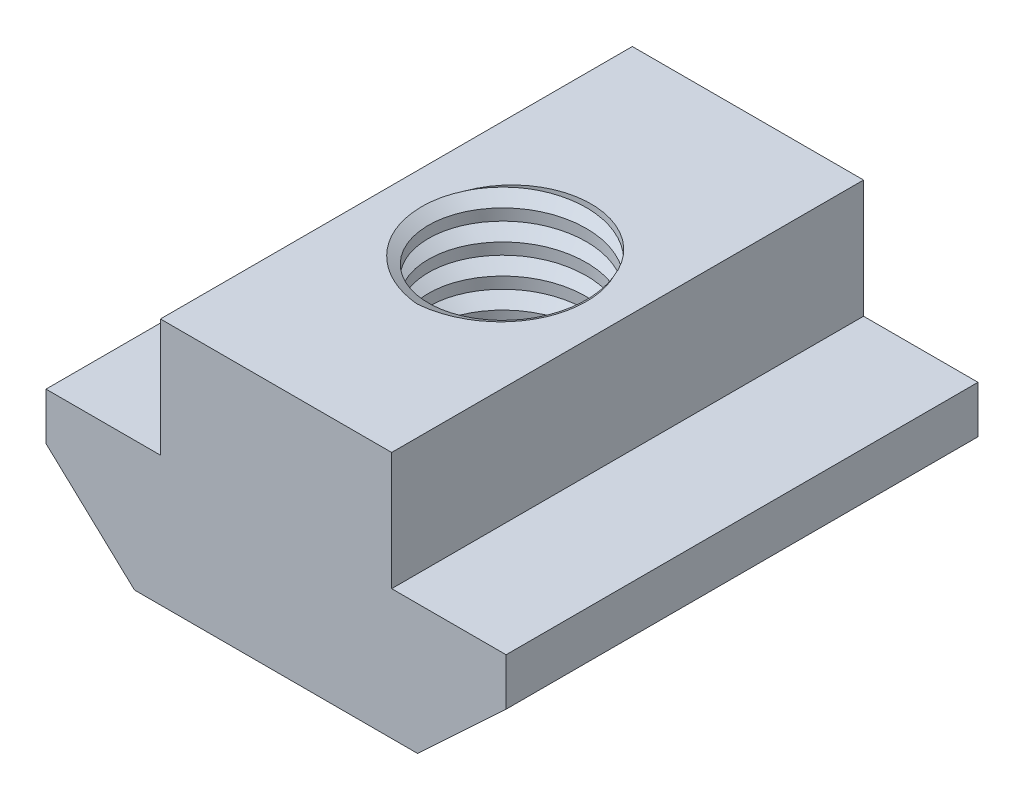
ISO-10303-21;
HEADER;
FILE_DESCRIPTION(('STEP AP214'),'2;1');
FILE_NAME('part.step','',(''),(''),'','','');
FILE_SCHEMA(('AUTOMOTIVE_DESIGN { 1 0 10303 214 1 1 1 1 }'));
ENDSEC;
DATA;
#1=APPLICATION_CONTEXT('core data for automotive mechanical design processes');
#2=APPLICATION_PROTOCOL_DEFINITION('international standard','automotive_design',2000,#1);
#3=PRODUCT_CONTEXT('',#1,'mechanical');
#4=PRODUCT('Part','Part','',(#3));
#5=PRODUCT_RELATED_PRODUCT_CATEGORY('part','',(#4));
#6=PRODUCT_DEFINITION_FORMATION('','',#4);
#7=PRODUCT_DEFINITION_CONTEXT('part definition',#1,'design');
#8=PRODUCT_DEFINITION('design','',#6,#7);
#9=PRODUCT_DEFINITION_SHAPE('','',#8);
#10=(LENGTH_UNIT() NAMED_UNIT(*) SI_UNIT(.MILLI.,.METRE.));
#11=(NAMED_UNIT(*) PLANE_ANGLE_UNIT() SI_UNIT($,.RADIAN.));
#12=(NAMED_UNIT(*) SI_UNIT($,.STERADIAN.) SOLID_ANGLE_UNIT());
#13=UNCERTAINTY_MEASURE_WITH_UNIT(LENGTH_MEASURE(1.E-05),#10,'distance_accuracy_value','');
#14=(GEOMETRIC_REPRESENTATION_CONTEXT(3) GLOBAL_UNCERTAINTY_ASSIGNED_CONTEXT((#13)) GLOBAL_UNIT_ASSIGNED_CONTEXT((#10,
#11,#12)) REPRESENTATION_CONTEXT('',''));
#15=CARTESIAN_POINT('',(0.,0.,0.));
#16=DIRECTION('',(0.,0.,1.));
#17=DIRECTION('',(1.,0.,0.));
#18=AXIS2_PLACEMENT_3D('',#15,#16,#17);
#19=CARTESIAN_POINT('',(6.,0.,10.));
#20=DIRECTION('',(0.,1.,0.));
#21=DIRECTION('',(0.,0.,1.));
#22=AXIS2_PLACEMENT_3D('',#19,#20,#21);
#23=PLANE('',#22);
#24=DIRECTION('',(1.,0.,0.));
#25=VECTOR('',#24,1.);
#26=CARTESIAN_POINT('',(6.,0.,-10.));
#27=LINE('',#26,#25);
#28=CARTESIAN_POINT('',(-6.,0.,-10.));
#29=VERTEX_POINT('',#28);
#30=CARTESIAN_POINT('',(6.,0.,-10.));
#31=VERTEX_POINT('',#30);
#32=EDGE_CURVE('E166',#29,#31,#27,.T.);
#33=ORIENTED_EDGE('',*,*,#32,.T.);
#34=DIRECTION('',(0.,0.,-1.));
#35=VECTOR('',#34,1.);
#36=CARTESIAN_POINT('',(6.,0.,10.));
#37=LINE('',#36,#35);
#38=CARTESIAN_POINT('',(6.,0.,10.));
#39=VERTEX_POINT('',#38);
#40=EDGE_CURVE('E183',#39,#31,#37,.T.);
#41=ORIENTED_EDGE('',*,*,#40,.F.);
#42=DIRECTION('',(1.,0.,0.));
#43=VECTOR('',#42,1.);
#44=CARTESIAN_POINT('',(6.,0.,10.));
#45=LINE('',#44,#43);
#46=CARTESIAN_POINT('',(-6.,0.,10.));
#47=VERTEX_POINT('',#46);
#48=EDGE_CURVE('E237',#47,#39,#45,.T.);
#49=ORIENTED_EDGE('',*,*,#48,.F.);
#50=DIRECTION('',(0.,0.,-1.));
#51=VECTOR('',#50,1.);
#52=CARTESIAN_POINT('',(-6.,0.,10.));
#53=LINE('',#52,#51);
#54=EDGE_CURVE('E186',#47,#29,#53,.T.);
#55=ORIENTED_EDGE('',*,*,#54,.T.);
#56=EDGE_LOOP('',(#33,#41,#49,#55));
#57=FACE_BOUND('',#56,.T.);
#58=CARTESIAN_POINT('',(-2.34526739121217,0.,-3.25489181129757));
#59=CARTESIAN_POINT('',(-2.25080720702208,0.,-3.31137412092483));
#60=CARTESIAN_POINT('',(-2.15395743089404,0.,-3.36385634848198));
#61=CARTESIAN_POINT('',(-1.95618327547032,0.,-3.46049327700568));
#62=CARTESIAN_POINT('',(-1.85525871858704,0.,-3.50464761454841));
#63=CARTESIAN_POINT('',(-1.64991503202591,0.,-3.58434800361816));
#64=CARTESIAN_POINT('',(-1.54549154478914,0.,-3.61988282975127));
#65=CARTESIAN_POINT('',(-1.33402230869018,0.,-3.6820180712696));
#66=CARTESIAN_POINT('',(-1.22697662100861,0.,-3.70861869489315));
#67=CARTESIAN_POINT('',(-1.01107676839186,0.,-3.75268227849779));
#68=CARTESIAN_POINT('',(-0.902223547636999,0.,-3.77014986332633));
#69=CARTESIAN_POINT('',(-0.683420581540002,0.,-3.79585438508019));
#70=CARTESIAN_POINT('',(-0.573470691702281,0.,-3.80409008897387));
#71=CARTESIAN_POINT('',(-0.353343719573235,0.,-3.81123815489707));
#72=CARTESIAN_POINT('',(-0.243166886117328,0.,-3.81015789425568));
#73=CARTESIAN_POINT('',(-0.078291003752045,0.,-3.80165033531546));
#74=CARTESIAN_POINT('',(-0.0233948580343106,0.,-3.79766629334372));
#75=CARTESIAN_POINT('',(0.0861663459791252,0.,-3.78726015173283));
#76=CARTESIAN_POINT('',(0.140831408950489,0.,-3.78083810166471));
#77=CARTESIAN_POINT('',(0.303487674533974,0.,-3.75797756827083));
#78=CARTESIAN_POINT('',(0.41099032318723,0.,-3.737902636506));
#79=CARTESIAN_POINT('',(0.62375648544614,0.,-3.68819803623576));
#80=CARTESIAN_POINT('',(0.729019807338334,0.,-3.65856755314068));
#81=CARTESIAN_POINT('',(0.936469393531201,0.,-3.58997334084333));
#82=CARTESIAN_POINT('',(1.03865553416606,0.,-3.55100923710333));
#83=CARTESIAN_POINT('',(1.23911372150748,0.,-3.46406105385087));
#84=CARTESIAN_POINT('',(1.33738585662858,0.,-3.41607717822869));
#85=CARTESIAN_POINT('',(1.52331447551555,0.,-3.31469700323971));
#86=CARTESIAN_POINT('',(1.61125208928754,0.,-3.26181538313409));
#87=CARTESIAN_POINT('',(1.78235066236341,0.,-3.14882621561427));
#88=CARTESIAN_POINT('',(1.86551186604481,0.,-3.08871903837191));
#89=CARTESIAN_POINT('',(2.02647717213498,0.,-2.96170554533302));
#90=CARTESIAN_POINT('',(2.10428101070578,0.,-2.89479889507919));
#91=CARTESIAN_POINT('',(2.25396406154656,0.,-2.7546524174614));
#92=CARTESIAN_POINT('',(2.32584277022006,0.,-2.68141205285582));
#93=CARTESIAN_POINT('',(2.46337691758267,0.,-2.52899287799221));
#94=CARTESIAN_POINT('',(2.5290183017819,0.,-2.44980134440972));
#95=CARTESIAN_POINT('',(2.65275917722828,0.,-2.28573237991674));
#96=CARTESIAN_POINT('',(2.71085982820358,0.,-2.20085582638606));
#97=CARTESIAN_POINT('',(2.81905336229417,0.,-2.02624357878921));
#98=CARTESIAN_POINT('',(2.86915256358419,0.,-1.93651179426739));
#99=CARTESIAN_POINT('',(2.96096580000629,0.,-1.75284126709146));
#100=CARTESIAN_POINT('',(3.00267906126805,0.,-1.65890213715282));
#101=CARTESIAN_POINT('',(3.07487355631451,0.,-1.47399573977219));
#102=CARTESIAN_POINT('',(3.10591818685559,0.,-1.3832478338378));
#103=CARTESIAN_POINT('',(3.16016605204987,0.,-1.19943855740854));
#104=CARTESIAN_POINT('',(3.18336953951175,0.,-1.10637726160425));
#105=CARTESIAN_POINT('',(3.22177728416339,0.,-0.918550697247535));
#106=CARTESIAN_POINT('',(3.2369758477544,0.,-0.823784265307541));
#107=CARTESIAN_POINT('',(3.25924818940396,0.,-0.633284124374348));
#108=CARTESIAN_POINT('',(3.26632070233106,0.,-0.537550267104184));
#109=CARTESIAN_POINT('',(3.27223106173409,0.,-0.346751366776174));
#110=CARTESIAN_POINT('',(3.27114698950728,0.,-0.251688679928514));
#111=CARTESIAN_POINT('',(3.26104667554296,0.,-0.0619880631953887));
#112=CARTESIAN_POINT('',(3.25203173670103,0.,0.0326499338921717));
#113=CARTESIAN_POINT('',(3.22535674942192,0.,0.220608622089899));
#114=CARTESIAN_POINT('',(3.20770616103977,0.,0.313930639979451));
#115=CARTESIAN_POINT('',(3.16394843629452,0.,0.498570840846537));
#116=CARTESIAN_POINT('',(3.13784101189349,0.,0.589888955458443));
#117=CARTESIAN_POINT('',(3.07884168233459,0.,0.765372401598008));
#118=CARTESIAN_POINT('',(3.04634146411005,0.,0.849669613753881));
#119=CARTESIAN_POINT('',(2.97411408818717,0.,1.0151081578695));
#120=CARTESIAN_POINT('',(2.93438705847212,0.,1.09624954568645));
#121=CARTESIAN_POINT('',(2.84797310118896,0.,1.25481478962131));
#122=CARTESIAN_POINT('',(2.80128111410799,0.,1.33223588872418));
#123=CARTESIAN_POINT('',(2.70130615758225,0.,1.48271286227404));
#124=CARTESIAN_POINT('',(2.6480222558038,0.,1.5557681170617));
#125=CARTESIAN_POINT('',(2.53121587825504,0.,1.70204059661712));
#126=CARTESIAN_POINT('',(2.46723226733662,0.,1.77489003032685));
#127=CARTESIAN_POINT('',(2.33270706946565,0.,1.91425984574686));
#128=CARTESIAN_POINT('',(2.26216614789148,0.,1.9807808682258));
#129=CARTESIAN_POINT('',(2.15194094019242,0.,2.07548181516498));
#130=CARTESIAN_POINT('',(2.11443083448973,0.,2.10622526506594));
#131=CARTESIAN_POINT('',(2.03789687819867,0.,2.16577059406));
#132=CARTESIAN_POINT('',(1.99887316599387,0.,2.19457264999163));
#133=CARTESIAN_POINT('',(1.91938013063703,0.,2.25014680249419));
#134=CARTESIAN_POINT('',(1.87891012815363,0.,2.2769179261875));
#135=CARTESIAN_POINT('',(1.79663859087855,0.,2.32835713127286));
#136=CARTESIAN_POINT('',(1.75483667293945,0.,2.35302459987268));
#137=CARTESIAN_POINT('',(1.71242885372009,0.,2.37660348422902));
#138=B_SPLINE_CURVE_WITH_KNOTS('',3,(#58,#59,#60,#61,#62,#63,#64,#65,#66,#67,#68,#69,#70,#71,
#72,#73,#74,#75,#76,#77,#78,#79,#80,#81,#82,#83,#84,#85,#86,#87,#88,#89,#90,#91,#92,#93,#94,#95,
#96,#97,#98,#99,#100,#101,#102,#103,#104,#105,#106,#107,#108,#109,#110,#111,#112,#113,#114,#115,
#116,#117,#118,#119,#120,#121,#122,#123,#124,#125,#126,#127,#128,#129,#130,#131,#132,#133,#134,
#135,#136,#137),.UNSPECIFIED.,.F.,.F.,(4,2,2,2,2,2,2,2,2,2,2,2,2,2,2,2,2,2,2,2,2,2,2,2,2,2,2,2,
2,2,2,2,2,2,2,2,2,2,2,4),(0.,0.33007677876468,0.66016795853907,0.990686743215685,
1.32119782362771,1.65154137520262,1.98192904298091,2.31205510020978,2.47713269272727,
2.64220692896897,2.96981060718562,3.2974422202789,3.62508698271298,3.95272433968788,
4.2602024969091,4.5676649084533,4.87514245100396,5.18264610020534,5.49082698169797,
5.79896041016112,6.10684931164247,6.41476661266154,6.70215678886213,6.98953769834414,
7.27712273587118,7.56475254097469,7.84963245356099,8.13446557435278,8.41898736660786,
8.70351885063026,8.97421305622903,9.244902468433,9.51578948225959,9.78671485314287,
10.07716605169,10.3675878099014,10.513038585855,10.6584760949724,10.8039828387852,
10.9495318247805),.UNSPECIFIED.);
#139=CARTESIAN_POINT('',(-2.34526739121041,-1.08653582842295E-13,-3.25489181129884));
#140=VERTEX_POINT('',#139);
#141=CARTESIAN_POINT('',(3.21844222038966,0.,-0.929585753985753));
#142=VERTEX_POINT('',#141);
#143=EDGE_CURVE('E219',#140,#142,#138,.T.);
#144=ORIENTED_EDGE('',*,*,#143,.F.);
#145=CARTESIAN_POINT('',(1.71242885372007,0.,2.37660348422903));
#146=CARTESIAN_POINT('',(1.65034441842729,0.,2.4334562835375));
#147=CARTESIAN_POINT('',(1.58584796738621,0.,2.48767269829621));
#148=CARTESIAN_POINT('',(1.45252524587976,0.,2.59047016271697));
#149=CARTESIAN_POINT('',(1.3836996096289,0.,2.63905203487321));
#150=CARTESIAN_POINT('',(1.24238922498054,0.,2.73010903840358));
#151=CARTESIAN_POINT('',(1.16991508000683,0.,2.7726006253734));
#152=CARTESIAN_POINT('',(1.02164649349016,0.,2.85134055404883));
#153=CARTESIAN_POINT('',(0.945851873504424,0.,2.887588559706));
#154=CARTESIAN_POINT('',(0.791384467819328,0.,2.95362912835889));
#155=CARTESIAN_POINT('',(0.712708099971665,0.,2.98341331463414));
#156=CARTESIAN_POINT('',(0.553138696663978,0.,3.03625134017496));
#157=CARTESIAN_POINT('',(0.472245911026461,0.,3.05930593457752));
#158=CARTESIAN_POINT('',(0.30878105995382,0.,3.09856437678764));
#159=CARTESIAN_POINT('',(0.226208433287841,0.,3.11476589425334));
#160=CARTESIAN_POINT('',(0.0599859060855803,0.,3.1401077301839));
#161=CARTESIAN_POINT('',(-0.0236641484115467,0.,3.14924702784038));
#162=CARTESIAN_POINT('',(-0.192069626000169,0.,3.16111239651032));
#163=CARTESIAN_POINT('',(-0.276828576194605,0.,3.1637877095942));
#164=CARTESIAN_POINT('',(-0.446279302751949,0.,3.16253284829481));
#165=CARTESIAN_POINT('',(-0.530971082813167,0.,3.15860306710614));
#166=CARTESIAN_POINT('',(-0.784237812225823,0.,3.13692719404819));
#167=CARTESIAN_POINT('',(-0.952060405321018,0.,3.10929849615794));
#168=CARTESIAN_POINT('',(-1.29496658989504,0.,3.02492098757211));
#169=CARTESIAN_POINT('',(-1.46951255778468,0.,2.96596454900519));
#170=CARTESIAN_POINT('',(-1.72186757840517,0.,2.85631449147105));
#171=CARTESIAN_POINT('',(-1.80443013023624,0.,2.81621453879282));
#172=CARTESIAN_POINT('',(-1.96589676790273,0.,2.72920849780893));
#173=CARTESIAN_POINT('',(-2.04480134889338,0.,2.68230333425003));
#174=CARTESIAN_POINT('',(-2.19831727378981,0.,2.58208980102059));
#175=CARTESIAN_POINT('',(-2.27293328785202,0.,2.52878859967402));
#176=CARTESIAN_POINT('',(-2.38126088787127,0.,2.44426346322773));
#177=CARTESIAN_POINT('',(-2.41677483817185,0.,2.41532234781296));
#178=CARTESIAN_POINT('',(-2.48665383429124,0.,2.35607351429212));
#179=CARTESIAN_POINT('',(-2.52101864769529,0.,2.32576552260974));
#180=CARTESIAN_POINT('',(-2.62234446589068,0.,2.23283937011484));
#181=CARTESIAN_POINT('',(-2.68751124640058,0.,2.16823908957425));
#182=CARTESIAN_POINT('',(-2.81262587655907,0.,2.03417676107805));
#183=CARTESIAN_POINT('',(-2.87257226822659,0.,1.96471336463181));
#184=CARTESIAN_POINT('',(-3.05024280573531,0.,1.74182617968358));
#185=CARTESIAN_POINT('',(-3.15842962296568,0.,1.58061568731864));
#186=CARTESIAN_POINT('',(-3.34688103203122,0.,1.24279441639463));
#187=CARTESIAN_POINT('',(-3.42716640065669,0.,1.06619522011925));
#188=CARTESIAN_POINT('',(-3.52606102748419,0.,0.790905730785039));
#189=CARTESIAN_POINT('',(-3.55568598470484,0.,0.696039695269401));
#190=CARTESIAN_POINT('',(-3.60686091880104,0.,0.504125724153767));
#191=CARTESIAN_POINT('',(-3.62841159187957,0.,0.407077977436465));
#192=CARTESIAN_POINT('',(-3.65457400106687,0.,0.260400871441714));
#193=CARTESIAN_POINT('',(-3.66226983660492,0.,0.211299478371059));
#194=CARTESIAN_POINT('',(-3.6755771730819,0.,0.112811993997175));
#195=CARTESIAN_POINT('',(-3.68118869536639,0.,0.0634259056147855));
#196=CARTESIAN_POINT('',(-3.69038101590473,0.,-0.0355393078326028));
#197=CARTESIAN_POINT('',(-3.6939615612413,0.,-0.0851184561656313));
#198=CARTESIAN_POINT('',(-3.69920451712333,0.,-0.18437574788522));
#199=CARTESIAN_POINT('',(-3.70086686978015,0.,-0.234053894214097));
#200=CARTESIAN_POINT('',(-3.70294835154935,0.,-0.384736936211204));
#201=CARTESIAN_POINT('',(-3.70031426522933,0.,-0.485805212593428));
#202=CARTESIAN_POINT('',(-3.68703232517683,0.,-0.687366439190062));
#203=CARTESIAN_POINT('',(-3.6763852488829,0.,-0.787859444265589));
#204=CARTESIAN_POINT('',(-3.63248758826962,0.,-1.08752525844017));
#205=CARTESIAN_POINT('',(-3.58728323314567,0.,-1.28508904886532));
#206=CARTESIAN_POINT('',(-3.46253476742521,0.,-1.68196332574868));
#207=CARTESIAN_POINT('',(-3.38110251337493,0.,-1.88067457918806));
#208=CARTESIAN_POINT('',(-3.18595937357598,0.,-2.26176205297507));
#209=CARTESIAN_POINT('',(-3.07224725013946,0.,-2.4441376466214));
#210=CARTESIAN_POINT('',(-2.90037270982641,0.,-2.67414922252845));
#211=CARTESIAN_POINT('',(-2.85484175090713,0.,-2.73153782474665));
#212=CARTESIAN_POINT('',(-2.78415834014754,0.,-2.81561134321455));
#213=CARTESIAN_POINT('',(-2.76020154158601,0.,-2.84329865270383));
#214=CARTESIAN_POINT('',(-2.71156143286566,0.,-2.89802800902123));
#215=CARTESIAN_POINT('',(-2.686878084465,0.,-2.92507002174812));
#216=CARTESIAN_POINT('',(-2.61184076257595,0.,-3.00508216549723));
#217=CARTESIAN_POINT('',(-2.56040762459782,0.,-3.05704761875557));
#218=CARTESIAN_POINT('',(-2.45483026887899,0.,-3.15813742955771));
#219=CARTESIAN_POINT('',(-2.40068630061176,0.,-3.20726204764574));
#220=CARTESIAN_POINT('',(-2.34526739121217,0.,-3.25489181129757));
#221=B_SPLINE_CURVE_WITH_KNOTS('',3,(#145,#146,#147,#148,#149,#150,#151,#152,#153,#154,#155,
#156,#157,#158,#159,#160,#161,#162,#163,#164,#165,#166,#167,#168,#169,#170,#171,#172,#173,#174,
#175,#176,#177,#178,#179,#180,#181,#182,#183,#184,#185,#186,#187,#188,#189,#190,#191,#192,#193,
#194,#195,#196,#197,#198,#199,#200,#201,#202,#203,#204,#205,#206,#207,#208,#209,#210,#211,#212,
#213,#214,#215,#216,#217,#218,#219,#220),.UNSPECIFIED.,.F.,.F.,(4,2,2,2,2,2,2,2,2,2,2,2,2,2,2,2,
2,2,2,2,2,2,2,2,2,2,2,2,2,2,2,2,2,2,2,2,2,4),(0.,0.252470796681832,0.50490469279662,
0.756643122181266,1.00839509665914,1.26047140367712,1.5125194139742,1.7646530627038,
2.01682314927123,2.27096703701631,2.52509579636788,3.0331860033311,3.58305440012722,
3.8581408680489,4.13318998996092,4.40793368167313,4.54533938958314,4.68277272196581,
4.95773669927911,5.23277722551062,5.81241989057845,6.39162999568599,6.68949258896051,
6.98732949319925,7.1363967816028,7.28546254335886,7.43454686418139,7.58363568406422,
7.88657661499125,8.18948815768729,8.794705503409,9.43603702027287,10.0773931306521,
10.2970785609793,10.4069023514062,10.5167319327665,10.7359634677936,10.9551748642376),.UNSPECIFIED.);
#222=CARTESIAN_POINT('',(-1.86049878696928,0.,2.78586508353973));
#223=VERTEX_POINT('',#222);
#224=EDGE_CURVE('E273',#223,#140,#221,.T.);
#225=ORIENTED_EDGE('',*,*,#224,.F.);
#226=CARTESIAN_POINT('',(0.,0.,0.));
#227=DIRECTION('',(0.,1.,0.));
#228=DIRECTION('',(0.,0.,1.));
#229=AXIS2_PLACEMENT_3D('',#226,#227,#228);
#230=CIRCLE('',#229,3.35);
#231=EDGE_CURVE('E160',#223,#142,#230,.T.);
#232=ORIENTED_EDGE('',*,*,#231,.T.);
#233=EDGE_LOOP('',(#144,#225,#232));
#234=FACE_BOUND('',#233,.T.);
#235=ADVANCED_FACE('F33',(#57,#234),#23,.F.);
#236=CARTESIAN_POINT('',(-4.9,10.5,10.));
#237=DIRECTION('',(0.,-1.,0.));
#238=DIRECTION('',(0.,0.,-1.));
#239=AXIS2_PLACEMENT_3D('',#236,#237,#238);
#240=PLANE('',#239);
#241=DIRECTION('',(-1.,0.,0.));
#242=VECTOR('',#241,1.);
#243=CARTESIAN_POINT('',(-4.9,10.5,-10.));
#244=LINE('',#243,#242);
#245=CARTESIAN_POINT('',(4.9,10.5,-10.));
#246=VERTEX_POINT('',#245);
#247=CARTESIAN_POINT('',(-4.9,10.5,-10.));
#248=VERTEX_POINT('',#247);
#249=EDGE_CURVE('E98',#246,#248,#244,.T.);
#250=ORIENTED_EDGE('',*,*,#249,.T.);
#251=DIRECTION('',(0.,0.,-1.));
#252=VECTOR('',#251,1.);
#253=CARTESIAN_POINT('',(-4.9,10.5,10.));
#254=LINE('',#253,#252);
#255=CARTESIAN_POINT('',(-4.9,10.5,10.));
#256=VERTEX_POINT('',#255);
#257=EDGE_CURVE('E152',#256,#248,#254,.T.);
#258=ORIENTED_EDGE('',*,*,#257,.F.);
#259=DIRECTION('',(-1.,0.,0.));
#260=VECTOR('',#259,1.);
#261=CARTESIAN_POINT('',(-4.9,10.5,10.));
#262=LINE('',#261,#260);
#263=CARTESIAN_POINT('',(4.9,10.5,10.));
#264=VERTEX_POINT('',#263);
#265=EDGE_CURVE('E59',#264,#256,#262,.T.);
#266=ORIENTED_EDGE('',*,*,#265,.F.);
#267=DIRECTION('',(0.,0.,-1.));
#268=VECTOR('',#267,1.);
#269=CARTESIAN_POINT('',(4.9,10.5,10.));
#270=LINE('',#269,#268);
#271=EDGE_CURVE('E148',#264,#246,#270,.T.);
#272=ORIENTED_EDGE('',*,*,#271,.T.);
#273=EDGE_LOOP('',(#250,#258,#266,#272));
#274=FACE_BOUND('',#273,.T.);
#275=CARTESIAN_POINT('',(-4.62602154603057E-09,10.5,-2.92927579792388));
#276=CARTESIAN_POINT('',(-0.0851299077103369,10.5,-2.93877948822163));
#277=CARTESIAN_POINT('',(-0.170661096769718,10.5,-2.94467688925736));
#278=CARTESIAN_POINT('',(-0.341915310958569,10.5,-2.94925325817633));
#279=CARTESIAN_POINT('',(-0.42763833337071,10.5,-2.94793232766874));
#280=CARTESIAN_POINT('',(-0.598634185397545,10.5,-2.93806839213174));
#281=CARTESIAN_POINT('',(-0.683907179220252,10.5,-2.92952823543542));
#282=CARTESIAN_POINT('',(-0.853426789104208,10.5,-2.9052922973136));
#283=CARTESIAN_POINT('',(-0.937673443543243,10.5,-2.88959678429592));
#284=CARTESIAN_POINT('',(-1.10457411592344,10.5,-2.85115479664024));
#285=CARTESIAN_POINT('',(-1.1872275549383,10.5,-2.82840580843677));
#286=CARTESIAN_POINT('',(-1.35032320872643,10.5,-2.77602311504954));
#287=CARTESIAN_POINT('',(-1.43076541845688,10.5,-2.74638939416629));
#288=CARTESIAN_POINT('',(-1.58881609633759,10.5,-2.68047390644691));
#289=CARTESIAN_POINT('',(-1.66642640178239,10.5,-2.64419654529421));
#290=CARTESIAN_POINT('',(-1.8183092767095,10.5,-2.56524734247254));
#291=CARTESIAN_POINT('',(-1.89258227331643,10.5,-2.52257632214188));
#292=CARTESIAN_POINT('',(-2.03721200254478,10.5,-2.431194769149));
#293=CARTESIAN_POINT('',(-2.10757270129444,10.5,-2.38249052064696));
#294=CARTESIAN_POINT('',(-2.24394901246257,10.5,-2.27933778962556));
#295=CARTESIAN_POINT('',(-2.30996397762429,10.5,-2.22488845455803));
#296=CARTESIAN_POINT('',(-2.43770384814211,10.5,-2.11105691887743));
#297=CARTESIAN_POINT('',(-2.49942451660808,10.5,-2.05166996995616));
#298=CARTESIAN_POINT('',(-2.61806600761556,10.5,-1.92830662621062));
#299=CARTESIAN_POINT('',(-2.67498701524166,10.5,-1.86433040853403));
#300=CARTESIAN_POINT('',(-2.84414607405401,10.5,-1.65867853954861));
#301=CARTESIAN_POINT('',(-2.94761172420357,10.5,-1.50961959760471));
#302=CARTESIAN_POINT('',(-3.12877947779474,10.5,-1.19675610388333));
#303=CARTESIAN_POINT('',(-3.20650209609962,10.5,-1.03296342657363));
#304=CARTESIAN_POINT('',(-3.30334913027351,10.5,-0.776898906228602));
#305=CARTESIAN_POINT('',(-3.33263460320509,10.5,-0.688346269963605));
#306=CARTESIAN_POINT('',(-3.38366514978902,10.5,-0.509068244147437));
#307=CARTESIAN_POINT('',(-3.40541093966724,10.5,-0.418343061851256));
#308=CARTESIAN_POINT('',(-3.43225822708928,10.5,-0.281120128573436));
#309=CARTESIAN_POINT('',(-3.44024800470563,10.5,-0.235166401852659));
#310=CARTESIAN_POINT('',(-3.45428792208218,10.5,-0.142962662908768));
#311=CARTESIAN_POINT('',(-3.46033818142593,10.5,-0.0967126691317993));
#312=CARTESIAN_POINT('',(-3.4704920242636,10.5,-0.00399774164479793));
#313=CARTESIAN_POINT('',(-3.47459546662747,10.5,0.0424672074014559));
#314=CARTESIAN_POINT('',(-3.48101346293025,10.5,0.135525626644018));
#315=CARTESIAN_POINT('',(-3.48332766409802,10.5,0.182119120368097));
#316=CARTESIAN_POINT('',(-3.48757669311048,10.5,0.323315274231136));
#317=CARTESIAN_POINT('',(-3.4866748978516,10.5,0.41802264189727));
#318=CARTESIAN_POINT('',(-3.47740101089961,10.5,0.607066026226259));
#319=CARTESIAN_POINT('',(-3.46902681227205,10.5,0.701401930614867));
#320=CARTESIAN_POINT('',(-3.43275146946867,10.5,0.982885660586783));
#321=CARTESIAN_POINT('',(-3.39370346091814,10.5,1.16871075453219));
#322=CARTESIAN_POINT('',(-3.2832107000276,10.5,1.54395145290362));
#323=CARTESIAN_POINT('',(-3.20979176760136,10.5,1.73278988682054));
#324=CARTESIAN_POINT('',(-3.07681297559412,10.5,2.00464920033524));
#325=CARTESIAN_POINT('',(-3.02864607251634,10.5,2.09341416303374));
#326=CARTESIAN_POINT('',(-2.92501370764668,10.5,2.2665730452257));
#327=CARTESIAN_POINT('',(-2.86955129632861,10.5,2.35096877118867));
#328=CARTESIAN_POINT('',(-2.78124777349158,10.5,2.47377890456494));
#329=CARTESIAN_POINT('',(-2.75097601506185,10.5,2.51406819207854));
#330=CARTESIAN_POINT('',(-2.68875072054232,10.5,2.59331957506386));
#331=CARTESIAN_POINT('',(-2.65679745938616,10.5,2.63228188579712));
#332=CARTESIAN_POINT('',(-2.5913683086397,10.5,2.70891559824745));
#333=CARTESIAN_POINT('',(-2.55789215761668,10.5,2.74658677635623));
#334=CARTESIAN_POINT('',(-2.48949743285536,10.5,2.82059585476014));
#335=CARTESIAN_POINT('',(-2.45457877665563,10.5,2.85693367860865));
#336=CARTESIAN_POINT('',(-2.3476885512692,10.5,2.96389118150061));
#337=CARTESIAN_POINT('',(-2.27360520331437,10.5,3.0324285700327));
#338=CARTESIAN_POINT('',(-2.12034119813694,10.5,3.16347151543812));
#339=CARTESIAN_POINT('',(-2.04116096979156,10.5,3.22597757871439));
#340=CARTESIAN_POINT('',(-1.78703169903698,10.5,3.41087242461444));
#341=CARTESIAN_POINT('',(-1.60384172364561,10.5,3.52222055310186));
#342=CARTESIAN_POINT('',(-1.22176598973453,10.5,3.71299404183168));
#343=CARTESIAN_POINT('',(-1.02289282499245,10.5,3.79244471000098));
#344=CARTESIAN_POINT('',(-0.68571360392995,10.5,3.89576484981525));
#345=CARTESIAN_POINT('',(-0.550312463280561,10.5,3.92935427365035));
#346=CARTESIAN_POINT('',(-0.276827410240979,10.5,3.9817284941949));
#347=CARTESIAN_POINT('',(-0.138746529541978,10.5,4.00052912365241));
#348=CARTESIAN_POINT('',(6.33569935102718E-09,10.5,4.01180755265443));
#349=B_SPLINE_CURVE_WITH_KNOTS('',3,(#275,#276,#277,#278,#279,#280,#281,#282,#283,#284,#285,
#286,#287,#288,#289,#290,#291,#292,#293,#294,#295,#296,#297,#298,#299,#300,#301,#302,#303,#304,
#305,#306,#307,#308,#309,#310,#311,#312,#313,#314,#315,#316,#317,#318,#319,#320,#321,#322,#323,
#324,#325,#326,#327,#328,#329,#330,#331,#332,#333,#334,#335,#336,#337,#338,#339,#340,#341,#342,
#343,#344,#345,#346,#347,#348),.UNSPECIFIED.,.F.,.F.,(4,2,2,2,2,2,2,2,2,2,2,2,2,2,2,2,2,2,2,2,2,
2,2,2,2,2,2,2,2,2,2,2,2,2,2,2,4),(0.,0.256898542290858,0.513793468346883,0.770587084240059,
1.02737106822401,1.28424666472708,1.54112284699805,1.79782929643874,2.05450279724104,
2.31091116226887,2.56735763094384,2.82405363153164,3.08073972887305,3.6224988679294,
4.16382522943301,4.44336205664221,4.72287232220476,4.8627691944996,5.00265743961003,
5.14255582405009,5.28248178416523,5.5662793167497,5.85015689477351,6.41731483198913,
7.02203198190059,7.32471811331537,7.62727808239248,7.77842549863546,7.929548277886,
8.08069709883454,8.23185457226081,8.53427308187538,8.83666617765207,9.47661052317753,
10.116046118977,10.533799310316,10.9511046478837),.UNSPECIFIED.);
#350=CARTESIAN_POINT('',(-3.14586016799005,10.5,-1.15154843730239));
#351=VERTEX_POINT('',#350);
#352=CARTESIAN_POINT('',(6.33569995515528E-09,10.5,4.01180755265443));
#353=VERTEX_POINT('',#352);
#354=EDGE_CURVE('E218',#351,#353,#349,.T.);
#355=ORIENTED_EDGE('',*,*,#354,.F.);
#356=CARTESIAN_POINT('',(0.,10.5,0.));
#357=DIRECTION('',(0.,1.,0.));
#358=DIRECTION('',(0.,0.,1.));
#359=AXIS2_PLACEMENT_3D('',#356,#357,#358);
#360=CIRCLE('',#359,3.35);
#361=CARTESIAN_POINT('',(3.14586016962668,10.5,-1.15154843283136));
#362=VERTEX_POINT('',#361);
#363=EDGE_CURVE('E208',#362,#351,#360,.T.);
#364=ORIENTED_EDGE('',*,*,#363,.F.);
#365=CARTESIAN_POINT('',(6.33569995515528E-09,10.5,4.01180755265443));
#366=CARTESIAN_POINT('',(0.108433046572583,10.5,4.00298971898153));
#367=CARTESIAN_POINT('',(0.216490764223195,10.5,3.9895764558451));
#368=CARTESIAN_POINT('',(0.431086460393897,10.5,3.95370090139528));
#369=CARTESIAN_POINT('',(0.537624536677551,10.5,3.93123919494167));
#370=CARTESIAN_POINT('',(0.748309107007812,10.5,3.87743727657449));
#371=CARTESIAN_POINT('',(0.852458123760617,10.5,3.84610694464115));
#372=CARTESIAN_POINT('',(1.05774559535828,10.5,3.77477961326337));
#373=CARTESIAN_POINT('',(1.15888403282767,10.5,3.73478256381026));
#374=CARTESIAN_POINT('',(1.35741662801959,10.5,3.64640740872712));
#375=CARTESIAN_POINT('',(1.45481121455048,10.5,3.59803026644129));
#376=CARTESIAN_POINT('',(1.64517384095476,10.5,3.49323539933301));
#377=CARTESIAN_POINT('',(1.73814188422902,10.5,3.4368176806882));
#378=CARTESIAN_POINT('',(1.91901637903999,10.5,3.31632190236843));
#379=CARTESIAN_POINT('',(2.00692123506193,10.5,3.25224144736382));
#380=CARTESIAN_POINT('',(2.17702442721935,10.5,3.11689257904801));
#381=CARTESIAN_POINT('',(2.25922209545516,10.5,3.04562332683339));
#382=CARTESIAN_POINT('',(2.4173466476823,10.5,2.89634272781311));
#383=CARTESIAN_POINT('',(2.49327022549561,10.5,2.81832787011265));
#384=CARTESIAN_POINT('',(2.602046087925,10.5,2.69677623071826));
#385=CARTESIAN_POINT('',(2.63745494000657,10.5,2.65550171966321));
#386=CARTESIAN_POINT('',(2.70638632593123,10.5,2.57140597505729));
#387=CARTESIAN_POINT('',(2.73990889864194,10.5,2.52858477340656));
#388=CARTESIAN_POINT('',(2.83745413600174,10.5,2.39797089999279));
#389=CARTESIAN_POINT('',(2.89852703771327,10.5,2.30794705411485));
#390=CARTESIAN_POINT('',(3.01226548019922,10.5,2.12274809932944));
#391=CARTESIAN_POINT('',(3.06493067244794,10.5,2.02757277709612));
#392=CARTESIAN_POINT('',(3.15919493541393,10.5,1.83732666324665));
#393=CARTESIAN_POINT('',(3.20119201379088,10.5,1.74245301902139));
#394=CARTESIAN_POINT('',(3.27682059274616,10.5,1.54942922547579));
#395=CARTESIAN_POINT('',(3.31045221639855,10.5,1.45127912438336));
#396=CARTESIAN_POINT('',(3.36912068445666,10.5,1.25235164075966));
#397=CARTESIAN_POINT('',(3.39415015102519,10.5,1.15157208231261));
#398=CARTESIAN_POINT('',(3.43538410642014,10.5,0.94822428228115));
#399=CARTESIAN_POINT('',(3.45158868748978,10.5,0.845656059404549));
#400=CARTESIAN_POINT('',(3.47474877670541,10.5,0.642203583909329));
#401=CARTESIAN_POINT('',(3.48193546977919,10.5,0.541345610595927));
#402=CARTESIAN_POINT('',(3.4877681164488,10.5,0.339381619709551));
#403=CARTESIAN_POINT('',(3.48641361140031,10.5,0.238275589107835));
#404=CARTESIAN_POINT('',(3.4752346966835,10.5,0.0366213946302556));
#405=CARTESIAN_POINT('',(3.46541882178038,10.5,-0.0639272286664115));
#406=CARTESIAN_POINT('',(3.43660979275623,10.5,-0.263696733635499));
#407=CARTESIAN_POINT('',(3.41761833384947,10.5,-0.362917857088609));
#408=CARTESIAN_POINT('',(3.3713513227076,10.5,-0.556533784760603));
#409=CARTESIAN_POINT('',(3.34431656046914,10.5,-0.650986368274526));
#410=CARTESIAN_POINT('',(3.28197813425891,10.5,-0.837139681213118));
#411=CARTESIAN_POINT('',(3.24667334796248,10.5,-0.928840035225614));
#412=CARTESIAN_POINT('',(3.16805216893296,10.5,-1.10880678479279));
#413=CARTESIAN_POINT('',(3.12473076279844,10.5,-1.1970709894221));
#414=CARTESIAN_POINT('',(3.03042773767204,10.5,-1.3694070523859));
#415=CARTESIAN_POINT('',(2.9794463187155,10.5,-1.45347902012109));
#416=CARTESIAN_POINT('',(2.8729396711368,10.5,-1.61270678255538));
#417=CARTESIAN_POINT('',(2.81776589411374,10.5,-1.68809802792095));
#418=CARTESIAN_POINT('',(2.70125221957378,10.5,-1.83397347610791));
#419=CARTESIAN_POINT('',(2.63991160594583,10.5,-1.90445710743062));
#420=CARTESIAN_POINT('',(2.51154073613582,10.5,-2.0399370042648));
#421=CARTESIAN_POINT('',(2.4445144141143,10.5,-2.10493700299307));
#422=CARTESIAN_POINT('',(2.3052749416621,10.5,-2.22911798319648));
#423=CARTESIAN_POINT('',(2.23306265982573,10.5,-2.28829993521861));
#424=CARTESIAN_POINT('',(2.08398852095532,10.5,-2.39940675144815));
#425=CARTESIAN_POINT('',(2.0071609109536,10.5,-2.45137741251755));
#426=CARTESIAN_POINT('',(1.84910037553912,10.5,-2.54812800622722));
#427=CARTESIAN_POINT('',(1.76786709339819,10.5,-2.59290735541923));
#428=CARTESIAN_POINT('',(1.60165323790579,10.5,-2.67488373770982));
#429=CARTESIAN_POINT('',(1.51667243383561,10.5,-2.7120803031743));
#430=CARTESIAN_POINT('',(1.34364296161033,10.5,-2.77858699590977));
#431=CARTESIAN_POINT('',(1.25559323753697,10.5,-2.8078943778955));
#432=CARTESIAN_POINT('',(1.08380029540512,10.5,-2.85648650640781));
#433=CARTESIAN_POINT('',(1.00022093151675,10.5,-2.87635268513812));
#434=CARTESIAN_POINT('',(0.831683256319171,10.5,-2.9089524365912));
#435=CARTESIAN_POINT('',(0.74672499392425,10.5,-2.92168626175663));
#436=CARTESIAN_POINT('',(0.576213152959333,10.5,-2.93991277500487));
#437=CARTESIAN_POINT('',(0.490661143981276,10.5,-2.94542019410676));
#438=CARTESIAN_POINT('',(0.319424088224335,10.5,-2.94920219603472));
#439=CARTESIAN_POINT('',(0.233739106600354,10.5,-2.94747960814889));
#440=CARTESIAN_POINT('',(0.0987603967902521,10.5,-2.93907213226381));
#441=CARTESIAN_POINT('',(0.0493091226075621,10.5,-2.9347774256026));
#442=CARTESIAN_POINT('',(-4.62597425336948E-09,10.5,-2.92927579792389));
#443=B_SPLINE_CURVE_WITH_KNOTS('',3,(#365,#366,#367,#368,#369,#370,#371,#372,#373,#374,#375,
#376,#377,#378,#379,#380,#381,#382,#383,#384,#385,#386,#387,#388,#389,#390,#391,#392,#393,#394,
#395,#396,#397,#398,#399,#400,#401,#402,#403,#404,#405,#406,#407,#408,#409,#410,#411,#412,#413,
#414,#415,#416,#417,#418,#419,#420,#421,#422,#423,#424,#425,#426,#427,#428,#429,#430,#431,#432,
#433,#434,#435,#436,#437,#438,#439,#440,#441,#442),.UNSPECIFIED.,.F.,.F.,(4,2,2,2,2,2,2,2,2,2,2,
2,2,2,2,2,2,2,2,2,2,2,2,2,2,2,2,2,2,2,2,2,2,2,2,2,2,2,4),(0.,0.326274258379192,
0.652527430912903,0.978418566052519,1.30431158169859,1.63016715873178,1.95602248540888,
2.28197994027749,2.60797547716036,2.93414171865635,3.09724286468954,3.26034064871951,
3.58621108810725,3.91209503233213,4.22296705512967,4.53383450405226,4.84496791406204,
5.15609807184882,5.4590772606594,5.76207271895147,6.0647629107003,6.36739720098,
6.66175398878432,6.95615074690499,7.25073223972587,7.54530604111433,7.82524885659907,
8.10522421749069,8.38500740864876,8.66474384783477,8.9426133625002,9.22050541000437,
9.49841459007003,9.77642035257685,10.0338417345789,10.2912540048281,10.5481407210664,
10.8049269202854,10.9537767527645),.UNSPECIFIED.);
#444=EDGE_CURVE('E50',#353,#362,#443,.T.);
#445=ORIENTED_EDGE('',*,*,#444,.F.);
#446=EDGE_LOOP('',(#355,#364,#445));
#447=FACE_BOUND('',#446,.T.);
#448=ADVANCED_FACE('F215',(#274,#447),#240,.F.);
#449=CARTESIAN_POINT('',(-4.9,5.5,10.));
#450=DIRECTION('',(1.,0.,0.));
#451=DIRECTION('',(0.,1.,0.));
#452=AXIS2_PLACEMENT_3D('',#449,#450,#451);
#453=PLANE('',#452);
#454=DIRECTION('',(0.,-1.,0.));
#455=VECTOR('',#454,1.);
#456=CARTESIAN_POINT('',(-4.9,5.5,-10.));
#457=LINE('',#456,#455);
#458=CARTESIAN_POINT('',(-4.9,5.5,-10.));
#459=VERTEX_POINT('',#458);
#460=EDGE_CURVE('E156',#248,#459,#457,.T.);
#461=ORIENTED_EDGE('',*,*,#460,.T.);
#462=DIRECTION('',(0.,0.,-1.));
#463=VECTOR('',#462,1.);
#464=CARTESIAN_POINT('',(-4.9,5.5,10.));
#465=LINE('',#464,#463);
#466=CARTESIAN_POINT('',(-4.9,5.5,10.));
#467=VERTEX_POINT('',#466);
#468=EDGE_CURVE('E195',#467,#459,#465,.T.);
#469=ORIENTED_EDGE('',*,*,#468,.F.);
#470=DIRECTION('',(0.,-1.,0.));
#471=VECTOR('',#470,1.);
#472=CARTESIAN_POINT('',(-4.9,5.5,10.));
#473=LINE('',#472,#471);
#474=EDGE_CURVE('E176',#256,#467,#473,.T.);
#475=ORIENTED_EDGE('',*,*,#474,.F.);
#476=ORIENTED_EDGE('',*,*,#257,.T.);
#477=EDGE_LOOP('',(#461,#469,#475,#476));
#478=FACE_BOUND('',#477,.T.);
#479=ADVANCED_FACE('F35',(#478),#453,.F.);
#480=CARTESIAN_POINT('',(-9.75,5.5,10.));
#481=DIRECTION('',(0.,-1.,0.));
#482=DIRECTION('',(1.,0.,0.));
#483=AXIS2_PLACEMENT_3D('',#480,#481,#482);
#484=PLANE('',#483);
#485=DIRECTION('',(-1.,0.,0.));
#486=VECTOR('',#485,1.);
#487=CARTESIAN_POINT('',(-9.75,5.5,-10.));
#488=LINE('',#487,#486);
#489=CARTESIAN_POINT('',(-9.75,5.5,-10.));
#490=VERTEX_POINT('',#489);
#491=EDGE_CURVE('E159',#459,#490,#488,.T.);
#492=ORIENTED_EDGE('',*,*,#491,.T.);
#493=DIRECTION('',(0.,0.,-1.));
#494=VECTOR('',#493,1.);
#495=CARTESIAN_POINT('',(-9.75,5.5,10.));
#496=LINE('',#495,#494);
#497=CARTESIAN_POINT('',(-9.75,5.5,10.));
#498=VERTEX_POINT('',#497);
#499=EDGE_CURVE('E192',#498,#490,#496,.T.);
#500=ORIENTED_EDGE('',*,*,#499,.F.);
#501=DIRECTION('',(-1.,0.,0.));
#502=VECTOR('',#501,1.);
#503=CARTESIAN_POINT('',(-9.75,5.5,10.));
#504=LINE('',#503,#502);
#505=EDGE_CURVE('E107',#467,#498,#504,.T.);
#506=ORIENTED_EDGE('',*,*,#505,.F.);
#507=ORIENTED_EDGE('',*,*,#468,.T.);
#508=EDGE_LOOP('',(#492,#500,#506,#507));
#509=FACE_BOUND('',#508,.T.);
#510=ADVANCED_FACE('F258',(#509),#484,.F.);
#511=CARTESIAN_POINT('',(-9.75,3.5,10.));
#512=DIRECTION('',(1.,0.,0.));
#513=DIRECTION('',(0.,1.,0.));
#514=AXIS2_PLACEMENT_3D('',#511,#512,#513);
#515=PLANE('',#514);
#516=DIRECTION('',(0.,-1.,0.));
#517=VECTOR('',#516,1.);
#518=CARTESIAN_POINT('',(-9.75,3.5,-10.));
#519=LINE('',#518,#517);
#520=CARTESIAN_POINT('',(-9.75,3.5,-10.));
#521=VERTEX_POINT('',#520);
#522=EDGE_CURVE('E162',#490,#521,#519,.T.);
#523=ORIENTED_EDGE('',*,*,#522,.T.);
#524=DIRECTION('',(0.,0.,-1.));
#525=VECTOR('',#524,1.);
#526=CARTESIAN_POINT('',(-9.75,3.5,10.));
#527=LINE('',#526,#525);
#528=CARTESIAN_POINT('',(-9.75,3.5,10.));
#529=VERTEX_POINT('',#528);
#530=EDGE_CURVE('E189',#529,#521,#527,.T.);
#531=ORIENTED_EDGE('',*,*,#530,.F.);
#532=DIRECTION('',(0.,-1.,0.));
#533=VECTOR('',#532,1.);
#534=CARTESIAN_POINT('',(-9.75,3.5,10.));
#535=LINE('',#534,#533);
#536=EDGE_CURVE('E233',#498,#529,#535,.T.);
#537=ORIENTED_EDGE('',*,*,#536,.F.);
#538=ORIENTED_EDGE('',*,*,#499,.T.);
#539=EDGE_LOOP('',(#523,#531,#537,#538));
#540=FACE_BOUND('',#539,.T.);
#541=ADVANCED_FACE('F261',(#540),#515,.F.);
#542=CARTESIAN_POINT('',(-6.,0.,10.));
#543=DIRECTION('',(0.682318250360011,0.731055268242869,0.));
#544=DIRECTION('',(-0.731055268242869,0.682318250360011,0.));
#545=AXIS2_PLACEMENT_3D('',#542,#543,#544);
#546=PLANE('',#545);
#547=DIRECTION('',(0.731055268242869,-0.682318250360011,0.));
#548=VECTOR('',#547,1.);
#549=CARTESIAN_POINT('',(-6.,0.,-10.));
#550=LINE('',#549,#548);
#551=EDGE_CURVE('E164',#521,#29,#550,.T.);
#552=ORIENTED_EDGE('',*,*,#551,.T.);
#553=ORIENTED_EDGE('',*,*,#54,.F.);
#554=DIRECTION('',(0.731055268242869,-0.682318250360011,0.));
#555=VECTOR('',#554,1.);
#556=CARTESIAN_POINT('',(-6.,0.,10.));
#557=LINE('',#556,#555);
#558=EDGE_CURVE('E235',#529,#47,#557,.T.);
#559=ORIENTED_EDGE('',*,*,#558,.F.);
#560=ORIENTED_EDGE('',*,*,#530,.T.);
#561=EDGE_LOOP('',(#552,#553,#559,#560));
#562=FACE_BOUND('',#561,.T.);
#563=ADVANCED_FACE('F266',(#562),#546,.F.);
#564=CARTESIAN_POINT('',(9.75,3.5,10.));
#565=DIRECTION('',(-0.682318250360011,0.731055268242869,0.));
#566=DIRECTION('',(-0.731055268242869,-0.682318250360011,0.));
#567=AXIS2_PLACEMENT_3D('',#564,#565,#566);
#568=PLANE('',#567);
#569=DIRECTION('',(0.731055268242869,0.682318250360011,0.));
#570=VECTOR('',#569,1.);
#571=CARTESIAN_POINT('',(9.75,3.5,-10.));
#572=LINE('',#571,#570);
#573=CARTESIAN_POINT('',(9.75,3.5,-10.));
#574=VERTEX_POINT('',#573);
#575=EDGE_CURVE('E168',#31,#574,#572,.T.);
#576=ORIENTED_EDGE('',*,*,#575,.T.);
#577=DIRECTION('',(0.,0.,-1.));
#578=VECTOR('',#577,1.);
#579=CARTESIAN_POINT('',(9.75,3.5,10.));
#580=LINE('',#579,#578);
#581=CARTESIAN_POINT('',(9.75,3.5,10.));
#582=VERTEX_POINT('',#581);
#583=EDGE_CURVE('E180',#582,#574,#580,.T.);
#584=ORIENTED_EDGE('',*,*,#583,.F.);
#585=DIRECTION('',(0.731055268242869,0.682318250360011,0.));
#586=VECTOR('',#585,1.);
#587=CARTESIAN_POINT('',(9.75,3.5,10.));
#588=LINE('',#587,#586);
#589=EDGE_CURVE('E239',#39,#582,#588,.T.);
#590=ORIENTED_EDGE('',*,*,#589,.F.);
#591=ORIENTED_EDGE('',*,*,#40,.T.);
#592=EDGE_LOOP('',(#576,#584,#590,#591));
#593=FACE_BOUND('',#592,.T.);
#594=ADVANCED_FACE('F245',(#593),#568,.F.);
#595=CARTESIAN_POINT('',(9.75,5.5,10.));
#596=DIRECTION('',(-1.,0.,0.));
#597=DIRECTION('',(0.,-1.,0.));
#598=AXIS2_PLACEMENT_3D('',#595,#596,#597);
#599=PLANE('',#598);
#600=DIRECTION('',(0.,1.,0.));
#601=VECTOR('',#600,1.);
#602=CARTESIAN_POINT('',(9.75,5.5,-10.));
#603=LINE('',#602,#601);
#604=CARTESIAN_POINT('',(9.75,5.5,-10.));
#605=VERTEX_POINT('',#604);
#606=EDGE_CURVE('E170',#574,#605,#603,.T.);
#607=ORIENTED_EDGE('',*,*,#606,.T.);
#608=DIRECTION('',(0.,0.,-1.));
#609=VECTOR('',#608,1.);
#610=CARTESIAN_POINT('',(9.75,5.5,10.));
#611=LINE('',#610,#609);
#612=CARTESIAN_POINT('',(9.75,5.5,10.));
#613=VERTEX_POINT('',#612);
#614=EDGE_CURVE('E147',#613,#605,#611,.T.);
#615=ORIENTED_EDGE('',*,*,#614,.F.);
#616=DIRECTION('',(0.,1.,0.));
#617=VECTOR('',#616,1.);
#618=CARTESIAN_POINT('',(9.75,5.5,10.));
#619=LINE('',#618,#617);
#620=EDGE_CURVE('E135',#582,#613,#619,.T.);
#621=ORIENTED_EDGE('',*,*,#620,.F.);
#622=ORIENTED_EDGE('',*,*,#583,.T.);
#623=EDGE_LOOP('',(#607,#615,#621,#622));
#624=FACE_BOUND('',#623,.T.);
#625=ADVANCED_FACE('F249',(#624),#599,.F.);
#626=CARTESIAN_POINT('',(4.9,5.5,10.));
#627=DIRECTION('',(0.,-1.,0.));
#628=DIRECTION('',(1.,0.,0.));
#629=AXIS2_PLACEMENT_3D('',#626,#627,#628);
#630=PLANE('',#629);
#631=DIRECTION('',(-1.,0.,0.));
#632=VECTOR('',#631,1.);
#633=CARTESIAN_POINT('',(4.9,5.5,-10.));
#634=LINE('',#633,#632);
#635=CARTESIAN_POINT('',(4.9,5.5,-10.));
#636=VERTEX_POINT('',#635);
#637=EDGE_CURVE('E144',#605,#636,#634,.T.);
#638=ORIENTED_EDGE('',*,*,#637,.T.);
#639=DIRECTION('',(0.,0.,-1.));
#640=VECTOR('',#639,1.);
#641=CARTESIAN_POINT('',(4.9,5.5,10.));
#642=LINE('',#641,#640);
#643=CARTESIAN_POINT('',(4.9,5.5,10.));
#644=VERTEX_POINT('',#643);
#645=EDGE_CURVE('E141',#644,#636,#642,.T.);
#646=ORIENTED_EDGE('',*,*,#645,.F.);
#647=DIRECTION('',(-1.,0.,0.));
#648=VECTOR('',#647,1.);
#649=CARTESIAN_POINT('',(4.9,5.5,10.));
#650=LINE('',#649,#648);
#651=EDGE_CURVE('E128',#613,#644,#650,.T.);
#652=ORIENTED_EDGE('',*,*,#651,.F.);
#653=ORIENTED_EDGE('',*,*,#614,.T.);
#654=EDGE_LOOP('',(#638,#646,#652,#653));
#655=FACE_BOUND('',#654,.T.);
#656=ADVANCED_FACE('F142',(#655),#630,.F.);
#657=CARTESIAN_POINT('',(4.9,10.5,10.));
#658=DIRECTION('',(-1.,0.,0.));
#659=DIRECTION('',(0.,-1.,0.));
#660=AXIS2_PLACEMENT_3D('',#657,#658,#659);
#661=PLANE('',#660);
#662=DIRECTION('',(0.,1.,0.));
#663=VECTOR('',#662,1.);
#664=CARTESIAN_POINT('',(4.9,10.5,-10.));
#665=LINE('',#664,#663);
#666=EDGE_CURVE('E173',#636,#246,#665,.T.);
#667=ORIENTED_EDGE('',*,*,#666,.T.);
#668=ORIENTED_EDGE('',*,*,#271,.F.);
#669=DIRECTION('',(0.,1.,0.));
#670=VECTOR('',#669,1.);
#671=CARTESIAN_POINT('',(4.9,10.5,10.));
#672=LINE('',#671,#670);
#673=EDGE_CURVE('E132',#644,#264,#672,.T.);
#674=ORIENTED_EDGE('',*,*,#673,.F.);
#675=ORIENTED_EDGE('',*,*,#645,.T.);
#676=EDGE_LOOP('',(#667,#668,#674,#675));
#677=FACE_BOUND('',#676,.T.);
#678=ADVANCED_FACE('F150',(#677),#661,.F.);
#679=CARTESIAN_POINT('',(0.,0.,10.));
#680=DIRECTION('',(0.,0.,-1.));
#681=DIRECTION('',(-1.,0.,0.));
#682=AXIS2_PLACEMENT_3D('',#679,#680,#681);
#683=PLANE('',#682);
#684=ORIENTED_EDGE('',*,*,#474,.T.);
#685=ORIENTED_EDGE('',*,*,#505,.T.);
#686=ORIENTED_EDGE('',*,*,#536,.T.);
#687=ORIENTED_EDGE('',*,*,#558,.T.);
#688=ORIENTED_EDGE('',*,*,#48,.T.);
#689=ORIENTED_EDGE('',*,*,#589,.T.);
#690=ORIENTED_EDGE('',*,*,#620,.T.);
#691=ORIENTED_EDGE('',*,*,#651,.T.);
#692=ORIENTED_EDGE('',*,*,#673,.T.);
#693=ORIENTED_EDGE('',*,*,#265,.T.);
#694=EDGE_LOOP('',(#684,#685,#686,#687,#688,#689,#690,#691,#692,#693));
#695=FACE_BOUND('',#694,.T.);
#696=ADVANCED_FACE('F130',(#695),#683,.F.);
#697=CARTESIAN_POINT('',(0.,0.,-10.));
#698=DIRECTION('',(0.,0.,-1.));
#699=DIRECTION('',(-1.,0.,0.));
#700=AXIS2_PLACEMENT_3D('',#697,#698,#699);
#701=PLANE('',#700);
#702=ORIENTED_EDGE('',*,*,#460,.F.);
#703=ORIENTED_EDGE('',*,*,#249,.F.);
#704=ORIENTED_EDGE('',*,*,#666,.F.);
#705=ORIENTED_EDGE('',*,*,#637,.F.);
#706=ORIENTED_EDGE('',*,*,#606,.F.);
#707=ORIENTED_EDGE('',*,*,#575,.F.);
#708=ORIENTED_EDGE('',*,*,#32,.F.);
#709=ORIENTED_EDGE('',*,*,#551,.F.);
#710=ORIENTED_EDGE('',*,*,#522,.F.);
#711=ORIENTED_EDGE('',*,*,#491,.F.);
#712=EDGE_LOOP('',(#702,#703,#704,#705,#706,#707,#708,#709,#710,#711));
#713=FACE_BOUND('',#712,.T.);
#714=ADVANCED_FACE('F252',(#713),#701,.T.);
#715=CARTESIAN_POINT('',(0.,-9.5,0.));
#716=DIRECTION('',(0.,1.,0.));
#717=DIRECTION('',(0.,0.,1.));
#718=AXIS2_PLACEMENT_3D('',#715,#716,#717);
#719=CYLINDRICAL_SURFACE('',#718,3.35);
#720=ORIENTED_EDGE('',*,*,#363,.T.);
#721=CARTESIAN_POINT('',(-2.3688076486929,11.6633447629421,-2.36880778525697));
#722=CARTESIAN_POINT('',(-1.38761533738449,11.5852197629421,-3.35000003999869));
#723=CARTESIAN_POINT('',(9.65653780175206E-08,11.5070947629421,-3.35));
#724=CARTESIAN_POINT('',(1.38761553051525,11.4289697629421,-3.34999996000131));
#725=CARTESIAN_POINT('',(2.36880778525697,11.3508447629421,-2.3688076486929));
#726=CARTESIAN_POINT('',(3.35000003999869,11.2727197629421,-1.38761533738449));
#727=CARTESIAN_POINT('',(3.35,11.1945947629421,9.65653780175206E-08));
#728=CARTESIAN_POINT('',(3.34999996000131,11.1164697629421,1.38761553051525));
#729=CARTESIAN_POINT('',(2.3688076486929,11.0383447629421,2.36880778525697));
#730=CARTESIAN_POINT('',(1.38761533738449,10.9602197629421,3.35000003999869));
#731=CARTESIAN_POINT('',(-9.65653778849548E-08,10.8820947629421,3.35));
#732=CARTESIAN_POINT('',(-1.38761553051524,10.8039697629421,3.34999996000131));
#733=CARTESIAN_POINT('',(-2.36880778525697,10.7258447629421,2.3688076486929));
#734=CARTESIAN_POINT('',(-3.35000003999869,10.6477197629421,1.38761533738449));
#735=CARTESIAN_POINT('',(-3.35,10.5695947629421,-9.65653775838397E-08));
#736=CARTESIAN_POINT('',(-3.34999996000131,10.4914697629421,-1.38761553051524));
#737=CARTESIAN_POINT('',(-2.3688076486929,10.4133447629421,-2.36880778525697));
#738=CARTESIAN_POINT('',(-1.38761533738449,10.3352197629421,-3.35000003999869));
#739=CARTESIAN_POINT('',(9.65653780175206E-08,10.2570947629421,-3.35));
#740=CARTESIAN_POINT('',(1.38761553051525,10.1789697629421,-3.34999996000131));
#741=CARTESIAN_POINT('',(2.36880778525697,10.1008447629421,-2.3688076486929));
#742=CARTESIAN_POINT('',(3.35000003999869,10.0227197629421,-1.38761533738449));
#743=CARTESIAN_POINT('',(3.35,9.94459476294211,9.65653780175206E-08));
#744=CARTESIAN_POINT('',(3.34999996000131,9.86646976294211,1.38761553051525));
#745=CARTESIAN_POINT('',(2.3688076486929,9.78834476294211,2.36880778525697));
#746=CARTESIAN_POINT('',(1.38761533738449,9.71021976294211,3.35000003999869));
#747=CARTESIAN_POINT('',(-9.65653778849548E-08,9.63209476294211,3.35));
#748=CARTESIAN_POINT('',(-1.38761553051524,9.55396976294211,3.34999996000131));
#749=CARTESIAN_POINT('',(-2.36880778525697,9.47584476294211,2.3688076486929));
#750=CARTESIAN_POINT('',(-3.35000003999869,9.39771976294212,1.38761533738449));
#751=CARTESIAN_POINT('',(-3.35,9.31959476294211,-9.65653775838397E-08));
#752=CARTESIAN_POINT('',(-3.34999996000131,9.24146976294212,-1.38761553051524));
#753=CARTESIAN_POINT('',(-2.3688076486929,9.16334476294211,-2.36880778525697));
#754=CARTESIAN_POINT('',(-1.38761533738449,9.08521976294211,-3.35000003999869));
#755=CARTESIAN_POINT('',(9.65653780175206E-08,9.00709476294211,-3.35));
#756=CARTESIAN_POINT('',(1.38761553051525,8.92896976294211,-3.34999996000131));
#757=CARTESIAN_POINT('',(2.36880778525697,8.85084476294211,-2.3688076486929));
#758=CARTESIAN_POINT('',(3.35000003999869,8.77271976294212,-1.38761533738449));
#759=CARTESIAN_POINT('',(3.35,8.69459476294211,9.65653780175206E-08));
#760=CARTESIAN_POINT('',(3.34999996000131,8.61646976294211,1.38761553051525));
#761=CARTESIAN_POINT('',(2.3688076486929,8.53834476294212,2.36880778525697));
#762=CARTESIAN_POINT('',(1.38761533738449,8.46021976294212,3.35000003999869));
#763=CARTESIAN_POINT('',(-9.65653778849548E-08,8.38209476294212,3.35));
#764=CARTESIAN_POINT('',(-1.38761553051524,8.30396976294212,3.34999996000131));
#765=CARTESIAN_POINT('',(-2.36880778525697,8.22584476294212,2.3688076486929));
#766=CARTESIAN_POINT('',(-3.35000003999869,8.14771976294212,1.38761533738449));
#767=CARTESIAN_POINT('',(-3.35,8.06959476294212,-9.65653775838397E-08));
#768=CARTESIAN_POINT('',(-3.34999996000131,7.99146976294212,-1.38761553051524));
#769=CARTESIAN_POINT('',(-2.3688076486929,7.91334476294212,-2.36880778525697));
#770=CARTESIAN_POINT('',(-1.38761533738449,7.83521976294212,-3.35000003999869));
#771=CARTESIAN_POINT('',(9.65653780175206E-08,7.75709476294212,-3.35));
#772=CARTESIAN_POINT('',(1.38761553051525,7.67896976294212,-3.34999996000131));
#773=CARTESIAN_POINT('',(2.36880778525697,7.60084476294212,-2.3688076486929));
#774=CARTESIAN_POINT('',(3.35000003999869,7.52271976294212,-1.38761533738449));
#775=CARTESIAN_POINT('',(3.35,7.44459476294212,9.65653780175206E-08));
#776=CARTESIAN_POINT('',(3.34999996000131,7.36646976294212,1.38761553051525));
#777=CARTESIAN_POINT('',(2.3688076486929,7.28834476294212,2.36880778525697));
#778=CARTESIAN_POINT('',(1.38761533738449,7.21021976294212,3.35000003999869));
#779=CARTESIAN_POINT('',(-9.65653778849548E-08,7.13209476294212,3.35));
#780=CARTESIAN_POINT('',(-1.38761553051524,7.05396976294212,3.34999996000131));
#781=CARTESIAN_POINT('',(-2.36880778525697,6.97584476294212,2.3688076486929));
#782=CARTESIAN_POINT('',(-3.35000003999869,6.89771976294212,1.38761533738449));
#783=CARTESIAN_POINT('',(-3.35,6.81959476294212,-9.65653775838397E-08));
#784=CARTESIAN_POINT('',(-3.34999996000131,6.74146976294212,-1.38761553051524));
#785=CARTESIAN_POINT('',(-2.3688076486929,6.66334476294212,-2.36880778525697));
#786=CARTESIAN_POINT('',(-1.38761533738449,6.58521976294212,-3.35000003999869));
#787=CARTESIAN_POINT('',(9.65653780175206E-08,6.50709476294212,-3.35));
#788=CARTESIAN_POINT('',(1.38761553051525,6.42896976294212,-3.34999996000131));
#789=CARTESIAN_POINT('',(2.36880778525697,6.35084476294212,-2.3688076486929));
#790=CARTESIAN_POINT('',(3.35000003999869,6.27271976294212,-1.38761533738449));
#791=CARTESIAN_POINT('',(3.35,6.19459476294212,9.65653780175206E-08));
#792=CARTESIAN_POINT('',(3.34999996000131,6.11646976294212,1.38761553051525));
#793=CARTESIAN_POINT('',(2.3688076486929,6.03834476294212,2.36880778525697));
#794=CARTESIAN_POINT('',(1.38761533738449,5.96021976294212,3.35000003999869));
#795=CARTESIAN_POINT('',(-9.65653778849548E-08,5.88209476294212,3.35));
#796=CARTESIAN_POINT('',(-1.38761553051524,5.80396976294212,3.34999996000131));
#797=CARTESIAN_POINT('',(-2.36880778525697,5.72584476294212,2.3688076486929));
#798=CARTESIAN_POINT('',(-3.35000003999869,5.64771976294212,1.38761533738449));
#799=CARTESIAN_POINT('',(-3.35,5.56959476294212,-9.65653775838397E-08));
#800=CARTESIAN_POINT('',(-3.34999996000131,5.49146976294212,-1.38761553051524));
#801=CARTESIAN_POINT('',(-2.3688076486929,5.41334476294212,-2.36880778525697));
#802=CARTESIAN_POINT('',(-1.38761533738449,5.33521976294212,-3.35000003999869));
#803=CARTESIAN_POINT('',(9.65653780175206E-08,5.25709476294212,-3.35));
#804=CARTESIAN_POINT('',(1.38761553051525,5.17896976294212,-3.34999996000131));
#805=CARTESIAN_POINT('',(2.36880778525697,5.10084476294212,-2.3688076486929));
#806=CARTESIAN_POINT('',(3.35000003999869,5.02271976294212,-1.38761533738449));
#807=CARTESIAN_POINT('',(3.35,4.94459476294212,9.65653780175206E-08));
#808=CARTESIAN_POINT('',(3.34999996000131,4.86646976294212,1.38761553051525));
#809=CARTESIAN_POINT('',(2.3688076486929,4.78834476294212,2.36880778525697));
#810=CARTESIAN_POINT('',(1.38761533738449,4.71021976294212,3.35000003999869));
#811=CARTESIAN_POINT('',(-9.65653778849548E-08,4.63209476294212,3.35));
#812=CARTESIAN_POINT('',(-1.38761553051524,4.55396976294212,3.34999996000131));
#813=CARTESIAN_POINT('',(-2.36880778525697,4.47584476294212,2.3688076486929));
#814=CARTESIAN_POINT('',(-3.35000003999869,4.39771976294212,1.38761533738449));
#815=CARTESIAN_POINT('',(-3.35,4.31959476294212,-9.65653775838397E-08));
#816=CARTESIAN_POINT('',(-3.34999996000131,4.24146976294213,-1.38761553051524));
#817=CARTESIAN_POINT('',(-2.3688076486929,4.16334476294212,-2.36880778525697));
#818=CARTESIAN_POINT('',(-1.38761533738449,4.08521976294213,-3.35000003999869));
#819=CARTESIAN_POINT('',(9.65653780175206E-08,4.00709476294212,-3.35));
#820=CARTESIAN_POINT('',(1.38761553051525,3.92896976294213,-3.34999996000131));
#821=CARTESIAN_POINT('',(2.36880778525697,3.85084476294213,-2.3688076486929));
#822=CARTESIAN_POINT('',(3.35000003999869,3.77271976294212,-1.38761533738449));
#823=CARTESIAN_POINT('',(3.35,3.69459476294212,9.65653780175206E-08));
#824=CARTESIAN_POINT('',(3.34999996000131,3.61646976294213,1.38761553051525));
#825=CARTESIAN_POINT('',(2.3688076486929,3.53834476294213,2.36880778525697));
#826=CARTESIAN_POINT('',(1.38761533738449,3.46021976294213,3.35000003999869));
#827=CARTESIAN_POINT('',(-9.65653778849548E-08,3.38209476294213,3.35));
#828=CARTESIAN_POINT('',(-1.38761553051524,3.30396976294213,3.34999996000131));
#829=CARTESIAN_POINT('',(-2.36880778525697,3.22584476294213,2.3688076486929));
#830=CARTESIAN_POINT('',(-3.35000003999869,3.14771976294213,1.38761533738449));
#831=CARTESIAN_POINT('',(-3.35,3.06959476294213,-9.65653775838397E-08));
#832=CARTESIAN_POINT('',(-3.34999996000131,2.99146976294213,-1.38761553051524));
#833=CARTESIAN_POINT('',(-2.3688076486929,2.91334476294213,-2.36880778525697));
#834=CARTESIAN_POINT('',(-1.38761533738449,2.83521976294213,-3.35000003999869));
#835=CARTESIAN_POINT('',(9.65653780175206E-08,2.75709476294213,-3.35));
#836=CARTESIAN_POINT('',(1.38761553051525,2.67896976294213,-3.34999996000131));
#837=CARTESIAN_POINT('',(2.36880778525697,2.60084476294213,-2.3688076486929));
#838=CARTESIAN_POINT('',(3.35000003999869,2.52271976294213,-1.38761533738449));
#839=CARTESIAN_POINT('',(3.35,2.44459476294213,9.65653780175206E-08));
#840=CARTESIAN_POINT('',(3.34999996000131,2.36646976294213,1.38761553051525));
#841=CARTESIAN_POINT('',(2.3688076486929,2.28834476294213,2.36880778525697));
#842=CARTESIAN_POINT('',(1.38761533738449,2.21021976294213,3.35000003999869));
#843=CARTESIAN_POINT('',(-9.65653778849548E-08,2.13209476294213,3.35));
#844=CARTESIAN_POINT('',(-1.38761553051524,2.05396976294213,3.34999996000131));
#845=CARTESIAN_POINT('',(-2.36880778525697,1.97584476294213,2.3688076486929));
#846=CARTESIAN_POINT('',(-3.35000003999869,1.89771976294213,1.38761533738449));
#847=CARTESIAN_POINT('',(-3.35,1.81959476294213,-9.65653775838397E-08));
#848=CARTESIAN_POINT('',(-3.34999996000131,1.74146976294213,-1.38761553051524));
#849=CARTESIAN_POINT('',(-2.3688076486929,1.66334476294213,-2.36880778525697));
#850=CARTESIAN_POINT('',(-1.38761533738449,1.58521976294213,-3.35000003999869));
#851=CARTESIAN_POINT('',(9.65653780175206E-08,1.50709476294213,-3.35));
#852=CARTESIAN_POINT('',(1.38761553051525,1.42896976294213,-3.34999996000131));
#853=CARTESIAN_POINT('',(2.36880778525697,1.35084476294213,-2.3688076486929));
#854=CARTESIAN_POINT('',(3.35000003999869,1.27271976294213,-1.38761533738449));
#855=CARTESIAN_POINT('',(3.35,1.19459476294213,9.65653780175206E-08));
#856=CARTESIAN_POINT('',(3.34999996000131,1.11646976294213,1.38761553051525));
#857=CARTESIAN_POINT('',(2.3688076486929,1.03834476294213,2.36880778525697));
#858=CARTESIAN_POINT('',(1.38761533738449,0.960219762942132,3.35000003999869));
#859=CARTESIAN_POINT('',(-9.65653778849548E-08,0.882094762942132,3.35));
#860=CARTESIAN_POINT('',(-1.38761553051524,0.803969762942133,3.34999996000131));
#861=CARTESIAN_POINT('',(-2.36880778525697,0.725844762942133,2.3688076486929));
#862=CARTESIAN_POINT('',(-3.35000003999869,0.647719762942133,1.38761533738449));
#863=CARTESIAN_POINT('',(-3.35,0.569594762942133,-9.65653775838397E-08));
#864=CARTESIAN_POINT('',(-3.34999996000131,0.491469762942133,-1.38761553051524));
#865=CARTESIAN_POINT('',(-2.3688076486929,0.413344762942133,-2.36880778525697));
#866=CARTESIAN_POINT('',(-1.38761533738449,0.335219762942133,-3.35000003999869));
#867=CARTESIAN_POINT('',(9.65653780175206E-08,0.257094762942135,-3.35));
#868=CARTESIAN_POINT('',(1.38761553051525,0.178969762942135,-3.34999996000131));
#869=CARTESIAN_POINT('',(2.36880778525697,0.100844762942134,-2.3688076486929));
#870=CARTESIAN_POINT('',(3.35000003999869,0.0227197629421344,-1.38761533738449));
#871=CARTESIAN_POINT('',(3.35,-0.0554052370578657,9.65653780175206E-08));
#872=CARTESIAN_POINT('',(3.34999996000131,-0.133530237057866,1.38761553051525));
#873=CARTESIAN_POINT('',(2.3688076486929,-0.211655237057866,2.36880778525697));
#874=CARTESIAN_POINT('',(1.38761533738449,-0.289780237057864,3.35000003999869));
#875=CARTESIAN_POINT('',(-9.65653778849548E-08,-0.367905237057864,3.35));
#876=CARTESIAN_POINT('',(-1.38761553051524,-0.446030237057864,3.34999996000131));
#877=CARTESIAN_POINT('',(-2.36880778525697,-0.524155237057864,2.3688076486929));
#878=CARTESIAN_POINT('',(-3.35000003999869,-0.602280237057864,1.38761533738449));
#879=CARTESIAN_POINT('',(-3.35,-0.680405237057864,-9.65653775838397E-08));
#880=CARTESIAN_POINT('',(-3.34999996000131,-0.758530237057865,-1.38761553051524));
#881=CARTESIAN_POINT('',(-2.3688076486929,-0.836655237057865,-2.36880778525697));
#882=CARTESIAN_POINT('',(-1.38761533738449,-0.914780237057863,-3.35000003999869));
#883=CARTESIAN_POINT('',(9.65653780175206E-08,-0.992905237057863,-3.35));
#884=CARTESIAN_POINT('',(1.38761553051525,-1.07103023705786,-3.34999996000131));
#885=CARTESIAN_POINT('',(2.36880778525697,-1.14915523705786,-2.3688076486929));
#886=CARTESIAN_POINT('',(3.35000003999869,-1.22728023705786,-1.38761533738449));
#887=CARTESIAN_POINT('',(3.35,-1.30540523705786,9.65653780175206E-08));
#888=CARTESIAN_POINT('',(3.34999996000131,-1.38353023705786,1.38761553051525));
#889=CARTESIAN_POINT('',(2.3688076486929,-1.46165523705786,2.36880778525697));
#890=CARTESIAN_POINT('',(1.38761533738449,-1.53978023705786,3.35000003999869));
#891=CARTESIAN_POINT('',(-9.65653778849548E-08,-1.61790523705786,3.35));
#892=CARTESIAN_POINT('',(-1.38761553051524,-1.69603023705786,3.34999996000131));
#893=CARTESIAN_POINT('',(-2.36880778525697,-1.77415523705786,2.3688076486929));
#894=CARTESIAN_POINT('',(-3.35000003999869,-1.85228023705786,1.38761533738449));
#895=CARTESIAN_POINT('',(-3.35,-1.93040523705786,-9.65653775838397E-08));
#896=CARTESIAN_POINT('',(-3.34999996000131,-2.00853023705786,-1.38761553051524));
#897=CARTESIAN_POINT('',(-2.3688076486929,-2.08665523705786,-2.36880778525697));
#898=(BOUNDED_CURVE() B_SPLINE_CURVE(2,(#721,#722,#723,#724,#725,#726,#727,#728,#729,#730,#731,
#732,#733,#734,#735,#736,#737,#738,#739,#740,#741,#742,#743,#744,#745,#746,#747,#748,#749,#750,
#751,#752,#753,#754,#755,#756,#757,#758,#759,#760,#761,#762,#763,#764,#765,#766,#767,#768,#769,
#770,#771,#772,#773,#774,#775,#776,#777,#778,#779,#780,#781,#782,#783,#784,#785,#786,#787,#788,
#789,#790,#791,#792,#793,#794,#795,#796,#797,#798,#799,#800,#801,#802,#803,#804,#805,#806,#807,
#808,#809,#810,#811,#812,#813,#814,#815,#816,#817,#818,#819,#820,#821,#822,#823,#824,#825,#826,
#827,#828,#829,#830,#831,#832,#833,#834,#835,#836,#837,#838,#839,#840,#841,#842,#843,#844,#845,
#846,#847,#848,#849,#850,#851,#852,#853,#854,#855,#856,#857,#858,#859,#860,#861,#862,#863,#864,
#865,#866,#867,#868,#869,#870,#871,#872,#873,#874,#875,#876,#877,#878,#879,#880,#881,#882,#883,
#884,#885,#886,#887,#888,#889,#890,#891,#892,#893,#894,#895,#896,#897),.UNSPECIFIED.,.F.,
.F.) B_SPLINE_CURVE_WITH_KNOTS((3,2,2,2,2,2,2,2,2,2,2,2,2,2,2,2,2,2,2,2,2,2,2,2,2,2,2,2,2,2,2,2,
2,2,2,2,2,2,2,2,2,2,2,2,2,2,2,2,2,2,2,2,2,2,2,2,2,2,2,2,2,2,2,2,2,2,2,2,2,2,2,2,2,2,2,2,2,2,2,2,
2,2,2,2,2,2,2,2,3),(0.,0.0113636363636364,0.0227272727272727,0.0340909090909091,
0.0454545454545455,0.0568181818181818,0.0681818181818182,0.0795454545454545,0.0909090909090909,
0.102272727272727,0.113636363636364,0.125,0.136363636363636,0.147727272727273,0.159090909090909,
0.170454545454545,0.181818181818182,0.193181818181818,0.204545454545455,0.215909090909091,
0.227272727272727,0.238636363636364,0.25,0.261363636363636,0.272727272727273,0.284090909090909,
0.295454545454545,0.306818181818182,0.318181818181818,0.329545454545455,0.340909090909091,
0.352272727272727,0.363636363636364,0.375,0.386363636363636,0.397727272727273,0.409090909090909,
0.420454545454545,0.431818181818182,0.443181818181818,0.454545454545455,0.465909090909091,
0.477272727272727,0.488636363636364,0.5,0.511363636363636,0.522727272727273,0.534090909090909,
0.545454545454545,0.556818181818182,0.568181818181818,0.579545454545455,0.590909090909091,
0.602272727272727,0.613636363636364,0.625,0.636363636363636,0.647727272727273,0.659090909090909,
0.670454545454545,0.681818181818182,0.693181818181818,0.704545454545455,0.715909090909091,
0.727272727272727,0.738636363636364,0.75,0.761363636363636,0.772727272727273,0.784090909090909,
0.795454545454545,0.806818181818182,0.818181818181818,0.829545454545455,0.840909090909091,
0.852272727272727,0.863636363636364,0.875,0.886363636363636,0.897727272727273,0.909090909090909,
0.920454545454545,0.931818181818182,0.943181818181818,0.954545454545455,0.965909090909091,
0.977272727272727,0.988636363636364,1.),
.UNSPECIFIED.) CURVE() GEOMETRIC_REPRESENTATION_ITEM() RATIONAL_B_SPLINE_CURVE((1.,
0.923879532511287,1.,0.923879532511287,1.,0.923879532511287,1.,0.923879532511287,1.,
0.923879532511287,1.,0.923879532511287,1.,0.923879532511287,1.,0.923879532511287,1.,
0.923879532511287,1.,0.923879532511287,1.,0.923879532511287,1.,0.923879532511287,1.,
0.923879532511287,1.,0.923879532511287,1.,0.923879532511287,1.,0.923879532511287,1.,
0.923879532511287,1.,0.923879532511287,1.,0.923879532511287,1.,0.923879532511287,1.,
0.923879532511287,1.,0.923879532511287,1.,0.923879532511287,1.,0.923879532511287,1.,
0.923879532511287,1.,0.923879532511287,1.,0.923879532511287,1.,0.923879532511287,1.,
0.923879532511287,1.,0.923879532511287,1.,0.923879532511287,1.,0.923879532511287,1.,
0.923879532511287,1.,0.923879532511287,1.,0.923879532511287,1.,0.923879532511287,1.,
0.923879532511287,1.,0.923879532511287,1.,0.923879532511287,1.,0.923879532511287,1.,
0.923879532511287,1.,0.923879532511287,1.,0.923879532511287,1.,0.923879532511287,1.,
0.923879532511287,1.,0.923879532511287,1.,0.923879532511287,1.,0.923879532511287,1.,
0.923879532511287,1.,0.923879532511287,1.,0.923879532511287,1.,0.923879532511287,1.,
0.923879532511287,1.,0.923879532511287,1.,0.923879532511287,1.,0.923879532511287,1.,
0.923879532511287,1.,0.923879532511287,1.,0.923879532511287,1.,0.923879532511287,1.,
0.923879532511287,1.,0.923879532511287,1.,0.923879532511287,1.,0.923879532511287,1.,
0.923879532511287,1.,0.923879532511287,1.,0.923879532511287,1.,0.923879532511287,1.,
0.923879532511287,1.,0.923879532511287,1.,0.923879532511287,1.,0.923879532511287,1.,
0.923879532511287,1.,0.923879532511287,1.,0.923879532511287,1.,0.923879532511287,1.,
0.923879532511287,1.,0.923879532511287,1.,0.923879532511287,1.,0.923879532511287,1.,
0.923879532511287,1.,0.923879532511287,1.,0.923879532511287,1.,0.923879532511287,1.,
0.923879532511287,1.,0.923879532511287,1.,0.923879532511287,1.,0.923879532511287,1.)) REPRESENTATION_ITEM(''));
#899=EDGE_CURVE('E11',#351,#142,#898,.T.);
#900=ORIENTED_EDGE('',*,*,#899,.T.);
#901=ORIENTED_EDGE('',*,*,#231,.F.);
#902=CARTESIAN_POINT('',(-2.3688076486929,10.8991552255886,-2.36880778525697));
#903=CARTESIAN_POINT('',(-1.38761533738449,10.8210302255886,-3.35000003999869));
#904=CARTESIAN_POINT('',(9.65653780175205E-08,10.7429052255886,-3.35));
#905=CARTESIAN_POINT('',(1.38761553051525,10.6647802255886,-3.34999996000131));
#906=CARTESIAN_POINT('',(2.36880778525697,10.5866552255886,-2.3688076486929));
#907=CARTESIAN_POINT('',(3.35000003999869,10.5085302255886,-1.38761533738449));
#908=CARTESIAN_POINT('',(3.35,10.4304052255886,9.65653780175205E-08));
#909=CARTESIAN_POINT('',(3.34999996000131,10.3522802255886,1.38761553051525));
#910=CARTESIAN_POINT('',(2.3688076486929,10.2741552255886,2.36880778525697));
#911=CARTESIAN_POINT('',(1.38761533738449,10.1960302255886,3.35000003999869));
#912=CARTESIAN_POINT('',(-9.65653777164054E-08,10.1179052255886,3.35));
#913=CARTESIAN_POINT('',(-1.38761553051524,10.0397802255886,3.34999996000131));
#914=CARTESIAN_POINT('',(-2.36880778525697,9.96165522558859,2.3688076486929));
#915=CARTESIAN_POINT('',(-3.35000003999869,9.88353022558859,1.38761533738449));
#916=CARTESIAN_POINT('',(-3.35,9.80540522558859,-9.65653774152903E-08));
#917=CARTESIAN_POINT('',(-3.34999996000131,9.72728022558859,-1.38761553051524));
#918=CARTESIAN_POINT('',(-2.3688076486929,9.64915522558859,-2.36880778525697));
#919=CARTESIAN_POINT('',(-1.38761533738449,9.57103022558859,-3.35000003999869));
#920=CARTESIAN_POINT('',(9.65653780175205E-08,9.49290522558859,-3.35));
#921=CARTESIAN_POINT('',(1.38761553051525,9.41478022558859,-3.34999996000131));
#922=CARTESIAN_POINT('',(2.36880778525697,9.33665522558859,-2.3688076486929));
#923=CARTESIAN_POINT('',(3.35000003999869,9.25853022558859,-1.38761533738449));
#924=CARTESIAN_POINT('',(3.35,9.18040522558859,9.65653780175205E-08));
#925=CARTESIAN_POINT('',(3.34999996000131,9.10228022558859,1.38761553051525));
#926=CARTESIAN_POINT('',(2.3688076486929,9.02415522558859,2.36880778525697));
#927=CARTESIAN_POINT('',(1.38761533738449,8.94603022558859,3.35000003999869));
#928=CARTESIAN_POINT('',(-9.65653777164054E-08,8.86790522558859,3.35));
#929=CARTESIAN_POINT('',(-1.38761553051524,8.78978022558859,3.34999996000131));
#930=CARTESIAN_POINT('',(-2.36880778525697,8.71165522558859,2.3688076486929));
#931=CARTESIAN_POINT('',(-3.35000003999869,8.63353022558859,1.38761533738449));
#932=CARTESIAN_POINT('',(-3.35,8.55540522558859,-9.65653774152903E-08));
#933=CARTESIAN_POINT('',(-3.34999996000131,8.47728022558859,-1.38761553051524));
#934=CARTESIAN_POINT('',(-2.3688076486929,8.39915522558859,-2.36880778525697));
#935=CARTESIAN_POINT('',(-1.38761533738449,8.32103022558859,-3.35000003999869));
#936=CARTESIAN_POINT('',(9.65653780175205E-08,8.24290522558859,-3.35));
#937=CARTESIAN_POINT('',(1.38761553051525,8.16478022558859,-3.34999996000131));
#938=CARTESIAN_POINT('',(2.36880778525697,8.08665522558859,-2.3688076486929));
#939=CARTESIAN_POINT('',(3.35000003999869,8.00853022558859,-1.38761533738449));
#940=CARTESIAN_POINT('',(3.35,7.93040522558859,9.65653780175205E-08));
#941=CARTESIAN_POINT('',(3.34999996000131,7.85228022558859,1.38761553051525));
#942=CARTESIAN_POINT('',(2.3688076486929,7.77415522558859,2.36880778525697));
#943=CARTESIAN_POINT('',(1.38761533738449,7.69603022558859,3.35000003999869));
#944=CARTESIAN_POINT('',(-9.65653777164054E-08,7.61790522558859,3.35));
#945=CARTESIAN_POINT('',(-1.38761553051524,7.53978022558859,3.34999996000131));
#946=CARTESIAN_POINT('',(-2.36880778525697,7.46165522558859,2.3688076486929));
#947=CARTESIAN_POINT('',(-3.35000003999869,7.38353022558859,1.38761533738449));
#948=CARTESIAN_POINT('',(-3.35,7.30540522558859,-9.65653774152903E-08));
#949=CARTESIAN_POINT('',(-3.34999996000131,7.22728022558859,-1.38761553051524));
#950=CARTESIAN_POINT('',(-2.3688076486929,7.14915522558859,-2.36880778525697));
#951=CARTESIAN_POINT('',(-1.38761533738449,7.07103022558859,-3.35000003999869));
#952=CARTESIAN_POINT('',(9.65653780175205E-08,6.99290522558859,-3.35));
#953=CARTESIAN_POINT('',(1.38761553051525,6.91478022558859,-3.34999996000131));
#954=CARTESIAN_POINT('',(2.36880778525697,6.8366552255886,-2.3688076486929));
#955=CARTESIAN_POINT('',(3.35000003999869,6.7585302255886,-1.38761533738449));
#956=CARTESIAN_POINT('',(3.35,6.6804052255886,9.65653780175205E-08));
#957=CARTESIAN_POINT('',(3.34999996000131,6.6022802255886,1.38761553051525));
#958=CARTESIAN_POINT('',(2.3688076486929,6.5241552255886,2.36880778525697));
#959=CARTESIAN_POINT('',(1.38761533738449,6.4460302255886,3.35000003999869));
#960=CARTESIAN_POINT('',(-9.65653777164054E-08,6.3679052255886,3.35));
#961=CARTESIAN_POINT('',(-1.38761553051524,6.2897802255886,3.34999996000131));
#962=CARTESIAN_POINT('',(-2.36880778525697,6.2116552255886,2.3688076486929));
#963=CARTESIAN_POINT('',(-3.35000003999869,6.1335302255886,1.38761533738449));
#964=CARTESIAN_POINT('',(-3.35,6.0554052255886,-9.65653774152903E-08));
#965=CARTESIAN_POINT('',(-3.34999996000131,5.9772802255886,-1.38761553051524));
#966=CARTESIAN_POINT('',(-2.3688076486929,5.8991552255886,-2.36880778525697));
#967=CARTESIAN_POINT('',(-1.38761533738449,5.8210302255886,-3.35000003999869));
#968=CARTESIAN_POINT('',(9.65653780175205E-08,5.7429052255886,-3.35));
#969=CARTESIAN_POINT('',(1.38761553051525,5.6647802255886,-3.34999996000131));
#970=CARTESIAN_POINT('',(2.36880778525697,5.5866552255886,-2.3688076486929));
#971=CARTESIAN_POINT('',(3.35000003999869,5.5085302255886,-1.38761533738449));
#972=CARTESIAN_POINT('',(3.35,5.4304052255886,9.65653780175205E-08));
#973=CARTESIAN_POINT('',(3.34999996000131,5.3522802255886,1.38761553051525));
#974=CARTESIAN_POINT('',(2.3688076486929,5.2741552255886,2.36880778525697));
#975=CARTESIAN_POINT('',(1.38761533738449,5.1960302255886,3.35000003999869));
#976=CARTESIAN_POINT('',(-9.65653777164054E-08,5.1179052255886,3.35));
#977=CARTESIAN_POINT('',(-1.38761553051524,5.0397802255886,3.34999996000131));
#978=CARTESIAN_POINT('',(-2.36880778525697,4.9616552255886,2.3688076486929));
#979=CARTESIAN_POINT('',(-3.35000003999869,4.8835302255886,1.38761533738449));
#980=CARTESIAN_POINT('',(-3.35,4.8054052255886,-9.65653774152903E-08));
#981=CARTESIAN_POINT('',(-3.34999996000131,4.7272802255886,-1.38761553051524));
#982=CARTESIAN_POINT('',(-2.3688076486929,4.6491552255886,-2.36880778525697));
#983=CARTESIAN_POINT('',(-1.38761533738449,4.5710302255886,-3.35000003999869));
#984=CARTESIAN_POINT('',(9.65653780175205E-08,4.4929052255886,-3.35));
#985=CARTESIAN_POINT('',(1.38761553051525,4.4147802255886,-3.34999996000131));
#986=CARTESIAN_POINT('',(2.36880778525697,4.3366552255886,-2.3688076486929));
#987=CARTESIAN_POINT('',(3.35000003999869,4.2585302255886,-1.38761533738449));
#988=CARTESIAN_POINT('',(3.35,4.1804052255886,9.65653780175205E-08));
#989=CARTESIAN_POINT('',(3.34999996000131,4.1022802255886,1.38761553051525));
#990=CARTESIAN_POINT('',(2.3688076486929,4.0241552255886,2.36880778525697));
#991=CARTESIAN_POINT('',(1.38761533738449,3.9460302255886,3.35000003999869));
#992=CARTESIAN_POINT('',(-9.65653777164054E-08,3.8679052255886,3.35));
#993=CARTESIAN_POINT('',(-1.38761553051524,3.7897802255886,3.34999996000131));
#994=CARTESIAN_POINT('',(-2.36880778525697,3.7116552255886,2.3688076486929));
#995=CARTESIAN_POINT('',(-3.35000003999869,3.6335302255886,1.38761533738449));
#996=CARTESIAN_POINT('',(-3.35,3.5554052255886,-9.65653774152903E-08));
#997=CARTESIAN_POINT('',(-3.34999996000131,3.4772802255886,-1.38761553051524));
#998=CARTESIAN_POINT('',(-2.3688076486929,3.3991552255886,-2.36880778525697));
#999=CARTESIAN_POINT('',(-1.38761533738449,3.3210302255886,-3.35000003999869));
#1000=CARTESIAN_POINT('',(9.65653780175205E-08,3.2429052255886,-3.35));
#1001=CARTESIAN_POINT('',(1.38761553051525,3.1647802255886,-3.34999996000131));
#1002=CARTESIAN_POINT('',(2.36880778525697,3.0866552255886,-2.3688076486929));
#1003=CARTESIAN_POINT('',(3.35000003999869,3.0085302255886,-1.38761533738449));
#1004=CARTESIAN_POINT('',(3.35,2.9304052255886,9.65653780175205E-08));
#1005=CARTESIAN_POINT('',(3.34999996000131,2.8522802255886,1.38761553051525));
#1006=CARTESIAN_POINT('',(2.3688076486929,2.7741552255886,2.36880778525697));
#1007=CARTESIAN_POINT('',(1.38761533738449,2.6960302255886,3.35000003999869));
#1008=CARTESIAN_POINT('',(-9.65653777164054E-08,2.6179052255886,3.35));
#1009=CARTESIAN_POINT('',(-1.38761553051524,2.5397802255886,3.34999996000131));
#1010=CARTESIAN_POINT('',(-2.36880778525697,2.4616552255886,2.3688076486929));
#1011=CARTESIAN_POINT('',(-3.35000003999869,2.3835302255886,1.38761533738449));
#1012=CARTESIAN_POINT('',(-3.35,2.3054052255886,-9.65653774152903E-08));
#1013=CARTESIAN_POINT('',(-3.34999996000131,2.22728022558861,-1.38761553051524));
#1014=CARTESIAN_POINT('',(-2.3688076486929,2.14915522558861,-2.36880778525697));
#1015=CARTESIAN_POINT('',(-1.38761533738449,2.07103022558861,-3.35000003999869));
#1016=CARTESIAN_POINT('',(9.65653780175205E-08,1.99290522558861,-3.35));
#1017=CARTESIAN_POINT('',(1.38761553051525,1.91478022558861,-3.34999996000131));
#1018=CARTESIAN_POINT('',(2.36880778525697,1.83665522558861,-2.3688076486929));
#1019=CARTESIAN_POINT('',(3.35000003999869,1.75853022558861,-1.38761533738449));
#1020=CARTESIAN_POINT('',(3.35,1.68040522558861,9.65653780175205E-08));
#1021=CARTESIAN_POINT('',(3.34999996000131,1.60228022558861,1.38761553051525));
#1022=CARTESIAN_POINT('',(2.3688076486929,1.52415522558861,2.36880778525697));
#1023=CARTESIAN_POINT('',(1.38761533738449,1.44603022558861,3.35000003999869));
#1024=CARTESIAN_POINT('',(-9.65653777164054E-08,1.36790522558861,3.35));
#1025=CARTESIAN_POINT('',(-1.38761553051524,1.28978022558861,3.34999996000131));
#1026=CARTESIAN_POINT('',(-2.36880778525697,1.21165522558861,2.3688076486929));
#1027=CARTESIAN_POINT('',(-3.35000003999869,1.13353022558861,1.38761533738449));
#1028=CARTESIAN_POINT('',(-3.35,1.05540522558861,-9.65653774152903E-08));
#1029=CARTESIAN_POINT('',(-3.34999996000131,0.977280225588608,-1.38761553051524));
#1030=CARTESIAN_POINT('',(-2.3688076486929,0.899155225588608,-2.36880778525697));
#1031=CARTESIAN_POINT('',(-1.38761533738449,0.821030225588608,-3.35000003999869));
#1032=CARTESIAN_POINT('',(9.65653780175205E-08,0.742905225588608,-3.35));
#1033=CARTESIAN_POINT('',(1.38761553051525,0.664780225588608,-3.34999996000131));
#1034=CARTESIAN_POINT('',(2.36880778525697,0.58665522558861,-2.3688076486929));
#1035=CARTESIAN_POINT('',(3.35000003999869,0.508530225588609,-1.38761533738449));
#1036=CARTESIAN_POINT('',(3.35,0.430405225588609,9.65653780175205E-08));
#1037=CARTESIAN_POINT('',(3.34999996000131,0.352280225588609,1.38761553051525));
#1038=CARTESIAN_POINT('',(2.3688076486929,0.274155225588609,2.36880778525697));
#1039=CARTESIAN_POINT('',(1.38761533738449,0.196030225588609,3.35000003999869));
#1040=CARTESIAN_POINT('',(-9.65653777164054E-08,0.117905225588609,3.35));
#1041=CARTESIAN_POINT('',(-1.38761553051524,0.0397802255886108,3.34999996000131));
#1042=CARTESIAN_POINT('',(-2.36880778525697,-0.0383447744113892,2.3688076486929));
#1043=CARTESIAN_POINT('',(-3.35000003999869,-0.116469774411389,1.38761533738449));
#1044=CARTESIAN_POINT('',(-3.35,-0.194594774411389,-9.65653774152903E-08));
#1045=CARTESIAN_POINT('',(-3.34999996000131,-0.272719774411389,-1.38761553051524));
#1046=CARTESIAN_POINT('',(-2.3688076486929,-0.35084477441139,-2.36880778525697));
#1047=CARTESIAN_POINT('',(-1.38761533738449,-0.42896977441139,-3.35000003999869));
#1048=CARTESIAN_POINT('',(9.65653780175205E-08,-0.507094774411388,-3.35));
#1049=CARTESIAN_POINT('',(1.38761553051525,-0.585219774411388,-3.34999996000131));
#1050=CARTESIAN_POINT('',(2.36880778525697,-0.663344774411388,-2.3688076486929));
#1051=CARTESIAN_POINT('',(3.35000003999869,-0.741469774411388,-1.38761533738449));
#1052=CARTESIAN_POINT('',(3.35,-0.819594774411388,9.65653780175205E-08));
#1053=CARTESIAN_POINT('',(3.34999996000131,-0.897719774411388,1.38761553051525));
#1054=CARTESIAN_POINT('',(2.3688076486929,-0.975844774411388,2.36880778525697));
#1055=CARTESIAN_POINT('',(1.38761533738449,-1.05396977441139,3.35000003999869));
#1056=CARTESIAN_POINT('',(-9.65653777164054E-08,-1.13209477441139,3.35));
#1057=CARTESIAN_POINT('',(-1.38761553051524,-1.21021977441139,3.34999996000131));
#1058=CARTESIAN_POINT('',(-2.36880778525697,-1.28834477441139,2.3688076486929));
#1059=CARTESIAN_POINT('',(-3.35000003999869,-1.36646977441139,1.38761533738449));
#1060=CARTESIAN_POINT('',(-3.35,-1.44459477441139,-9.65653774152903E-08));
#1061=CARTESIAN_POINT('',(-3.34999996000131,-1.52271977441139,-1.38761553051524));
#1062=CARTESIAN_POINT('',(-2.3688076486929,-1.60084477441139,-2.36880778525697));
#1063=CARTESIAN_POINT('',(-1.38761533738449,-1.67896977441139,-3.35000003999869));
#1064=CARTESIAN_POINT('',(9.65653780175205E-08,-1.75709477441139,-3.35));
#1065=CARTESIAN_POINT('',(1.38761553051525,-1.83521977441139,-3.34999996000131));
#1066=CARTESIAN_POINT('',(2.36880778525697,-1.91334477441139,-2.3688076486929));
#1067=CARTESIAN_POINT('',(3.35000003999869,-1.99146977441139,-1.38761533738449));
#1068=CARTESIAN_POINT('',(3.35,-2.06959477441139,9.65653780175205E-08));
#1069=CARTESIAN_POINT('',(3.34999996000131,-2.14771977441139,1.38761553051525));
#1070=CARTESIAN_POINT('',(2.3688076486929,-2.22584477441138,2.36880778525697));
#1071=CARTESIAN_POINT('',(1.38761533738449,-2.30396977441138,3.35000003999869));
#1072=CARTESIAN_POINT('',(-9.65653777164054E-08,-2.38209477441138,3.35));
#1073=CARTESIAN_POINT('',(-1.38761553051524,-2.46021977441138,3.34999996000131));
#1074=CARTESIAN_POINT('',(-2.36880778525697,-2.53834477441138,2.3688076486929));
#1075=CARTESIAN_POINT('',(-3.35000003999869,-2.61646977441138,1.38761533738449));
#1076=CARTESIAN_POINT('',(-3.35,-2.69459477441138,-9.65653774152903E-08));
#1077=CARTESIAN_POINT('',(-3.34999996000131,-2.77271977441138,-1.38761553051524));
#1078=CARTESIAN_POINT('',(-2.3688076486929,-2.85084477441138,-2.36880778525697));
#1079=(BOUNDED_CURVE() B_SPLINE_CURVE(2,(#902,#903,#904,#905,#906,#907,#908,#909,#910,#911,#912,
#913,#914,#915,#916,#917,#918,#919,#920,#921,#922,#923,#924,#925,#926,#927,#928,#929,#930,#931,
#932,#933,#934,#935,#936,#937,#938,#939,#940,#941,#942,#943,#944,#945,#946,#947,#948,#949,#950,
#951,#952,#953,#954,#955,#956,#957,#958,#959,#960,#961,#962,#963,#964,#965,#966,#967,#968,#969,
#970,#971,#972,#973,#974,#975,#976,#977,#978,#979,#980,#981,#982,#983,#984,#985,#986,#987,#988,
#989,#990,#991,#992,#993,#994,#995,#996,#997,#998,#999,#1000,#1001,#1002,#1003,#1004,#1005,
#1006,#1007,#1008,#1009,#1010,#1011,#1012,#1013,#1014,#1015,#1016,#1017,#1018,#1019,#1020,#1021,
#1022,#1023,#1024,#1025,#1026,#1027,#1028,#1029,#1030,#1031,#1032,#1033,#1034,#1035,#1036,#1037,
#1038,#1039,#1040,#1041,#1042,#1043,#1044,#1045,#1046,#1047,#1048,#1049,#1050,#1051,#1052,#1053,
#1054,#1055,#1056,#1057,#1058,#1059,#1060,#1061,#1062,#1063,#1064,#1065,#1066,#1067,#1068,#1069,
#1070,#1071,#1072,#1073,#1074,#1075,#1076,#1077,#1078),.UNSPECIFIED.,.F.,
.F.) B_SPLINE_CURVE_WITH_KNOTS((3,2,2,2,2,2,2,2,2,2,2,2,2,2,2,2,2,2,2,2,2,2,2,2,2,2,2,2,2,2,2,2,
2,2,2,2,2,2,2,2,2,2,2,2,2,2,2,2,2,2,2,2,2,2,2,2,2,2,2,2,2,2,2,2,2,2,2,2,2,2,2,2,2,2,2,2,2,2,2,2,
2,2,2,2,2,2,2,2,3),(0.,0.0113636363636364,0.0227272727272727,0.0340909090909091,
0.0454545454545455,0.0568181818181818,0.0681818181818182,0.0795454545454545,0.0909090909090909,
0.102272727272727,0.113636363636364,0.125,0.136363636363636,0.147727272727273,0.159090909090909,
0.170454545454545,0.181818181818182,0.193181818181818,0.204545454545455,0.215909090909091,
0.227272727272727,0.238636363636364,0.25,0.261363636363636,0.272727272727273,0.284090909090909,
0.295454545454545,0.306818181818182,0.318181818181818,0.329545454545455,0.340909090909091,
0.352272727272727,0.363636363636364,0.375,0.386363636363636,0.397727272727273,0.409090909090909,
0.420454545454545,0.431818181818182,0.443181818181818,0.454545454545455,0.465909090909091,
0.477272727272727,0.488636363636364,0.5,0.511363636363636,0.522727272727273,0.534090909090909,
0.545454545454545,0.556818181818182,0.568181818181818,0.579545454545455,0.590909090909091,
0.602272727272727,0.613636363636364,0.625,0.636363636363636,0.647727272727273,0.659090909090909,
0.670454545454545,0.681818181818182,0.693181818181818,0.704545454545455,0.715909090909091,
0.727272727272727,0.738636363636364,0.75,0.761363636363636,0.772727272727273,0.784090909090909,
0.795454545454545,0.806818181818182,0.818181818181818,0.829545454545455,0.840909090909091,
0.852272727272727,0.863636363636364,0.875,0.886363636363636,0.897727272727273,0.909090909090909,
0.920454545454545,0.931818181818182,0.943181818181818,0.954545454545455,0.965909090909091,
0.977272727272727,0.988636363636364,1.),
.UNSPECIFIED.) CURVE() GEOMETRIC_REPRESENTATION_ITEM() RATIONAL_B_SPLINE_CURVE((1.,
0.923879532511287,1.,0.923879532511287,1.,0.923879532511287,1.,0.923879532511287,1.,
0.923879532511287,1.,0.923879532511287,1.,0.923879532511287,1.,0.923879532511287,1.,
0.923879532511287,1.,0.923879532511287,1.,0.923879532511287,1.,0.923879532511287,1.,
0.923879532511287,1.,0.923879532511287,1.,0.923879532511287,1.,0.923879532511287,1.,
0.923879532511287,1.,0.923879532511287,1.,0.923879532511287,1.,0.923879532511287,1.,
0.923879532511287,1.,0.923879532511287,1.,0.923879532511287,1.,0.923879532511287,1.,
0.923879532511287,1.,0.923879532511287,1.,0.923879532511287,1.,0.923879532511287,1.,
0.923879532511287,1.,0.923879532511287,1.,0.923879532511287,1.,0.923879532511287,1.,
0.923879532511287,1.,0.923879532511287,1.,0.923879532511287,1.,0.923879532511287,1.,
0.923879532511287,1.,0.923879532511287,1.,0.923879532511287,1.,0.923879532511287,1.,
0.923879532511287,1.,0.923879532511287,1.,0.923879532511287,1.,0.923879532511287,1.,
0.923879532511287,1.,0.923879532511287,1.,0.923879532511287,1.,0.923879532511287,1.,
0.923879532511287,1.,0.923879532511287,1.,0.923879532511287,1.,0.923879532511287,1.,
0.923879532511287,1.,0.923879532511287,1.,0.923879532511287,1.,0.923879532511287,1.,
0.923879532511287,1.,0.923879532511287,1.,0.923879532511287,1.,0.923879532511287,1.,
0.923879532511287,1.,0.923879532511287,1.,0.923879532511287,1.,0.923879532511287,1.,
0.923879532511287,1.,0.923879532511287,1.,0.923879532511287,1.,0.923879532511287,1.,
0.923879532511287,1.,0.923879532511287,1.,0.923879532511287,1.,0.923879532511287,1.,
0.923879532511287,1.,0.923879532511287,1.,0.923879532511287,1.,0.923879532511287,1.,
0.923879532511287,1.,0.923879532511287,1.,0.923879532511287,1.,0.923879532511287,1.,
0.923879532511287,1.,0.923879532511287,1.,0.923879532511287,1.,0.923879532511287,1.,
0.923879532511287,1.,0.923879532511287,1.,0.923879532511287,1.,0.923879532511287,1.)) REPRESENTATION_ITEM(''));
#1080=EDGE_CURVE('E43',#223,#362,#1079,.F.);
#1081=ORIENTED_EDGE('',*,*,#1080,.T.);
#1082=EDGE_LOOP('',(#720,#900,#901,#1081));
#1083=FACE_BOUND('',#1082,.T.);
#1084=ADVANCED_FACE('F206',(#1083),#719,.F.);
#1085=CARTESIAN_POINT('',(-2.07131072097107,11.9062499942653,-2.07131084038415));
#1086=CARTESIAN_POINT('',(-1.21334567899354,11.8281249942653,-2.92927583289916));
#1087=CARTESIAN_POINT('',(8.44377985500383E-08,11.7499999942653,-2.92927579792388));
#1088=CARTESIAN_POINT('',(1.21334584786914,11.6718749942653,-2.9292757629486));
#1089=CARTESIAN_POINT('',(2.07131084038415,11.5937499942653,-2.07131072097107));
#1090=CARTESIAN_POINT('',(2.92927583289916,11.5156249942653,-1.21334567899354));
#1091=CARTESIAN_POINT('',(2.92927579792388,11.4374999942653,8.44377985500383E-08));
#1092=CARTESIAN_POINT('',(2.9292757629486,11.3593749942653,1.21334584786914));
#1093=CARTESIAN_POINT('',(2.07131072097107,11.2812499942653,2.07131084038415));
#1094=CARTESIAN_POINT('',(1.21334567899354,11.2031249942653,2.92927583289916));
#1095=CARTESIAN_POINT('',(-8.44377983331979E-08,11.1249999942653,2.92927579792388));
#1096=CARTESIAN_POINT('',(-1.21334584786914,11.0468749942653,2.9292757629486));
#1097=CARTESIAN_POINT('',(-2.07131084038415,10.9687499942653,2.07131072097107));
#1098=CARTESIAN_POINT('',(-2.92927583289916,10.8906249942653,1.21334567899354));
#1099=CARTESIAN_POINT('',(-2.92927579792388,10.8124999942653,-8.44377981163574E-08));
#1100=CARTESIAN_POINT('',(-2.9292757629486,10.7343749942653,-1.21334584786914));
#1101=CARTESIAN_POINT('',(-2.07131072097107,10.6562499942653,-2.07131084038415));
#1102=CARTESIAN_POINT('',(-1.21334567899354,10.5781249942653,-2.92927583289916));
#1103=CARTESIAN_POINT('',(8.44377985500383E-08,10.4999999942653,-2.92927579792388));
#1104=CARTESIAN_POINT('',(1.21334584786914,10.4218749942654,-2.9292757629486));
#1105=CARTESIAN_POINT('',(2.07131084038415,10.3437499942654,-2.07131072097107));
#1106=CARTESIAN_POINT('',(2.92927583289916,10.2656249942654,-1.21334567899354));
#1107=CARTESIAN_POINT('',(2.92927579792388,10.1874999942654,8.44377985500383E-08));
#1108=CARTESIAN_POINT('',(2.9292757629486,10.1093749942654,1.21334584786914));
#1109=CARTESIAN_POINT('',(2.07131072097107,10.0312499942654,2.07131084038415));
#1110=CARTESIAN_POINT('',(1.21334567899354,9.95312499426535,2.92927583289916));
#1111=CARTESIAN_POINT('',(-8.44377983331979E-08,9.87499999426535,2.92927579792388));
#1112=CARTESIAN_POINT('',(-1.21334584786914,9.79687499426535,2.9292757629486));
#1113=CARTESIAN_POINT('',(-2.07131084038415,9.71874999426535,2.07131072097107));
#1114=CARTESIAN_POINT('',(-2.92927583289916,9.64062499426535,1.21334567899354));
#1115=CARTESIAN_POINT('',(-2.92927579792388,9.56249999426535,-8.44377981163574E-08));
#1116=CARTESIAN_POINT('',(-2.9292757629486,9.48437499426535,-1.21334584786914));
#1117=CARTESIAN_POINT('',(-2.07131072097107,9.40624999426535,-2.07131084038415));
#1118=CARTESIAN_POINT('',(-1.21334567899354,9.32812499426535,-2.92927583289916));
#1119=CARTESIAN_POINT('',(8.44377985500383E-08,9.24999999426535,-2.92927579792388));
#1120=CARTESIAN_POINT('',(1.21334584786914,9.17187499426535,-2.9292757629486));
#1121=CARTESIAN_POINT('',(2.07131084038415,9.09374999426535,-2.07131072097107));
#1122=CARTESIAN_POINT('',(2.92927583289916,9.01562499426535,-1.21334567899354));
#1123=CARTESIAN_POINT('',(2.92927579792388,8.93749999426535,8.44377985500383E-08));
#1124=CARTESIAN_POINT('',(2.9292757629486,8.85937499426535,1.21334584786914));
#1125=CARTESIAN_POINT('',(2.07131072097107,8.78124999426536,2.07131084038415));
#1126=CARTESIAN_POINT('',(1.21334567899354,8.70312499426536,2.92927583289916));
#1127=CARTESIAN_POINT('',(-8.44377983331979E-08,8.62499999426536,2.92927579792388));
#1128=CARTESIAN_POINT('',(-1.21334584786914,8.54687499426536,2.9292757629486));
#1129=CARTESIAN_POINT('',(-2.07131084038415,8.46874999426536,2.07131072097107));
#1130=CARTESIAN_POINT('',(-2.92927583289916,8.39062499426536,1.21334567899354));
#1131=CARTESIAN_POINT('',(-2.92927579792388,8.31249999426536,-8.44377981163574E-08));
#1132=CARTESIAN_POINT('',(-2.9292757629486,8.23437499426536,-1.21334584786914));
#1133=CARTESIAN_POINT('',(-2.07131072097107,8.15624999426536,-2.07131084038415));
#1134=CARTESIAN_POINT('',(-1.21334567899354,8.07812499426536,-2.92927583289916));
#1135=CARTESIAN_POINT('',(8.44377985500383E-08,7.99999999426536,-2.92927579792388));
#1136=CARTESIAN_POINT('',(1.21334584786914,7.92187499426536,-2.9292757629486));
#1137=CARTESIAN_POINT('',(2.07131084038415,7.84374999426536,-2.07131072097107));
#1138=CARTESIAN_POINT('',(2.92927583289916,7.76562499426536,-1.21334567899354));
#1139=CARTESIAN_POINT('',(2.92927579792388,7.68749999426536,8.44377985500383E-08));
#1140=CARTESIAN_POINT('',(2.9292757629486,7.60937499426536,1.21334584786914));
#1141=CARTESIAN_POINT('',(2.07131072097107,7.53124999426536,2.07131084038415));
#1142=CARTESIAN_POINT('',(1.21334567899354,7.45312499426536,2.92927583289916));
#1143=CARTESIAN_POINT('',(-8.44377983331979E-08,7.37499999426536,2.92927579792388));
#1144=CARTESIAN_POINT('',(-1.21334584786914,7.29687499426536,2.9292757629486));
#1145=CARTESIAN_POINT('',(-2.07131084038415,7.21874999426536,2.07131072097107));
#1146=CARTESIAN_POINT('',(-2.92927583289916,7.14062499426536,1.21334567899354));
#1147=CARTESIAN_POINT('',(-2.92927579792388,7.06249999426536,-8.44377981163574E-08));
#1148=CARTESIAN_POINT('',(-2.9292757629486,6.98437499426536,-1.21334584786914));
#1149=CARTESIAN_POINT('',(-2.07131072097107,6.90624999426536,-2.07131084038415));
#1150=CARTESIAN_POINT('',(-1.21334567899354,6.82812499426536,-2.92927583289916));
#1151=CARTESIAN_POINT('',(8.44377985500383E-08,6.74999999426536,-2.92927579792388));
#1152=CARTESIAN_POINT('',(1.21334584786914,6.67187499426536,-2.9292757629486));
#1153=CARTESIAN_POINT('',(2.07131084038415,6.59374999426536,-2.07131072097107));
#1154=CARTESIAN_POINT('',(2.92927583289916,6.51562499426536,-1.21334567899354));
#1155=CARTESIAN_POINT('',(2.92927579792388,6.43749999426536,8.44377985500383E-08));
#1156=CARTESIAN_POINT('',(2.9292757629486,6.35937499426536,1.21334584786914));
#1157=CARTESIAN_POINT('',(2.07131072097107,6.28124999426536,2.07131084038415));
#1158=CARTESIAN_POINT('',(1.21334567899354,6.20312499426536,2.92927583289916));
#1159=CARTESIAN_POINT('',(-8.44377983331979E-08,6.12499999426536,2.92927579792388));
#1160=CARTESIAN_POINT('',(-1.21334584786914,6.04687499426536,2.9292757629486));
#1161=CARTESIAN_POINT('',(-2.07131084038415,5.96874999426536,2.07131072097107));
#1162=CARTESIAN_POINT('',(-2.92927583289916,5.89062499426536,1.21334567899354));
#1163=CARTESIAN_POINT('',(-2.92927579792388,5.81249999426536,-8.44377981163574E-08));
#1164=CARTESIAN_POINT('',(-2.9292757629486,5.73437499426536,-1.21334584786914));
#1165=CARTESIAN_POINT('',(-2.07131072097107,5.65624999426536,-2.07131084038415));
#1166=CARTESIAN_POINT('',(-1.21334567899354,5.57812499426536,-2.92927583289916));
#1167=CARTESIAN_POINT('',(8.44377985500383E-08,5.49999999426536,-2.92927579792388));
#1168=CARTESIAN_POINT('',(1.21334584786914,5.42187499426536,-2.9292757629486));
#1169=CARTESIAN_POINT('',(2.07131084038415,5.34374999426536,-2.07131072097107));
#1170=CARTESIAN_POINT('',(2.92927583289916,5.26562499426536,-1.21334567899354));
#1171=CARTESIAN_POINT('',(2.92927579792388,5.18749999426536,8.44377985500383E-08));
#1172=CARTESIAN_POINT('',(2.9292757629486,5.10937499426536,1.21334584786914));
#1173=CARTESIAN_POINT('',(2.07131072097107,5.03124999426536,2.07131084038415));
#1174=CARTESIAN_POINT('',(1.21334567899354,4.95312499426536,2.92927583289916));
#1175=CARTESIAN_POINT('',(-8.44377983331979E-08,4.87499999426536,2.92927579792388));
#1176=CARTESIAN_POINT('',(-1.21334584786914,4.79687499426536,2.9292757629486));
#1177=CARTESIAN_POINT('',(-2.07131084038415,4.71874999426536,2.07131072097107));
#1178=CARTESIAN_POINT('',(-2.92927583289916,4.64062499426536,1.21334567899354));
#1179=CARTESIAN_POINT('',(-2.92927579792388,4.56249999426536,-8.44377981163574E-08));
#1180=CARTESIAN_POINT('',(-2.9292757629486,4.48437499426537,-1.21334584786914));
#1181=CARTESIAN_POINT('',(-2.07131072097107,4.40624999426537,-2.07131084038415));
#1182=CARTESIAN_POINT('',(-1.21334567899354,4.32812499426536,-2.92927583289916));
#1183=CARTESIAN_POINT('',(8.44377985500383E-08,4.24999999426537,-2.92927579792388));
#1184=CARTESIAN_POINT('',(1.21334584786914,4.17187499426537,-2.9292757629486));
#1185=CARTESIAN_POINT('',(2.07131084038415,4.09374999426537,-2.07131072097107));
#1186=CARTESIAN_POINT('',(2.92927583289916,4.01562499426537,-1.21334567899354));
#1187=CARTESIAN_POINT('',(2.92927579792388,3.93749999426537,8.44377985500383E-08));
#1188=CARTESIAN_POINT('',(2.9292757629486,3.85937499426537,1.21334584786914));
#1189=CARTESIAN_POINT('',(2.07131072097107,3.78124999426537,2.07131084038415));
#1190=CARTESIAN_POINT('',(1.21334567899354,3.70312499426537,2.92927583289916));
#1191=CARTESIAN_POINT('',(-8.44377983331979E-08,3.62499999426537,2.92927579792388));
#1192=CARTESIAN_POINT('',(-1.21334584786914,3.54687499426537,2.9292757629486));
#1193=CARTESIAN_POINT('',(-2.07131084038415,3.46874999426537,2.07131072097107));
#1194=CARTESIAN_POINT('',(-2.92927583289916,3.39062499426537,1.21334567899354));
#1195=CARTESIAN_POINT('',(-2.92927579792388,3.31249999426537,-8.44377981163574E-08));
#1196=CARTESIAN_POINT('',(-2.9292757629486,3.23437499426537,-1.21334584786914));
#1197=CARTESIAN_POINT('',(-2.07131072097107,3.15624999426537,-2.07131084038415));
#1198=CARTESIAN_POINT('',(-1.21334567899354,3.07812499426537,-2.92927583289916));
#1199=CARTESIAN_POINT('',(8.44377985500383E-08,2.99999999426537,-2.92927579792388));
#1200=CARTESIAN_POINT('',(1.21334584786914,2.92187499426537,-2.9292757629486));
#1201=CARTESIAN_POINT('',(2.07131084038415,2.84374999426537,-2.07131072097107));
#1202=CARTESIAN_POINT('',(2.92927583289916,2.76562499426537,-1.21334567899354));
#1203=CARTESIAN_POINT('',(2.92927579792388,2.68749999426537,8.44377985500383E-08));
#1204=CARTESIAN_POINT('',(2.9292757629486,2.60937499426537,1.21334584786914));
#1205=CARTESIAN_POINT('',(2.07131072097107,2.53124999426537,2.07131084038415));
#1206=CARTESIAN_POINT('',(1.21334567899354,2.45312499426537,2.92927583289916));
#1207=CARTESIAN_POINT('',(-8.44377983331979E-08,2.37499999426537,2.92927579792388));
#1208=CARTESIAN_POINT('',(-1.21334584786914,2.29687499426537,2.9292757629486));
#1209=CARTESIAN_POINT('',(-2.07131084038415,2.21874999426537,2.07131072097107));
#1210=CARTESIAN_POINT('',(-2.92927583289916,2.14062499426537,1.21334567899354));
#1211=CARTESIAN_POINT('',(-2.92927579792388,2.06249999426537,-8.44377981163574E-08));
#1212=CARTESIAN_POINT('',(-2.9292757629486,1.98437499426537,-1.21334584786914));
#1213=CARTESIAN_POINT('',(-2.07131072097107,1.90624999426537,-2.07131084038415));
#1214=CARTESIAN_POINT('',(-1.21334567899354,1.82812499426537,-2.92927583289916));
#1215=CARTESIAN_POINT('',(8.44377985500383E-08,1.74999999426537,-2.92927579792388));
#1216=CARTESIAN_POINT('',(1.21334584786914,1.67187499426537,-2.9292757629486));
#1217=CARTESIAN_POINT('',(2.07131084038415,1.59374999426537,-2.07131072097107));
#1218=CARTESIAN_POINT('',(2.92927583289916,1.51562499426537,-1.21334567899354));
#1219=CARTESIAN_POINT('',(2.92927579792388,1.43749999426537,8.44377985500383E-08));
#1220=CARTESIAN_POINT('',(2.9292757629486,1.35937499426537,1.21334584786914));
#1221=CARTESIAN_POINT('',(2.07131072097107,1.28124999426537,2.07131084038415));
#1222=CARTESIAN_POINT('',(1.21334567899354,1.20312499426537,2.92927583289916));
#1223=CARTESIAN_POINT('',(-8.44377983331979E-08,1.12499999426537,2.92927579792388));
#1224=CARTESIAN_POINT('',(-1.21334584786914,1.04687499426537,2.9292757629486));
#1225=CARTESIAN_POINT('',(-2.07131084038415,0.968749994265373,2.07131072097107));
#1226=CARTESIAN_POINT('',(-2.92927583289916,0.890624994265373,1.21334567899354));
#1227=CARTESIAN_POINT('',(-2.92927579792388,0.812499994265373,-8.44377981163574E-08));
#1228=CARTESIAN_POINT('',(-2.9292757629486,0.734374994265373,-1.21334584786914));
#1229=CARTESIAN_POINT('',(-2.07131072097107,0.656249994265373,-2.07131084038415));
#1230=CARTESIAN_POINT('',(-1.21334567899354,0.578124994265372,-2.92927583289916));
#1231=CARTESIAN_POINT('',(8.44377985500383E-08,0.499999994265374,-2.92927579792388));
#1232=CARTESIAN_POINT('',(1.21334584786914,0.421874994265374,-2.9292757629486));
#1233=CARTESIAN_POINT('',(2.07131084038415,0.343749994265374,-2.07131072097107));
#1234=CARTESIAN_POINT('',(2.92927583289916,0.265624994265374,-1.21334567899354));
#1235=CARTESIAN_POINT('',(2.92927579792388,0.187499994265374,8.44377985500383E-08));
#1236=CARTESIAN_POINT('',(2.9292757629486,0.109374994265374,1.21334584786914));
#1237=CARTESIAN_POINT('',(2.07131072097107,0.0312499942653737,2.07131084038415));
#1238=CARTESIAN_POINT('',(1.21334567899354,-0.0468750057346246,2.92927583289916));
#1239=CARTESIAN_POINT('',(-8.44377983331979E-08,-0.125000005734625,2.92927579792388));
#1240=CARTESIAN_POINT('',(-1.21334584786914,-0.203125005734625,2.9292757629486));
#1241=CARTESIAN_POINT('',(-2.07131084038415,-0.281250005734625,2.07131072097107));
#1242=CARTESIAN_POINT('',(-2.92927583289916,-0.359375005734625,1.21334567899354));
#1243=CARTESIAN_POINT('',(-2.92927579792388,-0.437500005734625,-8.44377981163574E-08));
#1244=CARTESIAN_POINT('',(-2.9292757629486,-0.515625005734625,-1.21334584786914));
#1245=CARTESIAN_POINT('',(-2.07131072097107,-0.593750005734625,-2.07131084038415));
#1246=CARTESIAN_POINT('',(-1.21334567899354,-0.671875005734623,-2.92927583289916));
#1247=CARTESIAN_POINT('',(8.44377985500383E-08,-0.750000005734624,-2.92927579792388));
#1248=CARTESIAN_POINT('',(1.21334584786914,-0.828125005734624,-2.9292757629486));
#1249=CARTESIAN_POINT('',(2.07131084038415,-0.906250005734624,-2.07131072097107));
#1250=CARTESIAN_POINT('',(2.92927583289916,-0.984375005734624,-1.21334567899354));
#1251=CARTESIAN_POINT('',(2.92927579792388,-1.06250000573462,8.44377985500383E-08));
#1252=CARTESIAN_POINT('',(2.9292757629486,-1.14062500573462,1.21334584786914));
#1253=CARTESIAN_POINT('',(2.07131072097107,-1.21875000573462,2.07131084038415));
#1254=CARTESIAN_POINT('',(1.21334567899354,-1.29687500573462,2.92927583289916));
#1255=CARTESIAN_POINT('',(-8.44377983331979E-08,-1.37500000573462,2.92927579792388));
#1256=CARTESIAN_POINT('',(-1.21334584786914,-1.45312500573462,2.9292757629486));
#1257=CARTESIAN_POINT('',(-2.07131084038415,-1.53125000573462,2.07131072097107));
#1258=CARTESIAN_POINT('',(-2.92927583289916,-1.60937500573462,1.21334567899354));
#1259=CARTESIAN_POINT('',(-2.92927579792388,-1.68750000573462,-8.44377981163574E-08));
#1260=CARTESIAN_POINT('',(-2.9292757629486,-1.76562500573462,-1.21334584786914));
#1261=CARTESIAN_POINT('',(-2.07131072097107,-1.84375000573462,-2.07131084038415));
#1262=CARTESIAN_POINT('',(-2.8367762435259,11.2812499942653,-2.83677640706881));
#1263=CARTESIAN_POINT('',(-1.66174498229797,11.2031249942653,-4.01180760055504));
#1264=CARTESIAN_POINT('',(1.15642302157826E-07,11.1249999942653,-4.01180755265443));
#1265=CARTESIAN_POINT('',(1.66174521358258,11.0468749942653,-4.01180750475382));
#1266=CARTESIAN_POINT('',(2.83677640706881,10.9687499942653,-2.8367762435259));
#1267=CARTESIAN_POINT('',(4.01180760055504,10.8906249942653,-1.66174498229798));
#1268=CARTESIAN_POINT('',(4.01180755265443,10.8124999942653,1.15642302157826E-07));
#1269=CARTESIAN_POINT('',(4.01180750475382,10.7343749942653,1.66174521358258));
#1270=CARTESIAN_POINT('',(2.8367762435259,10.6562499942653,2.83677640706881));
#1271=CARTESIAN_POINT('',(1.66174498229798,10.5781249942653,4.01180760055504));
#1272=CARTESIAN_POINT('',(-1.15642302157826E-07,10.4999999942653,4.01180755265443));
#1273=CARTESIAN_POINT('',(-1.66174521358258,10.4218749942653,4.01180750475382));
#1274=CARTESIAN_POINT('',(-2.83677640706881,10.3437499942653,2.8367762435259));
#1275=CARTESIAN_POINT('',(-4.01180760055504,10.2656249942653,1.66174498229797));
#1276=CARTESIAN_POINT('',(-4.01180755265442,10.1874999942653,-1.15642301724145E-07));
#1277=CARTESIAN_POINT('',(-4.01180750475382,10.1093749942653,-1.66174521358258));
#1278=CARTESIAN_POINT('',(-2.8367762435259,10.0312499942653,-2.83677640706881));
#1279=CARTESIAN_POINT('',(-1.66174498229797,9.95312499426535,-4.01180760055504));
#1280=CARTESIAN_POINT('',(1.15642302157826E-07,9.87499999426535,-4.01180755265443));
#1281=CARTESIAN_POINT('',(1.66174521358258,9.79687499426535,-4.01180750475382));
#1282=CARTESIAN_POINT('',(2.83677640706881,9.71874999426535,-2.8367762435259));
#1283=CARTESIAN_POINT('',(4.01180760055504,9.64062499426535,-1.66174498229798));
#1284=CARTESIAN_POINT('',(4.01180755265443,9.56249999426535,1.15642302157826E-07));
#1285=CARTESIAN_POINT('',(4.01180750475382,9.48437499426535,1.66174521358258));
#1286=CARTESIAN_POINT('',(2.8367762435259,9.40624999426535,2.83677640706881));
#1287=CARTESIAN_POINT('',(1.66174498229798,9.32812499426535,4.01180760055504));
#1288=CARTESIAN_POINT('',(-1.15642302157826E-07,9.24999999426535,4.01180755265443));
#1289=CARTESIAN_POINT('',(-1.66174521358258,9.17187499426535,4.01180750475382));
#1290=CARTESIAN_POINT('',(-2.83677640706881,9.09374999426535,2.8367762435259));
#1291=CARTESIAN_POINT('',(-4.01180760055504,9.01562499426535,1.66174498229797));
#1292=CARTESIAN_POINT('',(-4.01180755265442,8.93749999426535,-1.15642301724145E-07));
#1293=CARTESIAN_POINT('',(-4.01180750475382,8.85937499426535,-1.66174521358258));
#1294=CARTESIAN_POINT('',(-2.8367762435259,8.78124999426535,-2.83677640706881));
#1295=CARTESIAN_POINT('',(-1.66174498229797,8.70312499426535,-4.01180760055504));
#1296=CARTESIAN_POINT('',(1.15642302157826E-07,8.62499999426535,-4.01180755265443));
#1297=CARTESIAN_POINT('',(1.66174521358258,8.54687499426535,-4.01180750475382));
#1298=CARTESIAN_POINT('',(2.83677640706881,8.46874999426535,-2.8367762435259));
#1299=CARTESIAN_POINT('',(4.01180760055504,8.39062499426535,-1.66174498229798));
#1300=CARTESIAN_POINT('',(4.01180755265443,8.31249999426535,1.15642302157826E-07));
#1301=CARTESIAN_POINT('',(4.01180750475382,8.23437499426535,1.66174521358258));
#1302=CARTESIAN_POINT('',(2.8367762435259,8.15624999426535,2.83677640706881));
#1303=CARTESIAN_POINT('',(1.66174498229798,8.07812499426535,4.01180760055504));
#1304=CARTESIAN_POINT('',(-1.15642302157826E-07,7.99999999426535,4.01180755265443));
#1305=CARTESIAN_POINT('',(-1.66174521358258,7.92187499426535,4.01180750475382));
#1306=CARTESIAN_POINT('',(-2.83677640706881,7.84374999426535,2.8367762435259));
#1307=CARTESIAN_POINT('',(-4.01180760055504,7.76562499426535,1.66174498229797));
#1308=CARTESIAN_POINT('',(-4.01180755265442,7.68749999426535,-1.15642301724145E-07));
#1309=CARTESIAN_POINT('',(-4.01180750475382,7.60937499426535,-1.66174521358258));
#1310=CARTESIAN_POINT('',(-2.8367762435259,7.53124999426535,-2.83677640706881));
#1311=CARTESIAN_POINT('',(-1.66174498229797,7.45312499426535,-4.01180760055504));
#1312=CARTESIAN_POINT('',(1.15642302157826E-07,7.37499999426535,-4.01180755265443));
#1313=CARTESIAN_POINT('',(1.66174521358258,7.29687499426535,-4.01180750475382));
#1314=CARTESIAN_POINT('',(2.83677640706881,7.21874999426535,-2.8367762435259));
#1315=CARTESIAN_POINT('',(4.01180760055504,7.14062499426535,-1.66174498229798));
#1316=CARTESIAN_POINT('',(4.01180755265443,7.06249999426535,1.15642302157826E-07));
#1317=CARTESIAN_POINT('',(4.01180750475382,6.98437499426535,1.66174521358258));
#1318=CARTESIAN_POINT('',(2.8367762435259,6.90624999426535,2.83677640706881));
#1319=CARTESIAN_POINT('',(1.66174498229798,6.82812499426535,4.01180760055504));
#1320=CARTESIAN_POINT('',(-1.15642302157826E-07,6.74999999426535,4.01180755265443));
#1321=CARTESIAN_POINT('',(-1.66174521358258,6.67187499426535,4.01180750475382));
#1322=CARTESIAN_POINT('',(-2.83677640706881,6.59374999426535,2.8367762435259));
#1323=CARTESIAN_POINT('',(-4.01180760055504,6.51562499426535,1.66174498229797));
#1324=CARTESIAN_POINT('',(-4.01180755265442,6.43749999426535,-1.15642301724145E-07));
#1325=CARTESIAN_POINT('',(-4.01180750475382,6.35937499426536,-1.66174521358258));
#1326=CARTESIAN_POINT('',(-2.8367762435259,6.28124999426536,-2.83677640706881));
#1327=CARTESIAN_POINT('',(-1.66174498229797,6.20312499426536,-4.01180760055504));
#1328=CARTESIAN_POINT('',(1.15642302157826E-07,6.12499999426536,-4.01180755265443));
#1329=CARTESIAN_POINT('',(1.66174521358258,6.04687499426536,-4.01180750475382));
#1330=CARTESIAN_POINT('',(2.83677640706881,5.96874999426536,-2.8367762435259));
#1331=CARTESIAN_POINT('',(4.01180760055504,5.89062499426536,-1.66174498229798));
#1332=CARTESIAN_POINT('',(4.01180755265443,5.81249999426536,1.15642302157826E-07));
#1333=CARTESIAN_POINT('',(4.01180750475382,5.73437499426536,1.66174521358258));
#1334=CARTESIAN_POINT('',(2.8367762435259,5.65624999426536,2.83677640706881));
#1335=CARTESIAN_POINT('',(1.66174498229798,5.57812499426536,4.01180760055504));
#1336=CARTESIAN_POINT('',(-1.15642302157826E-07,5.49999999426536,4.01180755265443));
#1337=CARTESIAN_POINT('',(-1.66174521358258,5.42187499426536,4.01180750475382));
#1338=CARTESIAN_POINT('',(-2.83677640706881,5.34374999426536,2.8367762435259));
#1339=CARTESIAN_POINT('',(-4.01180760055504,5.26562499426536,1.66174498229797));
#1340=CARTESIAN_POINT('',(-4.01180755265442,5.18749999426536,-1.15642301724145E-07));
#1341=CARTESIAN_POINT('',(-4.01180750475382,5.10937499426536,-1.66174521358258));
#1342=CARTESIAN_POINT('',(-2.8367762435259,5.03124999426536,-2.83677640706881));
#1343=CARTESIAN_POINT('',(-1.66174498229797,4.95312499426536,-4.01180760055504));
#1344=CARTESIAN_POINT('',(1.15642302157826E-07,4.87499999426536,-4.01180755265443));
#1345=CARTESIAN_POINT('',(1.66174521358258,4.79687499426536,-4.01180750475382));
#1346=CARTESIAN_POINT('',(2.83677640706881,4.71874999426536,-2.8367762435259));
#1347=CARTESIAN_POINT('',(4.01180760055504,4.64062499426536,-1.66174498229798));
#1348=CARTESIAN_POINT('',(4.01180755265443,4.56249999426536,1.15642302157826E-07));
#1349=CARTESIAN_POINT('',(4.01180750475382,4.48437499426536,1.66174521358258));
#1350=CARTESIAN_POINT('',(2.8367762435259,4.40624999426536,2.83677640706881));
#1351=CARTESIAN_POINT('',(1.66174498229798,4.32812499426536,4.01180760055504));
#1352=CARTESIAN_POINT('',(-1.15642302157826E-07,4.24999999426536,4.01180755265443));
#1353=CARTESIAN_POINT('',(-1.66174521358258,4.17187499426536,4.01180750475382));
#1354=CARTESIAN_POINT('',(-2.83677640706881,4.09374999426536,2.8367762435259));
#1355=CARTESIAN_POINT('',(-4.01180760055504,4.01562499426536,1.66174498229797));
#1356=CARTESIAN_POINT('',(-4.01180755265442,3.93749999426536,-1.15642301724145E-07));
#1357=CARTESIAN_POINT('',(-4.01180750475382,3.85937499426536,-1.66174521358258));
#1358=CARTESIAN_POINT('',(-2.8367762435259,3.78124999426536,-2.83677640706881));
#1359=CARTESIAN_POINT('',(-1.66174498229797,3.70312499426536,-4.01180760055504));
#1360=CARTESIAN_POINT('',(1.15642302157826E-07,3.62499999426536,-4.01180755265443));
#1361=CARTESIAN_POINT('',(1.66174521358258,3.54687499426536,-4.01180750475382));
#1362=CARTESIAN_POINT('',(2.83677640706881,3.46874999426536,-2.8367762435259));
#1363=CARTESIAN_POINT('',(4.01180760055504,3.39062499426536,-1.66174498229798));
#1364=CARTESIAN_POINT('',(4.01180755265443,3.31249999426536,1.15642302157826E-07));
#1365=CARTESIAN_POINT('',(4.01180750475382,3.23437499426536,1.66174521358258));
#1366=CARTESIAN_POINT('',(2.8367762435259,3.15624999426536,2.83677640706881));
#1367=CARTESIAN_POINT('',(1.66174498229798,3.07812499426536,4.01180760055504));
#1368=CARTESIAN_POINT('',(-1.15642302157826E-07,2.99999999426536,4.01180755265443));
#1369=CARTESIAN_POINT('',(-1.66174521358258,2.92187499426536,4.01180750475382));
#1370=CARTESIAN_POINT('',(-2.83677640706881,2.84374999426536,2.8367762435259));
#1371=CARTESIAN_POINT('',(-4.01180760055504,2.76562499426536,1.66174498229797));
#1372=CARTESIAN_POINT('',(-4.01180755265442,2.68749999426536,-1.15642301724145E-07));
#1373=CARTESIAN_POINT('',(-4.01180750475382,2.60937499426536,-1.66174521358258));
#1374=CARTESIAN_POINT('',(-2.8367762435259,2.53124999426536,-2.83677640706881));
#1375=CARTESIAN_POINT('',(-1.66174498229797,2.45312499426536,-4.01180760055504));
#1376=CARTESIAN_POINT('',(1.15642302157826E-07,2.37499999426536,-4.01180755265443));
#1377=CARTESIAN_POINT('',(1.66174521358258,2.29687499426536,-4.01180750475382));
#1378=CARTESIAN_POINT('',(2.83677640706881,2.21874999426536,-2.8367762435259));
#1379=CARTESIAN_POINT('',(4.01180760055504,2.14062499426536,-1.66174498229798));
#1380=CARTESIAN_POINT('',(4.01180755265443,2.06249999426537,1.15642302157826E-07));
#1381=CARTESIAN_POINT('',(4.01180750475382,1.98437499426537,1.66174521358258));
#1382=CARTESIAN_POINT('',(2.8367762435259,1.90624999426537,2.83677640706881));
#1383=CARTESIAN_POINT('',(1.66174498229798,1.82812499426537,4.01180760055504));
#1384=CARTESIAN_POINT('',(-1.15642302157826E-07,1.74999999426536,4.01180755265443));
#1385=CARTESIAN_POINT('',(-1.66174521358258,1.67187499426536,4.01180750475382));
#1386=CARTESIAN_POINT('',(-2.83677640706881,1.59374999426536,2.8367762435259));
#1387=CARTESIAN_POINT('',(-4.01180760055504,1.51562499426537,1.66174498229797));
#1388=CARTESIAN_POINT('',(-4.01180755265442,1.43749999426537,-1.15642301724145E-07));
#1389=CARTESIAN_POINT('',(-4.01180750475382,1.35937499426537,-1.66174521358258));
#1390=CARTESIAN_POINT('',(-2.8367762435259,1.28124999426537,-2.83677640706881));
#1391=CARTESIAN_POINT('',(-1.66174498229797,1.20312499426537,-4.01180760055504));
#1392=CARTESIAN_POINT('',(1.15642302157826E-07,1.12499999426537,-4.01180755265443));
#1393=CARTESIAN_POINT('',(1.66174521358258,1.04687499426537,-4.01180750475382));
#1394=CARTESIAN_POINT('',(2.83677640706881,0.968749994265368,-2.8367762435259));
#1395=CARTESIAN_POINT('',(4.01180760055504,0.890624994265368,-1.66174498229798));
#1396=CARTESIAN_POINT('',(4.01180755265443,0.812499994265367,1.15642302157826E-07));
#1397=CARTESIAN_POINT('',(4.01180750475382,0.734374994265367,1.66174521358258));
#1398=CARTESIAN_POINT('',(2.8367762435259,0.656249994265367,2.83677640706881));
#1399=CARTESIAN_POINT('',(1.66174498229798,0.578124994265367,4.01180760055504));
#1400=CARTESIAN_POINT('',(-1.15642302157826E-07,0.499999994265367,4.01180755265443));
#1401=CARTESIAN_POINT('',(-1.66174521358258,0.421874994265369,4.01180750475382));
#1402=CARTESIAN_POINT('',(-2.83677640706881,0.343749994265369,2.8367762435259));
#1403=CARTESIAN_POINT('',(-4.01180760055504,0.265624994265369,1.66174498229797));
#1404=CARTESIAN_POINT('',(-4.01180755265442,0.187499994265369,-1.15642301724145E-07));
#1405=CARTESIAN_POINT('',(-4.01180750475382,0.109374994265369,-1.66174521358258));
#1406=CARTESIAN_POINT('',(-2.8367762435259,0.0312499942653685,-2.83677640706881));
#1407=CARTESIAN_POINT('',(-1.66174498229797,-0.0468750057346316,-4.01180760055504));
#1408=CARTESIAN_POINT('',(1.15642302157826E-07,-0.12500000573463,-4.01180755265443));
#1409=CARTESIAN_POINT('',(1.66174521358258,-0.20312500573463,-4.01180750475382));
#1410=CARTESIAN_POINT('',(2.83677640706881,-0.28125000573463,-2.8367762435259));
#1411=CARTESIAN_POINT('',(4.01180760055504,-0.35937500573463,-1.66174498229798));
#1412=CARTESIAN_POINT('',(4.01180755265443,-0.43750000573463,1.15642302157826E-07));
#1413=CARTESIAN_POINT('',(4.01180750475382,-0.51562500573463,1.66174521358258));
#1414=CARTESIAN_POINT('',(2.8367762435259,-0.59375000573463,2.83677640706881));
#1415=CARTESIAN_POINT('',(1.66174498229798,-0.671875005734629,4.01180760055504));
#1416=CARTESIAN_POINT('',(-1.15642302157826E-07,-0.750000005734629,4.01180755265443));
#1417=CARTESIAN_POINT('',(-1.66174521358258,-0.828125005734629,4.01180750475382));
#1418=CARTESIAN_POINT('',(-2.83677640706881,-0.906250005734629,2.8367762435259));
#1419=CARTESIAN_POINT('',(-4.01180760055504,-0.984375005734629,1.66174498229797));
#1420=CARTESIAN_POINT('',(-4.01180755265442,-1.06250000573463,-1.15642301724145E-07));
#1421=CARTESIAN_POINT('',(-4.01180750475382,-1.14062500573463,-1.66174521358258));
#1422=CARTESIAN_POINT('',(-2.8367762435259,-1.21875000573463,-2.83677640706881));
#1423=CARTESIAN_POINT('',(-1.66174498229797,-1.29687500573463,-4.01180760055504));
#1424=CARTESIAN_POINT('',(1.15642302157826E-07,-1.37500000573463,-4.01180755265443));
#1425=CARTESIAN_POINT('',(1.66174521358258,-1.45312500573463,-4.01180750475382));
#1426=CARTESIAN_POINT('',(2.83677640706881,-1.53125000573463,-2.8367762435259));
#1427=CARTESIAN_POINT('',(4.01180760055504,-1.60937500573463,-1.66174498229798));
#1428=CARTESIAN_POINT('',(4.01180755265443,-1.68750000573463,1.15642302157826E-07));
#1429=CARTESIAN_POINT('',(4.01180750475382,-1.76562500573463,1.66174521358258));
#1430=CARTESIAN_POINT('',(2.8367762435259,-1.84375000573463,2.83677640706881));
#1431=CARTESIAN_POINT('',(1.66174498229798,-1.92187500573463,4.01180760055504));
#1432=CARTESIAN_POINT('',(-1.15642302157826E-07,-2.00000000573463,4.01180755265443));
#1433=CARTESIAN_POINT('',(-1.66174521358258,-2.07812500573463,4.01180750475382));
#1434=CARTESIAN_POINT('',(-2.83677640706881,-2.15625000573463,2.8367762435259));
#1435=CARTESIAN_POINT('',(-4.01180760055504,-2.23437500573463,1.66174498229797));
#1436=CARTESIAN_POINT('',(-4.01180755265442,-2.31250000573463,-1.15642301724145E-07));
#1437=CARTESIAN_POINT('',(-4.01180750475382,-2.39062500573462,-1.66174521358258));
#1438=CARTESIAN_POINT('',(-2.8367762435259,-2.46875000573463,-2.83677640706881));
#1439=(BOUNDED_SURFACE() B_SPLINE_SURFACE(1,2,((#1085,#1086,#1087,#1088,#1089,#1090,#1091,#1092,
#1093,#1094,#1095,#1096,#1097,#1098,#1099,#1100,#1101,#1102,#1103,#1104,#1105,#1106,#1107,#1108,
#1109,#1110,#1111,#1112,#1113,#1114,#1115,#1116,#1117,#1118,#1119,#1120,#1121,#1122,#1123,#1124,
#1125,#1126,#1127,#1128,#1129,#1130,#1131,#1132,#1133,#1134,#1135,#1136,#1137,#1138,#1139,#1140,
#1141,#1142,#1143,#1144,#1145,#1146,#1147,#1148,#1149,#1150,#1151,#1152,#1153,#1154,#1155,#1156,
#1157,#1158,#1159,#1160,#1161,#1162,#1163,#1164,#1165,#1166,#1167,#1168,#1169,#1170,#1171,#1172,
#1173,#1174,#1175,#1176,#1177,#1178,#1179,#1180,#1181,#1182,#1183,#1184,#1185,#1186,#1187,#1188,
#1189,#1190,#1191,#1192,#1193,#1194,#1195,#1196,#1197,#1198,#1199,#1200,#1201,#1202,#1203,#1204,
#1205,#1206,#1207,#1208,#1209,#1210,#1211,#1212,#1213,#1214,#1215,#1216,#1217,#1218,#1219,#1220,
#1221,#1222,#1223,#1224,#1225,#1226,#1227,#1228,#1229,#1230,#1231,#1232,#1233,#1234,#1235,#1236,
#1237,#1238,#1239,#1240,#1241,#1242,#1243,#1244,#1245,#1246,#1247,#1248,#1249,#1250,#1251,#1252,
#1253,#1254,#1255,#1256,#1257,#1258,#1259,#1260,#1261),(#1262,#1263,#1264,#1265,#1266,#1267,
#1268,#1269,#1270,#1271,#1272,#1273,#1274,#1275,#1276,#1277,#1278,#1279,#1280,#1281,#1282,#1283,
#1284,#1285,#1286,#1287,#1288,#1289,#1290,#1291,#1292,#1293,#1294,#1295,#1296,#1297,#1298,#1299,
#1300,#1301,#1302,#1303,#1304,#1305,#1306,#1307,#1308,#1309,#1310,#1311,#1312,#1313,#1314,#1315,
#1316,#1317,#1318,#1319,#1320,#1321,#1322,#1323,#1324,#1325,#1326,#1327,#1328,#1329,#1330,#1331,
#1332,#1333,#1334,#1335,#1336,#1337,#1338,#1339,#1340,#1341,#1342,#1343,#1344,#1345,#1346,#1347,
#1348,#1349,#1350,#1351,#1352,#1353,#1354,#1355,#1356,#1357,#1358,#1359,#1360,#1361,#1362,#1363,
#1364,#1365,#1366,#1367,#1368,#1369,#1370,#1371,#1372,#1373,#1374,#1375,#1376,#1377,#1378,#1379,
#1380,#1381,#1382,#1383,#1384,#1385,#1386,#1387,#1388,#1389,#1390,#1391,#1392,#1393,#1394,#1395,
#1396,#1397,#1398,#1399,#1400,#1401,#1402,#1403,#1404,#1405,#1406,#1407,#1408,#1409,#1410,#1411,
#1412,#1413,#1414,#1415,#1416,#1417,#1418,#1419,#1420,#1421,#1422,#1423,#1424,#1425,#1426,#1427,
#1428,#1429,#1430,#1431,#1432,#1433,#1434,#1435,#1436,#1437,#1438)),.UNSPECIFIED.,.F.,.F.,
.F.) B_SPLINE_SURFACE_WITH_KNOTS((2,2),(3,2,2,2,2,2,2,2,2,2,2,2,2,2,2,2,2,2,2,2,2,2,2,2,2,2,2,2,
2,2,2,2,2,2,2,2,2,2,2,2,2,2,2,2,2,2,2,2,2,2,2,2,2,2,2,2,2,2,2,2,2,2,2,2,2,2,2,2,2,2,2,2,2,2,2,2,
2,2,2,2,2,2,2,2,2,2,2,2,3),(0.,1.),(0.,0.0113636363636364,0.0227272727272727,0.0340909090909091,
0.0454545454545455,0.0568181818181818,0.0681818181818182,0.0795454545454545,0.0909090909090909,
0.102272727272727,0.113636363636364,0.125,0.136363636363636,0.147727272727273,0.159090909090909,
0.170454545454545,0.181818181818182,0.193181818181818,0.204545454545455,0.215909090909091,
0.227272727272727,0.238636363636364,0.25,0.261363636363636,0.272727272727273,0.284090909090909,
0.295454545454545,0.306818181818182,0.318181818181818,0.329545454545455,0.340909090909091,
0.352272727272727,0.363636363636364,0.375,0.386363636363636,0.397727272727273,0.409090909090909,
0.420454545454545,0.431818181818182,0.443181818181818,0.454545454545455,0.465909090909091,
0.477272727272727,0.488636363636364,0.5,0.511363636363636,0.522727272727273,0.534090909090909,
0.545454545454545,0.556818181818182,0.568181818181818,0.579545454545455,0.590909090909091,
0.602272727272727,0.613636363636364,0.625,0.636363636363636,0.647727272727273,0.659090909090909,
0.670454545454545,0.681818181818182,0.693181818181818,0.704545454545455,0.715909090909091,
0.727272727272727,0.738636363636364,0.75,0.761363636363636,0.772727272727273,0.784090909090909,
0.795454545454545,0.806818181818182,0.818181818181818,0.829545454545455,0.840909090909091,
0.852272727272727,0.863636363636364,0.875,0.886363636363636,0.897727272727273,0.909090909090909,
0.920454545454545,0.931818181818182,0.943181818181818,0.954545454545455,0.965909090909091,
0.977272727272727,0.988636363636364,1.),
.UNSPECIFIED.) GEOMETRIC_REPRESENTATION_ITEM() RATIONAL_B_SPLINE_SURFACE(((1.,0.923879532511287,
1.,0.923879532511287,1.,0.923879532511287,1.,0.923879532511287,1.,0.923879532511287,1.,
0.923879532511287,1.,0.923879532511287,1.,0.923879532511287,1.,0.923879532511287,1.,
0.923879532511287,1.,0.923879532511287,1.,0.923879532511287,1.,0.923879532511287,1.,
0.923879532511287,1.,0.923879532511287,1.,0.923879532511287,1.,0.923879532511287,1.,
0.923879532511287,1.,0.923879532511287,1.,0.923879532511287,1.,0.923879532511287,1.,
0.923879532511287,1.,0.923879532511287,1.,0.923879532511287,1.,0.923879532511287,1.,
0.923879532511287,1.,0.923879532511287,1.,0.923879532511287,1.,0.923879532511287,1.,
0.923879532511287,1.,0.923879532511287,1.,0.923879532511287,1.,0.923879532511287,1.,
0.923879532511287,1.,0.923879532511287,1.,0.923879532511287,1.,0.923879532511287,1.,
0.923879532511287,1.,0.923879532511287,1.,0.923879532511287,1.,0.923879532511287,1.,
0.923879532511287,1.,0.923879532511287,1.,0.923879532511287,1.,0.923879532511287,1.,
0.923879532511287,1.,0.923879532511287,1.,0.923879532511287,1.,0.923879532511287,1.,
0.923879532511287,1.,0.923879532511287,1.,0.923879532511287,1.,0.923879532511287,1.,
0.923879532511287,1.,0.923879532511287,1.,0.923879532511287,1.,0.923879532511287,1.,
0.923879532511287,1.,0.923879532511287,1.,0.923879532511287,1.,0.923879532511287,1.,
0.923879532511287,1.,0.923879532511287,1.,0.923879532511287,1.,0.923879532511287,1.,
0.923879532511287,1.,0.923879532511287,1.,0.923879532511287,1.,0.923879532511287,1.,
0.923879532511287,1.,0.923879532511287,1.,0.923879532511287,1.,0.923879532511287,1.,
0.923879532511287,1.,0.923879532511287,1.,0.923879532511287,1.,0.923879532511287,1.,
0.923879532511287,1.,0.923879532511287,1.,0.923879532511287,1.,0.923879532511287,1.,
0.923879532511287,1.,0.923879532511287,1.,0.923879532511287,1.,0.923879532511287,1.,
0.923879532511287,1.,0.923879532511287,1.,0.923879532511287,1.),(1.,0.923879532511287,1.,
0.923879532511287,1.,0.923879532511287,1.,0.923879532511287,1.,0.923879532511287,1.,
0.923879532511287,1.,0.923879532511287,1.,0.923879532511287,1.,0.923879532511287,1.,
0.923879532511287,1.,0.923879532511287,1.,0.923879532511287,1.,0.923879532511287,1.,
0.923879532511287,1.,0.923879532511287,1.,0.923879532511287,1.,0.923879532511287,1.,
0.923879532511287,1.,0.923879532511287,1.,0.923879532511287,1.,0.923879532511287,1.,
0.923879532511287,1.,0.923879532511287,1.,0.923879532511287,1.,0.923879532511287,1.,
0.923879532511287,1.,0.923879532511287,1.,0.923879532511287,1.,0.923879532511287,1.,
0.923879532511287,1.,0.923879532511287,1.,0.923879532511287,1.,0.923879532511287,1.,
0.923879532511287,1.,0.923879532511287,1.,0.923879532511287,1.,0.923879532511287,1.,
0.923879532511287,1.,0.923879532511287,1.,0.923879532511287,1.,0.923879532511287,1.,
0.923879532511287,1.,0.923879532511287,1.,0.923879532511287,1.,0.923879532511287,1.,
0.923879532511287,1.,0.923879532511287,1.,0.923879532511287,1.,0.923879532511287,1.,
0.923879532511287,1.,0.923879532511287,1.,0.923879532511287,1.,0.923879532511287,1.,
0.923879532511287,1.,0.923879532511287,1.,0.923879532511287,1.,0.923879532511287,1.,
0.923879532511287,1.,0.923879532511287,1.,0.923879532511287,1.,0.923879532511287,1.,
0.923879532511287,1.,0.923879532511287,1.,0.923879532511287,1.,0.923879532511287,1.,
0.923879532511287,1.,0.923879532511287,1.,0.923879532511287,1.,0.923879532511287,1.,
0.923879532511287,1.,0.923879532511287,1.,0.923879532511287,1.,0.923879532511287,1.,
0.923879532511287,1.,0.923879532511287,1.,0.923879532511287,1.,0.923879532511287,1.,
0.923879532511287,1.,0.923879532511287,1.,0.923879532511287,1.,0.923879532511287,1.,
0.923879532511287,1.,0.923879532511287,1.,0.923879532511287,1.,0.923879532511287,1.,
0.923879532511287,1.,0.923879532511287,1.,0.923879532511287,1.))) REPRESENTATION_ITEM('') SURFACE());
#1440=CARTESIAN_POINT('',(-2.83677624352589,11.2812499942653,-2.83677640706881));
#1441=CARTESIAN_POINT('',(-1.66174498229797,11.2031249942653,-4.01180760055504));
#1442=CARTESIAN_POINT('',(1.15642302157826E-07,11.1249999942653,-4.01180755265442));
#1443=CARTESIAN_POINT('',(1.66174521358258,11.0468749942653,-4.01180750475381));
#1444=CARTESIAN_POINT('',(2.83677640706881,10.9687499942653,-2.83677624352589));
#1445=CARTESIAN_POINT('',(4.01180760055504,10.8906249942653,-1.66174498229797));
#1446=CARTESIAN_POINT('',(4.01180755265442,10.8124999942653,1.15642302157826E-07));
#1447=CARTESIAN_POINT('',(4.01180750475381,10.7343749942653,1.66174521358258));
#1448=CARTESIAN_POINT('',(2.8367762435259,10.6562499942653,2.83677640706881));
#1449=CARTESIAN_POINT('',(1.66174498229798,10.5781249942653,4.01180760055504));
#1450=CARTESIAN_POINT('',(-1.15642301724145E-07,10.4999999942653,4.01180755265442));
#1451=CARTESIAN_POINT('',(-1.66174521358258,10.4218749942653,4.01180750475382));
#1452=CARTESIAN_POINT('',(-2.83677640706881,10.3437499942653,2.8367762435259));
#1453=CARTESIAN_POINT('',(-4.01180760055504,10.2656249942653,1.66174498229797));
#1454=CARTESIAN_POINT('',(-4.01180755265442,10.1874999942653,-1.15642301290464E-07));
#1455=CARTESIAN_POINT('',(-4.01180750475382,10.1093749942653,-1.66174521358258));
#1456=CARTESIAN_POINT('',(-2.8367762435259,10.0312499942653,-2.83677640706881));
#1457=CARTESIAN_POINT('',(-1.66174498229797,9.95312499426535,-4.01180760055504));
#1458=CARTESIAN_POINT('',(1.15642301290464E-07,9.87499999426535,-4.01180755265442));
#1459=CARTESIAN_POINT('',(1.66174521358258,9.79687499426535,-4.01180750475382));
#1460=CARTESIAN_POINT('',(2.83677640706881,9.71874999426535,-2.8367762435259));
#1461=CARTESIAN_POINT('',(4.01180760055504,9.64062499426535,-1.66174498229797));
#1462=CARTESIAN_POINT('',(4.01180755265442,9.56249999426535,1.15642297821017E-07));
#1463=CARTESIAN_POINT('',(4.01180750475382,9.48437499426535,1.66174521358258));
#1464=CARTESIAN_POINT('',(2.8367762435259,9.40624999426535,2.83677640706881));
#1465=CARTESIAN_POINT('',(1.66174498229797,9.32812499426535,4.01180760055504));
#1466=CARTESIAN_POINT('',(-1.15642304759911E-07,9.24999999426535,4.01180755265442));
#1467=CARTESIAN_POINT('',(-1.66174521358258,9.17187499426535,4.01180750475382));
#1468=CARTESIAN_POINT('',(-2.83677640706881,9.09374999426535,2.8367762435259));
#1469=CARTESIAN_POINT('',(-4.01180760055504,9.01562499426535,1.66174498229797));
#1470=CARTESIAN_POINT('',(-4.01180755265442,8.93749999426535,-1.15642296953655E-07));
#1471=CARTESIAN_POINT('',(-4.01180750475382,8.85937499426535,-1.66174521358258));
#1472=CARTESIAN_POINT('',(-2.8367762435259,8.78124999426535,-2.83677640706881));
#1473=CARTESIAN_POINT('',(-1.66174498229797,8.70312499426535,-4.01180760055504));
#1474=CARTESIAN_POINT('',(1.15642303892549E-07,8.62499999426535,-4.01180755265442));
#1475=CARTESIAN_POINT('',(1.66174521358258,8.54687499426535,-4.01180750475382));
#1476=CARTESIAN_POINT('',(2.83677640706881,8.46874999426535,-2.8367762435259));
#1477=CARTESIAN_POINT('',(4.01180760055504,8.39062499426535,-1.66174498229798));
#1478=CARTESIAN_POINT('',(4.01180755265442,8.31249999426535,1.15642296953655E-07));
#1479=CARTESIAN_POINT('',(4.01180750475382,8.23437499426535,1.66174521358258));
#1480=CARTESIAN_POINT('',(2.8367762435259,8.15624999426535,2.83677640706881));
#1481=CARTESIAN_POINT('',(1.66174498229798,8.07812499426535,4.01180760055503));
#1482=CARTESIAN_POINT('',(-1.15642303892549E-07,7.99999999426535,4.01180755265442));
#1483=CARTESIAN_POINT('',(-1.66174521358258,7.92187499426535,4.01180750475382));
#1484=CARTESIAN_POINT('',(-2.8367764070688,7.84374999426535,2.8367762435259));
#1485=CARTESIAN_POINT('',(-4.01180760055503,7.76562499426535,1.66174498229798));
#1486=CARTESIAN_POINT('',(-4.01180755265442,7.68749999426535,-1.15642296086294E-07));
#1487=CARTESIAN_POINT('',(-4.01180750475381,7.60937499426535,-1.66174521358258));
#1488=CARTESIAN_POINT('',(-2.8367762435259,7.53124999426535,-2.83677640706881));
#1489=CARTESIAN_POINT('',(-1.66174498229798,7.45312499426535,-4.01180760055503));
#1490=CARTESIAN_POINT('',(1.15642303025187E-07,7.37499999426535,-4.01180755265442));
#1491=CARTESIAN_POINT('',(1.66174521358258,7.29687499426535,-4.01180750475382));
#1492=CARTESIAN_POINT('',(2.83677640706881,7.21874999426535,-2.83677624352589));
#1493=CARTESIAN_POINT('',(4.01180760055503,7.14062499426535,-1.66174498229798));
#1494=CARTESIAN_POINT('',(4.01180755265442,7.06249999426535,1.15642296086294E-07));
#1495=CARTESIAN_POINT('',(4.01180750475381,6.98437499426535,1.66174521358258));
#1496=CARTESIAN_POINT('',(2.8367762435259,6.90624999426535,2.8367764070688));
#1497=CARTESIAN_POINT('',(1.66174498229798,6.82812499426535,4.01180760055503));
#1498=CARTESIAN_POINT('',(-1.15642302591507E-07,6.74999999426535,4.01180755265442));
#1499=CARTESIAN_POINT('',(-1.66174521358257,6.67187499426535,4.01180750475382));
#1500=CARTESIAN_POINT('',(-2.8367764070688,6.59374999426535,2.8367762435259));
#1501=CARTESIAN_POINT('',(-4.01180760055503,6.51562499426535,1.66174498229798));
#1502=CARTESIAN_POINT('',(-4.01180755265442,6.43749999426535,-1.15642295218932E-07));
#1503=CARTESIAN_POINT('',(-4.01180750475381,6.35937499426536,-1.66174521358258));
#1504=CARTESIAN_POINT('',(-2.8367762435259,6.28124999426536,-2.8367764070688));
#1505=CARTESIAN_POINT('',(-1.66174498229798,6.20312499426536,-4.01180760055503));
#1506=CARTESIAN_POINT('',(1.15642302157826E-07,6.12499999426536,-4.01180755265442));
#1507=CARTESIAN_POINT('',(1.66174521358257,6.04687499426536,-4.01180750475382));
#1508=CARTESIAN_POINT('',(2.83677640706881,5.96874999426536,-2.83677624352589));
#1509=CARTESIAN_POINT('',(4.01180760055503,5.89062499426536,-1.66174498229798));
#1510=CARTESIAN_POINT('',(4.01180755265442,5.81249999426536,1.1564229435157E-07));
#1511=CARTESIAN_POINT('',(4.01180750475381,5.73437499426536,1.66174521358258));
#1512=CARTESIAN_POINT('',(2.8367762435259,5.65624999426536,2.8367764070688));
#1513=CARTESIAN_POINT('',(1.66174498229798,5.57812499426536,4.01180760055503));
#1514=CARTESIAN_POINT('',(-1.15642301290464E-07,5.49999999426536,4.01180755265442));
#1515=CARTESIAN_POINT('',(-1.66174521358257,5.42187499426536,4.01180750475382));
#1516=CARTESIAN_POINT('',(-2.8367764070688,5.34374999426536,2.8367762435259));
#1517=CARTESIAN_POINT('',(-4.01180760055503,5.26562499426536,1.66174498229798));
#1518=CARTESIAN_POINT('',(-4.01180755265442,5.18749999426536,-1.1564229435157E-07));
#1519=CARTESIAN_POINT('',(-4.01180750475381,5.10937499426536,-1.66174521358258));
#1520=CARTESIAN_POINT('',(-2.8367762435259,5.03124999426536,-2.8367764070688));
#1521=CARTESIAN_POINT('',(-1.66174498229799,4.95312499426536,-4.01180760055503));
#1522=CARTESIAN_POINT('',(1.15642286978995E-07,4.87499999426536,-4.01180755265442));
#1523=CARTESIAN_POINT('',(1.66174521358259,4.79687499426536,-4.01180750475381));
#1524=CARTESIAN_POINT('',(2.83677640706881,4.71874999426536,-2.83677624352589));
#1525=CARTESIAN_POINT('',(4.01180760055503,4.64062499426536,-1.66174498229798));
#1526=CARTESIAN_POINT('',(4.01180755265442,4.56249999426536,1.15642293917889E-07));
#1527=CARTESIAN_POINT('',(4.01180750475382,4.48437499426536,1.66174521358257));
#1528=CARTESIAN_POINT('',(2.83677624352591,4.40624999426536,2.83677640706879));
#1529=CARTESIAN_POINT('',(1.66174498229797,4.32812499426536,4.01180760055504));
#1530=CARTESIAN_POINT('',(-1.15642300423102E-07,4.24999999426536,4.01180755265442));
#1531=CARTESIAN_POINT('',(-1.66174521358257,4.17187499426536,4.01180750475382));
#1532=CARTESIAN_POINT('',(-2.8367764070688,4.09374999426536,2.8367762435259));
#1533=CARTESIAN_POINT('',(-4.01180760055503,4.01562499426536,1.66174498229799));
#1534=CARTESIAN_POINT('',(-4.01180755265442,3.93749999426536,-1.15642307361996E-07));
#1535=CARTESIAN_POINT('',(-4.01180750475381,3.85937499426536,-1.66174521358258));
#1536=CARTESIAN_POINT('',(-2.8367762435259,3.78124999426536,-2.8367764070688));
#1537=CARTESIAN_POINT('',(-1.66174498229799,3.70312499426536,-4.01180760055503));
#1538=CARTESIAN_POINT('',(1.15642285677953E-07,3.62499999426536,-4.01180755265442));
#1539=CARTESIAN_POINT('',(1.66174521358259,3.54687499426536,-4.01180750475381));
#1540=CARTESIAN_POINT('',(2.83677640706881,3.46874999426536,-2.83677624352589));
#1541=CARTESIAN_POINT('',(4.01180760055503,3.39062499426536,-1.66174498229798));
#1542=CARTESIAN_POINT('',(4.01180755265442,3.31249999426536,1.15642292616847E-07));
#1543=CARTESIAN_POINT('',(4.01180750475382,3.23437499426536,1.66174521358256));
#1544=CARTESIAN_POINT('',(2.83677624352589,3.15624999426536,2.83677640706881));
#1545=CARTESIAN_POINT('',(1.66174498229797,3.07812499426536,4.01180760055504));
#1546=CARTESIAN_POINT('',(-1.1564229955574E-07,2.99999999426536,4.01180755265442));
#1547=CARTESIAN_POINT('',(-1.66174521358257,2.92187499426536,4.01180750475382));
#1548=CARTESIAN_POINT('',(-2.8367764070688,2.84374999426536,2.8367762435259));
#1549=CARTESIAN_POINT('',(-4.01180760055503,2.76562499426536,1.66174498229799));
#1550=CARTESIAN_POINT('',(-4.01180755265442,2.68749999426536,-1.15642306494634E-07));
#1551=CARTESIAN_POINT('',(-4.01180750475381,2.60937499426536,-1.66174521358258));
#1552=CARTESIAN_POINT('',(-2.8367762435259,2.53124999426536,-2.8367764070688));
#1553=CARTESIAN_POINT('',(-1.66174498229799,2.45312499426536,-4.01180760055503));
#1554=CARTESIAN_POINT('',(1.15642284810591E-07,2.37499999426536,-4.01180755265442));
#1555=CARTESIAN_POINT('',(1.66174521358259,2.29687499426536,-4.01180750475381));
#1556=CARTESIAN_POINT('',(2.83677640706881,2.21874999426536,-2.83677624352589));
#1557=CARTESIAN_POINT('',(4.01180760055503,2.14062499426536,-1.66174498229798));
#1558=CARTESIAN_POINT('',(4.01180755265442,2.06249999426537,1.15642291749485E-07));
#1559=CARTESIAN_POINT('',(4.01180750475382,1.98437499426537,1.66174521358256));
#1560=CARTESIAN_POINT('',(2.83677624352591,1.90624999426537,2.83677640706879));
#1561=CARTESIAN_POINT('',(1.66174498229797,1.82812499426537,4.01180760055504));
#1562=CARTESIAN_POINT('',(-1.15642298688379E-07,1.74999999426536,4.01180755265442));
#1563=CARTESIAN_POINT('',(-1.66174521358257,1.67187499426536,4.01180750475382));
#1564=CARTESIAN_POINT('',(-2.8367764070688,1.59374999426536,2.83677624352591));
#1565=CARTESIAN_POINT('',(-4.01180760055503,1.51562499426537,1.66174498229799));
#1566=CARTESIAN_POINT('',(-4.01180755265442,1.43749999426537,-1.15642305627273E-07));
#1567=CARTESIAN_POINT('',(-4.01180750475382,1.35937499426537,-1.66174521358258));
#1568=CARTESIAN_POINT('',(-2.8367762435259,1.28124999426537,-2.8367764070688));
#1569=CARTESIAN_POINT('',(-1.66174498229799,1.20312499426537,-4.01180760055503));
#1570=CARTESIAN_POINT('',(1.15642283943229E-07,1.12499999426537,-4.01180755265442));
#1571=CARTESIAN_POINT('',(1.66174521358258,1.04687499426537,-4.01180750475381));
#1572=CARTESIAN_POINT('',(2.83677640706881,0.968749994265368,-2.8367762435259));
#1573=CARTESIAN_POINT('',(4.01180760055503,0.890624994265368,-1.66174498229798));
#1574=CARTESIAN_POINT('',(4.01180755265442,0.812499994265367,1.15642290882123E-07));
#1575=CARTESIAN_POINT('',(4.01180750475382,0.734374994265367,1.66174521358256));
#1576=CARTESIAN_POINT('',(2.83677624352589,0.656249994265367,2.83677640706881));
#1577=CARTESIAN_POINT('',(1.66174498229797,0.578124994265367,4.01180760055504));
#1578=CARTESIAN_POINT('',(-1.15642297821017E-07,0.499999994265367,4.01180755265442));
#1579=CARTESIAN_POINT('',(-1.66174521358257,0.421874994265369,4.01180750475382));
#1580=CARTESIAN_POINT('',(-2.8367764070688,0.343749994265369,2.83677624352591));
#1581=CARTESIAN_POINT('',(-4.01180760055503,0.265624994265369,1.661744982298));
#1582=CARTESIAN_POINT('',(-4.01180755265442,0.187499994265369,-1.15642304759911E-07));
#1583=CARTESIAN_POINT('',(-4.01180750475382,0.109374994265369,-1.66174521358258));
#1584=CARTESIAN_POINT('',(-2.8367762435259,0.0312499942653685,-2.8367764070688));
#1585=CARTESIAN_POINT('',(-1.66174498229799,-0.0468750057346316,-4.01180760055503));
#1586=CARTESIAN_POINT('',(1.15642283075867E-07,-0.12500000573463,-4.01180755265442));
#1587=CARTESIAN_POINT('',(1.66174521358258,-0.20312500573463,-4.01180750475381));
#1588=CARTESIAN_POINT('',(2.83677640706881,-0.28125000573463,-2.8367762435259));
#1589=CARTESIAN_POINT('',(4.01180760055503,-0.35937500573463,-1.66174498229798));
#1590=CARTESIAN_POINT('',(4.01180755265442,-0.43750000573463,1.15642290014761E-07));
#1591=CARTESIAN_POINT('',(4.01180750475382,-0.51562500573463,1.66174521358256));
#1592=CARTESIAN_POINT('',(2.83677624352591,-0.59375000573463,2.83677640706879));
#1593=CARTESIAN_POINT('',(1.66174498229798,-0.671875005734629,4.01180760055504));
#1594=CARTESIAN_POINT('',(-1.15642296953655E-07,-0.750000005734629,4.01180755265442));
#1595=CARTESIAN_POINT('',(-1.66174521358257,-0.828125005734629,4.01180750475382));
#1596=CARTESIAN_POINT('',(-2.8367764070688,-0.906250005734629,2.83677624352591));
#1597=CARTESIAN_POINT('',(-4.01180760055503,-0.984375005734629,1.661744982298));
#1598=CARTESIAN_POINT('',(-4.01180755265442,-1.06250000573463,-1.15642303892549E-07));
#1599=CARTESIAN_POINT('',(-4.01180750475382,-1.14062500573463,-1.66174521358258));
#1600=CARTESIAN_POINT('',(-2.8367762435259,-1.21875000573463,-2.8367764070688));
#1601=CARTESIAN_POINT('',(-1.66174498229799,-1.29687500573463,-4.01180760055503));
#1602=CARTESIAN_POINT('',(1.15642282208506E-07,-1.37500000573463,-4.01180755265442));
#1603=CARTESIAN_POINT('',(1.66174521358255,-1.45312500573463,-4.01180750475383));
#1604=CARTESIAN_POINT('',(2.83677640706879,-1.53125000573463,-2.83677624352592));
#1605=CARTESIAN_POINT('',(4.01180760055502,-1.60937500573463,-1.66174498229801));
#1606=CARTESIAN_POINT('',(4.01180755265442,-1.68750000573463,1.15642317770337E-07));
#1607=CARTESIAN_POINT('',(4.01180750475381,-1.76562500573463,1.66174521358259));
#1608=CARTESIAN_POINT('',(2.83677624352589,-1.84375000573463,2.83677640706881));
#1609=CARTESIAN_POINT('',(1.66174498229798,-1.92187500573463,4.01180760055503));
#1610=CARTESIAN_POINT('',(-1.15642296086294E-07,-2.00000000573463,4.01180755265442));
#1611=CARTESIAN_POINT('',(-1.66174521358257,-2.07812500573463,4.01180750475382));
#1612=CARTESIAN_POINT('',(-2.8367764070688,-2.15625000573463,2.83677624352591));
#1613=CARTESIAN_POINT('',(-4.01180760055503,-2.23437500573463,1.661744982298));
#1614=CARTESIAN_POINT('',(-4.01180755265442,-2.31250000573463,-1.15642273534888E-07));
#1615=CARTESIAN_POINT('',(-4.01180750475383,-2.39062500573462,-1.66174521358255));
#1616=CARTESIAN_POINT('',(-2.83677624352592,-2.46875000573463,-2.83677640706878));
#1617=(BOUNDED_CURVE() B_SPLINE_CURVE(2,(#1440,#1441,#1442,#1443,#1444,#1445,#1446,#1447,#1448,
#1449,#1450,#1451,#1452,#1453,#1454,#1455,#1456,#1457,#1458,#1459,#1460,#1461,#1462,#1463,#1464,
#1465,#1466,#1467,#1468,#1469,#1470,#1471,#1472,#1473,#1474,#1475,#1476,#1477,#1478,#1479,#1480,
#1481,#1482,#1483,#1484,#1485,#1486,#1487,#1488,#1489,#1490,#1491,#1492,#1493,#1494,#1495,#1496,
#1497,#1498,#1499,#1500,#1501,#1502,#1503,#1504,#1505,#1506,#1507,#1508,#1509,#1510,#1511,#1512,
#1513,#1514,#1515,#1516,#1517,#1518,#1519,#1520,#1521,#1522,#1523,#1524,#1525,#1526,#1527,#1528,
#1529,#1530,#1531,#1532,#1533,#1534,#1535,#1536,#1537,#1538,#1539,#1540,#1541,#1542,#1543,#1544,
#1545,#1546,#1547,#1548,#1549,#1550,#1551,#1552,#1553,#1554,#1555,#1556,#1557,#1558,#1559,#1560,
#1561,#1562,#1563,#1564,#1565,#1566,#1567,#1568,#1569,#1570,#1571,#1572,#1573,#1574,#1575,#1576,
#1577,#1578,#1579,#1580,#1581,#1582,#1583,#1584,#1585,#1586,#1587,#1588,#1589,#1590,#1591,#1592,
#1593,#1594,#1595,#1596,#1597,#1598,#1599,#1600,#1601,#1602,#1603,#1604,#1605,#1606,#1607,#1608,
#1609,#1610,#1611,#1612,#1613,#1614,#1615,#1616),.UNSPECIFIED.,.F.,
.F.) B_SPLINE_CURVE_WITH_KNOTS((3,2,2,2,2,2,2,2,2,2,2,2,2,2,2,2,2,2,2,2,2,2,2,2,2,2,2,2,2,2,2,2,
2,2,2,2,2,2,2,2,2,2,2,2,2,2,2,2,2,2,2,2,2,2,2,2,2,2,2,2,2,2,2,2,2,2,2,2,2,2,2,2,2,2,2,2,2,2,2,2,
2,2,2,2,2,2,2,2,3),(0.,0.0113636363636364,0.0227272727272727,0.0340909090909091,
0.0454545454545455,0.0568181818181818,0.0681818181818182,0.0795454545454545,0.0909090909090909,
0.102272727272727,0.113636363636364,0.125,0.136363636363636,0.147727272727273,0.159090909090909,
0.170454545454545,0.181818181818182,0.193181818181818,0.204545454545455,0.215909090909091,
0.227272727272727,0.238636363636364,0.25,0.261363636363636,0.272727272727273,0.284090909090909,
0.295454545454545,0.306818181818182,0.318181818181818,0.329545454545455,0.340909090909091,
0.352272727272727,0.363636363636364,0.375,0.386363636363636,0.397727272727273,0.409090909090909,
0.420454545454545,0.431818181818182,0.443181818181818,0.454545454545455,0.465909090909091,
0.477272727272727,0.488636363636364,0.5,0.511363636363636,0.522727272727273,0.534090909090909,
0.545454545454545,0.556818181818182,0.568181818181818,0.579545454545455,0.590909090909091,
0.602272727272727,0.613636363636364,0.625,0.636363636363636,0.647727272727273,0.659090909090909,
0.670454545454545,0.681818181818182,0.693181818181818,0.704545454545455,0.715909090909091,
0.727272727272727,0.738636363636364,0.75,0.761363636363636,0.772727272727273,0.784090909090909,
0.795454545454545,0.806818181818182,0.818181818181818,0.829545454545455,0.840909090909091,
0.852272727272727,0.863636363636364,0.875,0.886363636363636,0.897727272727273,0.909090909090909,
0.920454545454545,0.931818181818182,0.943181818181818,0.954545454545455,0.965909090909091,
0.977272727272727,0.988636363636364,1.),
.UNSPECIFIED.) CURVE() GEOMETRIC_REPRESENTATION_ITEM() RATIONAL_B_SPLINE_CURVE((1.,
0.923879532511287,1.,0.923879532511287,1.,0.923879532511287,1.,0.923879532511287,1.,
0.923879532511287,1.,0.923879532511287,1.,0.923879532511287,1.,0.923879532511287,1.,
0.923879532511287,1.,0.923879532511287,1.,0.923879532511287,1.,0.923879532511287,1.,
0.923879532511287,1.,0.923879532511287,1.,0.923879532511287,1.,0.923879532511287,1.,
0.923879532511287,1.,0.923879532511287,1.,0.923879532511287,1.,0.923879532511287,1.,
0.923879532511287,1.,0.923879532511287,1.,0.923879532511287,1.,0.923879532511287,1.,
0.923879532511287,1.,0.923879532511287,1.,0.923879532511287,1.,0.923879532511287,1.,
0.923879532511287,1.,0.923879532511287,1.,0.923879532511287,1.,0.923879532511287,1.,
0.923879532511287,1.,0.923879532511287,1.,0.923879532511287,1.,0.923879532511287,1.,
0.923879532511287,1.,0.923879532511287,1.,0.923879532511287,1.,0.923879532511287,1.,
0.923879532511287,1.,0.923879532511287,1.,0.923879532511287,1.,0.923879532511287,1.,
0.923879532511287,1.,0.923879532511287,1.,0.923879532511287,1.,0.923879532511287,1.,
0.923879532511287,1.,0.923879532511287,1.,0.923879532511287,1.,0.923879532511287,1.,
0.923879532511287,1.,0.923879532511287,1.,0.923879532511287,1.,0.923879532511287,1.,
0.923879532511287,1.,0.923879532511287,1.,0.923879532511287,1.,0.923879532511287,1.,
0.923879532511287,1.,0.923879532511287,1.,0.923879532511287,1.,0.923879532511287,1.,
0.923879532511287,1.,0.923879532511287,1.,0.923879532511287,1.,0.923879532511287,1.,
0.923879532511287,1.,0.923879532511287,1.,0.923879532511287,1.,0.923879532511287,1.,
0.923879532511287,1.,0.923879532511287,1.,0.923879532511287,1.,0.923879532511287,1.,
0.923879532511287,1.,0.923879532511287,1.,0.923879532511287,1.,0.923879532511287,1.,
0.923879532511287,1.,0.923879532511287,1.,0.923879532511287,1.,0.923879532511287,1.,
0.923879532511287,1.,0.923879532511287,1.,0.923879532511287,1.,0.923879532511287,1.)) REPRESENTATION_ITEM(''));
#1618=EDGE_CURVE('E279',#353,#140,#1617,.T.);
#1619=ORIENTED_EDGE('',*,*,#143,.T.);
#1620=ORIENTED_EDGE('',*,*,#899,.F.);
#1621=ORIENTED_EDGE('',*,*,#354,.T.);
#1622=ORIENTED_EDGE('',*,*,#1618,.T.);
#1623=EDGE_LOOP('',(#1619,#1620,#1621,#1622));
#1624=FACE_BOUND('',#1623,.T.);
#1625=ADVANCED_FACE('F278',(#1624),#1439,.T.);
#1626=CARTESIAN_POINT('',(-2.83677624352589,11.2812499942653,-2.83677640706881));
#1627=CARTESIAN_POINT('',(-1.66174498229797,11.2031249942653,-4.01180760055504));
#1628=CARTESIAN_POINT('',(1.15642302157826E-07,11.1249999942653,-4.01180755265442));
#1629=CARTESIAN_POINT('',(1.66174521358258,11.0468749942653,-4.01180750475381));
#1630=CARTESIAN_POINT('',(2.83677640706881,10.9687499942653,-2.83677624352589));
#1631=CARTESIAN_POINT('',(4.01180760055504,10.8906249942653,-1.66174498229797));
#1632=CARTESIAN_POINT('',(4.01180755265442,10.8124999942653,1.15642302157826E-07));
#1633=CARTESIAN_POINT('',(4.01180750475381,10.7343749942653,1.66174521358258));
#1634=CARTESIAN_POINT('',(2.8367762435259,10.6562499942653,2.83677640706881));
#1635=CARTESIAN_POINT('',(1.66174498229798,10.5781249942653,4.01180760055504));
#1636=CARTESIAN_POINT('',(-1.15642301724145E-07,10.4999999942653,4.01180755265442));
#1637=CARTESIAN_POINT('',(-1.66174521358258,10.4218749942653,4.01180750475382));
#1638=CARTESIAN_POINT('',(-2.83677640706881,10.3437499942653,2.8367762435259));
#1639=CARTESIAN_POINT('',(-4.01180760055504,10.2656249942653,1.66174498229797));
#1640=CARTESIAN_POINT('',(-4.01180755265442,10.1874999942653,-1.15642301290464E-07));
#1641=CARTESIAN_POINT('',(-4.01180750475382,10.1093749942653,-1.66174521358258));
#1642=CARTESIAN_POINT('',(-2.83677624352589,10.0312499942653,-2.83677640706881));
#1643=CARTESIAN_POINT('',(-1.66174498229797,9.95312499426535,-4.01180760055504));
#1644=CARTESIAN_POINT('',(1.15642302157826E-07,9.87499999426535,-4.01180755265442));
#1645=CARTESIAN_POINT('',(1.66174521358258,9.79687499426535,-4.01180750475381));
#1646=CARTESIAN_POINT('',(2.83677640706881,9.71874999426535,-2.83677624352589));
#1647=CARTESIAN_POINT('',(4.01180760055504,9.64062499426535,-1.66174498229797));
#1648=CARTESIAN_POINT('',(4.01180755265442,9.56249999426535,1.15642302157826E-07));
#1649=CARTESIAN_POINT('',(4.01180750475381,9.48437499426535,1.66174521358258));
#1650=CARTESIAN_POINT('',(2.8367762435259,9.40624999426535,2.83677640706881));
#1651=CARTESIAN_POINT('',(1.66174498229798,9.32812499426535,4.01180760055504));
#1652=CARTESIAN_POINT('',(-1.15642301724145E-07,9.24999999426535,4.01180755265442));
#1653=CARTESIAN_POINT('',(-1.66174521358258,9.17187499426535,4.01180750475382));
#1654=CARTESIAN_POINT('',(-2.83677640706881,9.09374999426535,2.8367762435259));
#1655=CARTESIAN_POINT('',(-4.01180760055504,9.01562499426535,1.66174498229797));
#1656=CARTESIAN_POINT('',(-4.01180755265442,8.93749999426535,-1.15642301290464E-07));
#1657=CARTESIAN_POINT('',(-4.01180750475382,8.85937499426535,-1.66174521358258));
#1658=CARTESIAN_POINT('',(-2.83677624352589,8.78124999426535,-2.83677640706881));
#1659=CARTESIAN_POINT('',(-1.66174498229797,8.70312499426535,-4.01180760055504));
#1660=CARTESIAN_POINT('',(1.15642302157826E-07,8.62499999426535,-4.01180755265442));
#1661=CARTESIAN_POINT('',(1.66174521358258,8.54687499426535,-4.01180750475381));
#1662=CARTESIAN_POINT('',(2.83677640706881,8.46874999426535,-2.83677624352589));
#1663=CARTESIAN_POINT('',(4.01180760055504,8.39062499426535,-1.66174498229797));
#1664=CARTESIAN_POINT('',(4.01180755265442,8.31249999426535,1.15642302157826E-07));
#1665=CARTESIAN_POINT('',(4.01180750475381,8.23437499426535,1.66174521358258));
#1666=CARTESIAN_POINT('',(2.8367762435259,8.15624999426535,2.83677640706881));
#1667=CARTESIAN_POINT('',(1.66174498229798,8.07812499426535,4.01180760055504));
#1668=CARTESIAN_POINT('',(-1.15642301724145E-07,7.99999999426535,4.01180755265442));
#1669=CARTESIAN_POINT('',(-1.66174521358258,7.92187499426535,4.01180750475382));
#1670=CARTESIAN_POINT('',(-2.83677640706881,7.84374999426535,2.8367762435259));
#1671=CARTESIAN_POINT('',(-4.01180760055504,7.76562499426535,1.66174498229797));
#1672=CARTESIAN_POINT('',(-4.01180755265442,7.68749999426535,-1.15642301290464E-07));
#1673=CARTESIAN_POINT('',(-4.01180750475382,7.60937499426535,-1.66174521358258));
#1674=CARTESIAN_POINT('',(-2.83677624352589,7.53124999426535,-2.83677640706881));
#1675=CARTESIAN_POINT('',(-1.66174498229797,7.45312499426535,-4.01180760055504));
#1676=CARTESIAN_POINT('',(1.15642302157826E-07,7.37499999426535,-4.01180755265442));
#1677=CARTESIAN_POINT('',(1.66174521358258,7.29687499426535,-4.01180750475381));
#1678=CARTESIAN_POINT('',(2.83677640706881,7.21874999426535,-2.83677624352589));
#1679=CARTESIAN_POINT('',(4.01180760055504,7.14062499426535,-1.66174498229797));
#1680=CARTESIAN_POINT('',(4.01180755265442,7.06249999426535,1.15642302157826E-07));
#1681=CARTESIAN_POINT('',(4.01180750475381,6.98437499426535,1.66174521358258));
#1682=CARTESIAN_POINT('',(2.8367762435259,6.90624999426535,2.83677640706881));
#1683=CARTESIAN_POINT('',(1.66174498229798,6.82812499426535,4.01180760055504));
#1684=CARTESIAN_POINT('',(-1.15642301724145E-07,6.74999999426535,4.01180755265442));
#1685=CARTESIAN_POINT('',(-1.66174521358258,6.67187499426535,4.01180750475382));
#1686=CARTESIAN_POINT('',(-2.83677640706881,6.59374999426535,2.8367762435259));
#1687=CARTESIAN_POINT('',(-4.01180760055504,6.51562499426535,1.66174498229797));
#1688=CARTESIAN_POINT('',(-4.01180755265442,6.43749999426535,-1.15642301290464E-07));
#1689=CARTESIAN_POINT('',(-4.01180750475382,6.35937499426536,-1.66174521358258));
#1690=CARTESIAN_POINT('',(-2.83677624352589,6.28124999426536,-2.83677640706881));
#1691=CARTESIAN_POINT('',(-1.66174498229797,6.20312499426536,-4.01180760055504));
#1692=CARTESIAN_POINT('',(1.15642302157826E-07,6.12499999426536,-4.01180755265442));
#1693=CARTESIAN_POINT('',(1.66174521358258,6.04687499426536,-4.01180750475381));
#1694=CARTESIAN_POINT('',(2.83677640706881,5.96874999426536,-2.83677624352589));
#1695=CARTESIAN_POINT('',(4.01180760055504,5.89062499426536,-1.66174498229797));
#1696=CARTESIAN_POINT('',(4.01180755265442,5.81249999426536,1.15642302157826E-07));
#1697=CARTESIAN_POINT('',(4.01180750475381,5.73437499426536,1.66174521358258));
#1698=CARTESIAN_POINT('',(2.8367762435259,5.65624999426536,2.83677640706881));
#1699=CARTESIAN_POINT('',(1.66174498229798,5.57812499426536,4.01180760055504));
#1700=CARTESIAN_POINT('',(-1.15642301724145E-07,5.49999999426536,4.01180755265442));
#1701=CARTESIAN_POINT('',(-1.66174521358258,5.42187499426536,4.01180750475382));
#1702=CARTESIAN_POINT('',(-2.83677640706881,5.34374999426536,2.8367762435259));
#1703=CARTESIAN_POINT('',(-4.01180760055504,5.26562499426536,1.66174498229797));
#1704=CARTESIAN_POINT('',(-4.01180755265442,5.18749999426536,-1.15642301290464E-07));
#1705=CARTESIAN_POINT('',(-4.01180750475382,5.10937499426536,-1.66174521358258));
#1706=CARTESIAN_POINT('',(-2.83677624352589,5.03124999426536,-2.83677640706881));
#1707=CARTESIAN_POINT('',(-1.66174498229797,4.95312499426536,-4.01180760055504));
#1708=CARTESIAN_POINT('',(1.15642302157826E-07,4.87499999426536,-4.01180755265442));
#1709=CARTESIAN_POINT('',(1.66174521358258,4.79687499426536,-4.01180750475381));
#1710=CARTESIAN_POINT('',(2.83677640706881,4.71874999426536,-2.83677624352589));
#1711=CARTESIAN_POINT('',(4.01180760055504,4.64062499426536,-1.66174498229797));
#1712=CARTESIAN_POINT('',(4.01180755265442,4.56249999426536,1.15642302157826E-07));
#1713=CARTESIAN_POINT('',(4.01180750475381,4.48437499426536,1.66174521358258));
#1714=CARTESIAN_POINT('',(2.8367762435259,4.40624999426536,2.83677640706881));
#1715=CARTESIAN_POINT('',(1.66174498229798,4.32812499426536,4.01180760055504));
#1716=CARTESIAN_POINT('',(-1.15642301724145E-07,4.24999999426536,4.01180755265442));
#1717=CARTESIAN_POINT('',(-1.66174521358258,4.17187499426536,4.01180750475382));
#1718=CARTESIAN_POINT('',(-2.83677640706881,4.09374999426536,2.8367762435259));
#1719=CARTESIAN_POINT('',(-4.01180760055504,4.01562499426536,1.66174498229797));
#1720=CARTESIAN_POINT('',(-4.01180755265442,3.93749999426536,-1.15642301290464E-07));
#1721=CARTESIAN_POINT('',(-4.01180750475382,3.85937499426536,-1.66174521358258));
#1722=CARTESIAN_POINT('',(-2.83677624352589,3.78124999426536,-2.83677640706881));
#1723=CARTESIAN_POINT('',(-1.66174498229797,3.70312499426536,-4.01180760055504));
#1724=CARTESIAN_POINT('',(1.15642302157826E-07,3.62499999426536,-4.01180755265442));
#1725=CARTESIAN_POINT('',(1.66174521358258,3.54687499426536,-4.01180750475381));
#1726=CARTESIAN_POINT('',(2.83677640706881,3.46874999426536,-2.83677624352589));
#1727=CARTESIAN_POINT('',(4.01180760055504,3.39062499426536,-1.66174498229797));
#1728=CARTESIAN_POINT('',(4.01180755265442,3.31249999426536,1.15642302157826E-07));
#1729=CARTESIAN_POINT('',(4.01180750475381,3.23437499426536,1.66174521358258));
#1730=CARTESIAN_POINT('',(2.8367762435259,3.15624999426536,2.83677640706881));
#1731=CARTESIAN_POINT('',(1.66174498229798,3.07812499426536,4.01180760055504));
#1732=CARTESIAN_POINT('',(-1.15642301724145E-07,2.99999999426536,4.01180755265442));
#1733=CARTESIAN_POINT('',(-1.66174521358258,2.92187499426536,4.01180750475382));
#1734=CARTESIAN_POINT('',(-2.83677640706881,2.84374999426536,2.8367762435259));
#1735=CARTESIAN_POINT('',(-4.01180760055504,2.76562499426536,1.66174498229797));
#1736=CARTESIAN_POINT('',(-4.01180755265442,2.68749999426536,-1.15642301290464E-07));
#1737=CARTESIAN_POINT('',(-4.01180750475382,2.60937499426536,-1.66174521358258));
#1738=CARTESIAN_POINT('',(-2.83677624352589,2.53124999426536,-2.83677640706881));
#1739=CARTESIAN_POINT('',(-1.66174498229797,2.45312499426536,-4.01180760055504));
#1740=CARTESIAN_POINT('',(1.15642302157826E-07,2.37499999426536,-4.01180755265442));
#1741=CARTESIAN_POINT('',(1.66174521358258,2.29687499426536,-4.01180750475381));
#1742=CARTESIAN_POINT('',(2.83677640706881,2.21874999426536,-2.83677624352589));
#1743=CARTESIAN_POINT('',(4.01180760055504,2.14062499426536,-1.66174498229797));
#1744=CARTESIAN_POINT('',(4.01180755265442,2.06249999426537,1.15642302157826E-07));
#1745=CARTESIAN_POINT('',(4.01180750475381,1.98437499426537,1.66174521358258));
#1746=CARTESIAN_POINT('',(2.8367762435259,1.90624999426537,2.83677640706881));
#1747=CARTESIAN_POINT('',(1.66174498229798,1.82812499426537,4.01180760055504));
#1748=CARTESIAN_POINT('',(-1.15642301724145E-07,1.74999999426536,4.01180755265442));
#1749=CARTESIAN_POINT('',(-1.66174521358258,1.67187499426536,4.01180750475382));
#1750=CARTESIAN_POINT('',(-2.83677640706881,1.59374999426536,2.8367762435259));
#1751=CARTESIAN_POINT('',(-4.01180760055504,1.51562499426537,1.66174498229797));
#1752=CARTESIAN_POINT('',(-4.01180755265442,1.43749999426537,-1.15642301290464E-07));
#1753=CARTESIAN_POINT('',(-4.01180750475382,1.35937499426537,-1.66174521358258));
#1754=CARTESIAN_POINT('',(-2.83677624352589,1.28124999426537,-2.83677640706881));
#1755=CARTESIAN_POINT('',(-1.66174498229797,1.20312499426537,-4.01180760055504));
#1756=CARTESIAN_POINT('',(1.15642302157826E-07,1.12499999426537,-4.01180755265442));
#1757=CARTESIAN_POINT('',(1.66174521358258,1.04687499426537,-4.01180750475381));
#1758=CARTESIAN_POINT('',(2.83677640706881,0.968749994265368,-2.83677624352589));
#1759=CARTESIAN_POINT('',(4.01180760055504,0.890624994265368,-1.66174498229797));
#1760=CARTESIAN_POINT('',(4.01180755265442,0.812499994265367,1.15642302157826E-07));
#1761=CARTESIAN_POINT('',(4.01180750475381,0.734374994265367,1.66174521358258));
#1762=CARTESIAN_POINT('',(2.8367762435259,0.656249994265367,2.83677640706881));
#1763=CARTESIAN_POINT('',(1.66174498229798,0.578124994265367,4.01180760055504));
#1764=CARTESIAN_POINT('',(-1.15642301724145E-07,0.499999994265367,4.01180755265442));
#1765=CARTESIAN_POINT('',(-1.66174521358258,0.421874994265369,4.01180750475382));
#1766=CARTESIAN_POINT('',(-2.83677640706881,0.343749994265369,2.8367762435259));
#1767=CARTESIAN_POINT('',(-4.01180760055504,0.265624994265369,1.66174498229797));
#1768=CARTESIAN_POINT('',(-4.01180755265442,0.187499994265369,-1.15642301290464E-07));
#1769=CARTESIAN_POINT('',(-4.01180750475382,0.109374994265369,-1.66174521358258));
#1770=CARTESIAN_POINT('',(-2.83677624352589,0.0312499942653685,-2.83677640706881));
#1771=CARTESIAN_POINT('',(-1.66174498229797,-0.0468750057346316,-4.01180760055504));
#1772=CARTESIAN_POINT('',(1.15642302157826E-07,-0.12500000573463,-4.01180755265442));
#1773=CARTESIAN_POINT('',(1.66174521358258,-0.20312500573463,-4.01180750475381));
#1774=CARTESIAN_POINT('',(2.83677640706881,-0.28125000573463,-2.83677624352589));
#1775=CARTESIAN_POINT('',(4.01180760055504,-0.35937500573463,-1.66174498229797));
#1776=CARTESIAN_POINT('',(4.01180755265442,-0.43750000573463,1.15642302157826E-07));
#1777=CARTESIAN_POINT('',(4.01180750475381,-0.51562500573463,1.66174521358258));
#1778=CARTESIAN_POINT('',(2.8367762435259,-0.59375000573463,2.83677640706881));
#1779=CARTESIAN_POINT('',(1.66174498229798,-0.671875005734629,4.01180760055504));
#1780=CARTESIAN_POINT('',(-1.15642301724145E-07,-0.750000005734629,4.01180755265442));
#1781=CARTESIAN_POINT('',(-1.66174521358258,-0.828125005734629,4.01180750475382));
#1782=CARTESIAN_POINT('',(-2.83677640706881,-0.906250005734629,2.8367762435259));
#1783=CARTESIAN_POINT('',(-4.01180760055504,-0.984375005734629,1.66174498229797));
#1784=CARTESIAN_POINT('',(-4.01180755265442,-1.06250000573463,-1.15642301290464E-07));
#1785=CARTESIAN_POINT('',(-4.01180750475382,-1.14062500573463,-1.66174521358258));
#1786=CARTESIAN_POINT('',(-2.83677624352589,-1.21875000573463,-2.83677640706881));
#1787=CARTESIAN_POINT('',(-1.66174498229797,-1.29687500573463,-4.01180760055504));
#1788=CARTESIAN_POINT('',(1.15642302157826E-07,-1.37500000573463,-4.01180755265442));
#1789=CARTESIAN_POINT('',(1.66174521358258,-1.45312500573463,-4.01180750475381));
#1790=CARTESIAN_POINT('',(2.83677640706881,-1.53125000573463,-2.83677624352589));
#1791=CARTESIAN_POINT('',(4.01180760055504,-1.60937500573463,-1.66174498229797));
#1792=CARTESIAN_POINT('',(4.01180755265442,-1.68750000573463,1.15642302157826E-07));
#1793=CARTESIAN_POINT('',(4.01180750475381,-1.76562500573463,1.66174521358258));
#1794=CARTESIAN_POINT('',(2.8367762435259,-1.84375000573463,2.83677640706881));
#1795=CARTESIAN_POINT('',(1.66174498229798,-1.92187500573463,4.01180760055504));
#1796=CARTESIAN_POINT('',(-1.15642301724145E-07,-2.00000000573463,4.01180755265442));
#1797=CARTESIAN_POINT('',(-1.66174521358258,-2.07812500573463,4.01180750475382));
#1798=CARTESIAN_POINT('',(-2.83677640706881,-2.15625000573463,2.8367762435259));
#1799=CARTESIAN_POINT('',(-4.01180760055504,-2.23437500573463,1.66174498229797));
#1800=CARTESIAN_POINT('',(-4.01180755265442,-2.31250000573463,-1.15642301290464E-07));
#1801=CARTESIAN_POINT('',(-4.01180750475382,-2.39062500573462,-1.66174521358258));
#1802=CARTESIAN_POINT('',(-2.83677624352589,-2.46875000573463,-2.83677640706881));
#1803=CARTESIAN_POINT('',(-2.07131072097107,10.6562499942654,-2.07131084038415));
#1804=CARTESIAN_POINT('',(-1.21334567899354,10.5781249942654,-2.92927583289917));
#1805=CARTESIAN_POINT('',(8.44377985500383E-08,10.4999999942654,-2.92927579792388));
#1806=CARTESIAN_POINT('',(1.21334584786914,10.4218749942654,-2.9292757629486));
#1807=CARTESIAN_POINT('',(2.07131084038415,10.3437499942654,-2.07131072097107));
#1808=CARTESIAN_POINT('',(2.92927583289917,10.2656249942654,-1.21334567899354));
#1809=CARTESIAN_POINT('',(2.92927579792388,10.1874999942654,8.44377985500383E-08));
#1810=CARTESIAN_POINT('',(2.9292757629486,10.1093749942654,1.21334584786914));
#1811=CARTESIAN_POINT('',(2.07131072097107,10.0312499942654,2.07131084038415));
#1812=CARTESIAN_POINT('',(1.21334567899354,9.95312499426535,2.92927583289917));
#1813=CARTESIAN_POINT('',(-8.44377983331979E-08,9.87499999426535,2.92927579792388));
#1814=CARTESIAN_POINT('',(-1.21334584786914,9.79687499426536,2.9292757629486));
#1815=CARTESIAN_POINT('',(-2.07131084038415,9.71874999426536,2.07131072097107));
#1816=CARTESIAN_POINT('',(-2.92927583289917,9.64062499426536,1.21334567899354));
#1817=CARTESIAN_POINT('',(-2.92927579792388,9.56249999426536,-8.44377981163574E-08));
#1818=CARTESIAN_POINT('',(-2.9292757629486,9.48437499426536,-1.21334584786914));
#1819=CARTESIAN_POINT('',(-2.07131072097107,9.40624999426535,-2.07131084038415));
#1820=CARTESIAN_POINT('',(-1.21334567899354,9.32812499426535,-2.92927583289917));
#1821=CARTESIAN_POINT('',(8.44377985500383E-08,9.24999999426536,-2.92927579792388));
#1822=CARTESIAN_POINT('',(1.21334584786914,9.17187499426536,-2.9292757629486));
#1823=CARTESIAN_POINT('',(2.07131084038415,9.09374999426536,-2.07131072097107));
#1824=CARTESIAN_POINT('',(2.92927583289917,9.01562499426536,-1.21334567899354));
#1825=CARTESIAN_POINT('',(2.92927579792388,8.93749999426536,8.44377985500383E-08));
#1826=CARTESIAN_POINT('',(2.9292757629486,8.85937499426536,1.21334584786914));
#1827=CARTESIAN_POINT('',(2.07131072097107,8.78124999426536,2.07131084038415));
#1828=CARTESIAN_POINT('',(1.21334567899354,8.70312499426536,2.92927583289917));
#1829=CARTESIAN_POINT('',(-8.44377983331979E-08,8.62499999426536,2.92927579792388));
#1830=CARTESIAN_POINT('',(-1.21334584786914,8.54687499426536,2.9292757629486));
#1831=CARTESIAN_POINT('',(-2.07131084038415,8.46874999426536,2.07131072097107));
#1832=CARTESIAN_POINT('',(-2.92927583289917,8.39062499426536,1.21334567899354));
#1833=CARTESIAN_POINT('',(-2.92927579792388,8.31249999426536,-8.44377981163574E-08));
#1834=CARTESIAN_POINT('',(-2.9292757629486,8.23437499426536,-1.21334584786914));
#1835=CARTESIAN_POINT('',(-2.07131072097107,8.15624999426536,-2.07131084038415));
#1836=CARTESIAN_POINT('',(-1.21334567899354,8.07812499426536,-2.92927583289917));
#1837=CARTESIAN_POINT('',(8.44377985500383E-08,7.99999999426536,-2.92927579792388));
#1838=CARTESIAN_POINT('',(1.21334584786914,7.92187499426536,-2.9292757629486));
#1839=CARTESIAN_POINT('',(2.07131084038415,7.84374999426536,-2.07131072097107));
#1840=CARTESIAN_POINT('',(2.92927583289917,7.76562499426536,-1.21334567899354));
#1841=CARTESIAN_POINT('',(2.92927579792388,7.68749999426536,8.44377985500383E-08));
#1842=CARTESIAN_POINT('',(2.9292757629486,7.60937499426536,1.21334584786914));
#1843=CARTESIAN_POINT('',(2.07131072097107,7.53124999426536,2.07131084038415));
#1844=CARTESIAN_POINT('',(1.21334567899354,7.45312499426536,2.92927583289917));
#1845=CARTESIAN_POINT('',(-8.44377983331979E-08,7.37499999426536,2.92927579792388));
#1846=CARTESIAN_POINT('',(-1.21334584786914,7.29687499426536,2.9292757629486));
#1847=CARTESIAN_POINT('',(-2.07131084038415,7.21874999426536,2.07131072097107));
#1848=CARTESIAN_POINT('',(-2.92927583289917,7.14062499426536,1.21334567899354));
#1849=CARTESIAN_POINT('',(-2.92927579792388,7.06249999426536,-8.44377981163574E-08));
#1850=CARTESIAN_POINT('',(-2.9292757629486,6.98437499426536,-1.21334584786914));
#1851=CARTESIAN_POINT('',(-2.07131072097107,6.90624999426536,-2.07131084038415));
#1852=CARTESIAN_POINT('',(-1.21334567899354,6.82812499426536,-2.92927583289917));
#1853=CARTESIAN_POINT('',(8.44377985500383E-08,6.74999999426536,-2.92927579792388));
#1854=CARTESIAN_POINT('',(1.21334584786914,6.67187499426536,-2.9292757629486));
#1855=CARTESIAN_POINT('',(2.07131084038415,6.59374999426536,-2.07131072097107));
#1856=CARTESIAN_POINT('',(2.92927583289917,6.51562499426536,-1.21334567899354));
#1857=CARTESIAN_POINT('',(2.92927579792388,6.43749999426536,8.44377985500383E-08));
#1858=CARTESIAN_POINT('',(2.9292757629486,6.35937499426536,1.21334584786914));
#1859=CARTESIAN_POINT('',(2.07131072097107,6.28124999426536,2.07131084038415));
#1860=CARTESIAN_POINT('',(1.21334567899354,6.20312499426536,2.92927583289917));
#1861=CARTESIAN_POINT('',(-8.44377983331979E-08,6.12499999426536,2.92927579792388));
#1862=CARTESIAN_POINT('',(-1.21334584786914,6.04687499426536,2.9292757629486));
#1863=CARTESIAN_POINT('',(-2.07131084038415,5.96874999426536,2.07131072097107));
#1864=CARTESIAN_POINT('',(-2.92927583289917,5.89062499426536,1.21334567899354));
#1865=CARTESIAN_POINT('',(-2.92927579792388,5.81249999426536,-8.44377981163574E-08));
#1866=CARTESIAN_POINT('',(-2.9292757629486,5.73437499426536,-1.21334584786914));
#1867=CARTESIAN_POINT('',(-2.07131072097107,5.65624999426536,-2.07131084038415));
#1868=CARTESIAN_POINT('',(-1.21334567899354,5.57812499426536,-2.92927583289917));
#1869=CARTESIAN_POINT('',(8.44377985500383E-08,5.49999999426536,-2.92927579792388));
#1870=CARTESIAN_POINT('',(1.21334584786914,5.42187499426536,-2.9292757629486));
#1871=CARTESIAN_POINT('',(2.07131084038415,5.34374999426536,-2.07131072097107));
#1872=CARTESIAN_POINT('',(2.92927583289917,5.26562499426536,-1.21334567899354));
#1873=CARTESIAN_POINT('',(2.92927579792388,5.18749999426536,8.44377985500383E-08));
#1874=CARTESIAN_POINT('',(2.9292757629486,5.10937499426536,1.21334584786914));
#1875=CARTESIAN_POINT('',(2.07131072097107,5.03124999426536,2.07131084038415));
#1876=CARTESIAN_POINT('',(1.21334567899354,4.95312499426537,2.92927583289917));
#1877=CARTESIAN_POINT('',(-8.44377983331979E-08,4.87499999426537,2.92927579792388));
#1878=CARTESIAN_POINT('',(-1.21334584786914,4.79687499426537,2.9292757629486));
#1879=CARTESIAN_POINT('',(-2.07131084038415,4.71874999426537,2.07131072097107));
#1880=CARTESIAN_POINT('',(-2.92927583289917,4.64062499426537,1.21334567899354));
#1881=CARTESIAN_POINT('',(-2.92927579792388,4.56249999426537,-8.44377981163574E-08));
#1882=CARTESIAN_POINT('',(-2.9292757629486,4.48437499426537,-1.21334584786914));
#1883=CARTESIAN_POINT('',(-2.07131072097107,4.40624999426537,-2.07131084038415));
#1884=CARTESIAN_POINT('',(-1.21334567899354,4.32812499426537,-2.92927583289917));
#1885=CARTESIAN_POINT('',(8.44377985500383E-08,4.24999999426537,-2.92927579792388));
#1886=CARTESIAN_POINT('',(1.21334584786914,4.17187499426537,-2.9292757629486));
#1887=CARTESIAN_POINT('',(2.07131084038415,4.09374999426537,-2.07131072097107));
#1888=CARTESIAN_POINT('',(2.92927583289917,4.01562499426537,-1.21334567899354));
#1889=CARTESIAN_POINT('',(2.92927579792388,3.93749999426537,8.44377985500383E-08));
#1890=CARTESIAN_POINT('',(2.9292757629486,3.85937499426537,1.21334584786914));
#1891=CARTESIAN_POINT('',(2.07131072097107,3.78124999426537,2.07131084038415));
#1892=CARTESIAN_POINT('',(1.21334567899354,3.70312499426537,2.92927583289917));
#1893=CARTESIAN_POINT('',(-8.44377983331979E-08,3.62499999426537,2.92927579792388));
#1894=CARTESIAN_POINT('',(-1.21334584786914,3.54687499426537,2.9292757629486));
#1895=CARTESIAN_POINT('',(-2.07131084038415,3.46874999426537,2.07131072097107));
#1896=CARTESIAN_POINT('',(-2.92927583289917,3.39062499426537,1.21334567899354));
#1897=CARTESIAN_POINT('',(-2.92927579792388,3.31249999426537,-8.44377981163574E-08));
#1898=CARTESIAN_POINT('',(-2.9292757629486,3.23437499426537,-1.21334584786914));
#1899=CARTESIAN_POINT('',(-2.07131072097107,3.15624999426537,-2.07131084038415));
#1900=CARTESIAN_POINT('',(-1.21334567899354,3.07812499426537,-2.92927583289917));
#1901=CARTESIAN_POINT('',(8.44377985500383E-08,2.99999999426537,-2.92927579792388));
#1902=CARTESIAN_POINT('',(1.21334584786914,2.92187499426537,-2.9292757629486));
#1903=CARTESIAN_POINT('',(2.07131084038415,2.84374999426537,-2.07131072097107));
#1904=CARTESIAN_POINT('',(2.92927583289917,2.76562499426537,-1.21334567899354));
#1905=CARTESIAN_POINT('',(2.92927579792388,2.68749999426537,8.44377985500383E-08));
#1906=CARTESIAN_POINT('',(2.9292757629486,2.60937499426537,1.21334584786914));
#1907=CARTESIAN_POINT('',(2.07131072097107,2.53124999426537,2.07131084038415));
#1908=CARTESIAN_POINT('',(1.21334567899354,2.45312499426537,2.92927583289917));
#1909=CARTESIAN_POINT('',(-8.44377983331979E-08,2.37499999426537,2.92927579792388));
#1910=CARTESIAN_POINT('',(-1.21334584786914,2.29687499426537,2.9292757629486));
#1911=CARTESIAN_POINT('',(-2.07131084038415,2.21874999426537,2.07131072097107));
#1912=CARTESIAN_POINT('',(-2.92927583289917,2.14062499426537,1.21334567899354));
#1913=CARTESIAN_POINT('',(-2.92927579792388,2.06249999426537,-8.44377981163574E-08));
#1914=CARTESIAN_POINT('',(-2.9292757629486,1.98437499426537,-1.21334584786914));
#1915=CARTESIAN_POINT('',(-2.07131072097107,1.90624999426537,-2.07131084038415));
#1916=CARTESIAN_POINT('',(-1.21334567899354,1.82812499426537,-2.92927583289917));
#1917=CARTESIAN_POINT('',(8.44377985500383E-08,1.74999999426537,-2.92927579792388));
#1918=CARTESIAN_POINT('',(1.21334584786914,1.67187499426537,-2.9292757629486));
#1919=CARTESIAN_POINT('',(2.07131084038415,1.59374999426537,-2.07131072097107));
#1920=CARTESIAN_POINT('',(2.92927583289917,1.51562499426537,-1.21334567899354));
#1921=CARTESIAN_POINT('',(2.92927579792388,1.43749999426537,8.44377985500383E-08));
#1922=CARTESIAN_POINT('',(2.9292757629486,1.35937499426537,1.21334584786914));
#1923=CARTESIAN_POINT('',(2.07131072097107,1.28124999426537,2.07131084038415));
#1924=CARTESIAN_POINT('',(1.21334567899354,1.20312499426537,2.92927583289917));
#1925=CARTESIAN_POINT('',(-8.44377983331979E-08,1.12499999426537,2.92927579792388));
#1926=CARTESIAN_POINT('',(-1.21334584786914,1.04687499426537,2.9292757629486));
#1927=CARTESIAN_POINT('',(-2.07131084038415,0.968749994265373,2.07131072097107));
#1928=CARTESIAN_POINT('',(-2.92927583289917,0.890624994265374,1.21334567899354));
#1929=CARTESIAN_POINT('',(-2.92927579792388,0.812499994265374,-8.44377981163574E-08));
#1930=CARTESIAN_POINT('',(-2.9292757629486,0.734374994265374,-1.21334584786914));
#1931=CARTESIAN_POINT('',(-2.07131072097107,0.656249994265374,-2.07131084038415));
#1932=CARTESIAN_POINT('',(-1.21334567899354,0.578124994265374,-2.92927583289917));
#1933=CARTESIAN_POINT('',(8.44377985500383E-08,0.499999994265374,-2.92927579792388));
#1934=CARTESIAN_POINT('',(1.21334584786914,0.421874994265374,-2.9292757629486));
#1935=CARTESIAN_POINT('',(2.07131084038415,0.343749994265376,-2.07131072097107));
#1936=CARTESIAN_POINT('',(2.92927583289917,0.265624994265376,-1.21334567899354));
#1937=CARTESIAN_POINT('',(2.92927579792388,0.187499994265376,8.44377985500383E-08));
#1938=CARTESIAN_POINT('',(2.9292757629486,0.109374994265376,1.21334584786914));
#1939=CARTESIAN_POINT('',(2.07131072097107,0.0312499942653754,2.07131084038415));
#1940=CARTESIAN_POINT('',(1.21334567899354,-0.0468750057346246,2.92927583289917));
#1941=CARTESIAN_POINT('',(-8.44377983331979E-08,-0.125000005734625,2.92927579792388));
#1942=CARTESIAN_POINT('',(-1.21334584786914,-0.203125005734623,2.9292757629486));
#1943=CARTESIAN_POINT('',(-2.07131084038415,-0.281250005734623,2.07131072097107));
#1944=CARTESIAN_POINT('',(-2.92927583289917,-0.359375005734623,1.21334567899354));
#1945=CARTESIAN_POINT('',(-2.92927579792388,-0.437500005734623,-8.44377981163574E-08));
#1946=CARTESIAN_POINT('',(-2.9292757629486,-0.515625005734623,-1.21334584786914));
#1947=CARTESIAN_POINT('',(-2.07131072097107,-0.593750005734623,-2.07131084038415));
#1948=CARTESIAN_POINT('',(-1.21334567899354,-0.671875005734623,-2.92927583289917));
#1949=CARTESIAN_POINT('',(8.44377985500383E-08,-0.750000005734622,-2.92927579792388));
#1950=CARTESIAN_POINT('',(1.21334584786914,-0.828125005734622,-2.9292757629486));
#1951=CARTESIAN_POINT('',(2.07131084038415,-0.906250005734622,-2.07131072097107));
#1952=CARTESIAN_POINT('',(2.92927583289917,-0.984375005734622,-1.21334567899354));
#1953=CARTESIAN_POINT('',(2.92927579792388,-1.06250000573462,8.44377985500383E-08));
#1954=CARTESIAN_POINT('',(2.9292757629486,-1.14062500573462,1.21334584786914));
#1955=CARTESIAN_POINT('',(2.07131072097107,-1.21875000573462,2.07131084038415));
#1956=CARTESIAN_POINT('',(1.21334567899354,-1.29687500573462,2.92927583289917));
#1957=CARTESIAN_POINT('',(-8.44377983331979E-08,-1.37500000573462,2.92927579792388));
#1958=CARTESIAN_POINT('',(-1.21334584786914,-1.45312500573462,2.9292757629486));
#1959=CARTESIAN_POINT('',(-2.07131084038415,-1.53125000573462,2.07131072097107));
#1960=CARTESIAN_POINT('',(-2.92927583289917,-1.60937500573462,1.21334567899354));
#1961=CARTESIAN_POINT('',(-2.92927579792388,-1.68750000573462,-8.44377981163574E-08));
#1962=CARTESIAN_POINT('',(-2.9292757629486,-1.76562500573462,-1.21334584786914));
#1963=CARTESIAN_POINT('',(-2.07131072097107,-1.84375000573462,-2.07131084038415));
#1964=CARTESIAN_POINT('',(-1.21334567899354,-1.92187500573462,-2.92927583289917));
#1965=CARTESIAN_POINT('',(8.44377985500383E-08,-2.00000000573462,-2.92927579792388));
#1966=CARTESIAN_POINT('',(1.21334584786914,-2.07812500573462,-2.9292757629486));
#1967=CARTESIAN_POINT('',(2.07131084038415,-2.15625000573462,-2.07131072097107));
#1968=CARTESIAN_POINT('',(2.92927583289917,-2.23437500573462,-1.21334567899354));
#1969=CARTESIAN_POINT('',(2.92927579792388,-2.31250000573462,8.44377985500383E-08));
#1970=CARTESIAN_POINT('',(2.9292757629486,-2.39062500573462,1.21334584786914));
#1971=CARTESIAN_POINT('',(2.07131072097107,-2.46875000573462,2.07131084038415));
#1972=CARTESIAN_POINT('',(1.21334567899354,-2.54687500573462,2.92927583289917));
#1973=CARTESIAN_POINT('',(-8.44377983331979E-08,-2.62500000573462,2.92927579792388));
#1974=CARTESIAN_POINT('',(-1.21334584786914,-2.70312500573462,2.9292757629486));
#1975=CARTESIAN_POINT('',(-2.07131084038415,-2.78125000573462,2.07131072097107));
#1976=CARTESIAN_POINT('',(-2.92927583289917,-2.85937500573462,1.21334567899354));
#1977=CARTESIAN_POINT('',(-2.92927579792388,-2.93750000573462,-8.44377981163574E-08));
#1978=CARTESIAN_POINT('',(-2.9292757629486,-3.01562500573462,-1.21334584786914));
#1979=CARTESIAN_POINT('',(-2.07131072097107,-3.09375000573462,-2.07131084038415));
#1980=(BOUNDED_SURFACE() B_SPLINE_SURFACE(1,2,((#1626,#1627,#1628,#1629,#1630,#1631,#1632,#1633,
#1634,#1635,#1636,#1637,#1638,#1639,#1640,#1641,#1642,#1643,#1644,#1645,#1646,#1647,#1648,#1649,
#1650,#1651,#1652,#1653,#1654,#1655,#1656,#1657,#1658,#1659,#1660,#1661,#1662,#1663,#1664,#1665,
#1666,#1667,#1668,#1669,#1670,#1671,#1672,#1673,#1674,#1675,#1676,#1677,#1678,#1679,#1680,#1681,
#1682,#1683,#1684,#1685,#1686,#1687,#1688,#1689,#1690,#1691,#1692,#1693,#1694,#1695,#1696,#1697,
#1698,#1699,#1700,#1701,#1702,#1703,#1704,#1705,#1706,#1707,#1708,#1709,#1710,#1711,#1712,#1713,
#1714,#1715,#1716,#1717,#1718,#1719,#1720,#1721,#1722,#1723,#1724,#1725,#1726,#1727,#1728,#1729,
#1730,#1731,#1732,#1733,#1734,#1735,#1736,#1737,#1738,#1739,#1740,#1741,#1742,#1743,#1744,#1745,
#1746,#1747,#1748,#1749,#1750,#1751,#1752,#1753,#1754,#1755,#1756,#1757,#1758,#1759,#1760,#1761,
#1762,#1763,#1764,#1765,#1766,#1767,#1768,#1769,#1770,#1771,#1772,#1773,#1774,#1775,#1776,#1777,
#1778,#1779,#1780,#1781,#1782,#1783,#1784,#1785,#1786,#1787,#1788,#1789,#1790,#1791,#1792,#1793,
#1794,#1795,#1796,#1797,#1798,#1799,#1800,#1801,#1802),(#1803,#1804,#1805,#1806,#1807,#1808,
#1809,#1810,#1811,#1812,#1813,#1814,#1815,#1816,#1817,#1818,#1819,#1820,#1821,#1822,#1823,#1824,
#1825,#1826,#1827,#1828,#1829,#1830,#1831,#1832,#1833,#1834,#1835,#1836,#1837,#1838,#1839,#1840,
#1841,#1842,#1843,#1844,#1845,#1846,#1847,#1848,#1849,#1850,#1851,#1852,#1853,#1854,#1855,#1856,
#1857,#1858,#1859,#1860,#1861,#1862,#1863,#1864,#1865,#1866,#1867,#1868,#1869,#1870,#1871,#1872,
#1873,#1874,#1875,#1876,#1877,#1878,#1879,#1880,#1881,#1882,#1883,#1884,#1885,#1886,#1887,#1888,
#1889,#1890,#1891,#1892,#1893,#1894,#1895,#1896,#1897,#1898,#1899,#1900,#1901,#1902,#1903,#1904,
#1905,#1906,#1907,#1908,#1909,#1910,#1911,#1912,#1913,#1914,#1915,#1916,#1917,#1918,#1919,#1920,
#1921,#1922,#1923,#1924,#1925,#1926,#1927,#1928,#1929,#1930,#1931,#1932,#1933,#1934,#1935,#1936,
#1937,#1938,#1939,#1940,#1941,#1942,#1943,#1944,#1945,#1946,#1947,#1948,#1949,#1950,#1951,#1952,
#1953,#1954,#1955,#1956,#1957,#1958,#1959,#1960,#1961,#1962,#1963,#1964,#1965,#1966,#1967,#1968,
#1969,#1970,#1971,#1972,#1973,#1974,#1975,#1976,#1977,#1978,#1979)),.UNSPECIFIED.,.F.,.F.,
.F.) B_SPLINE_SURFACE_WITH_KNOTS((2,2),(3,2,2,2,2,2,2,2,2,2,2,2,2,2,2,2,2,2,2,2,2,2,2,2,2,2,2,2,
2,2,2,2,2,2,2,2,2,2,2,2,2,2,2,2,2,2,2,2,2,2,2,2,2,2,2,2,2,2,2,2,2,2,2,2,2,2,2,2,2,2,2,2,2,2,2,2,
2,2,2,2,2,2,2,2,2,2,2,2,3),(0.,1.),(0.,0.0113636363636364,0.0227272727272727,0.0340909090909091,
0.0454545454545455,0.0568181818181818,0.0681818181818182,0.0795454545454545,0.0909090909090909,
0.102272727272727,0.113636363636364,0.125,0.136363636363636,0.147727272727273,0.159090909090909,
0.170454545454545,0.181818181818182,0.193181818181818,0.204545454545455,0.215909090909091,
0.227272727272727,0.238636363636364,0.25,0.261363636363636,0.272727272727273,0.284090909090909,
0.295454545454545,0.306818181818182,0.318181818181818,0.329545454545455,0.340909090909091,
0.352272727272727,0.363636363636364,0.375,0.386363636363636,0.397727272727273,0.409090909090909,
0.420454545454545,0.431818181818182,0.443181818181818,0.454545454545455,0.465909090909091,
0.477272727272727,0.488636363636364,0.5,0.511363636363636,0.522727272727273,0.534090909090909,
0.545454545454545,0.556818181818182,0.568181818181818,0.579545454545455,0.590909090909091,
0.602272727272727,0.613636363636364,0.625,0.636363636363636,0.647727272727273,0.659090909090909,
0.670454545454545,0.681818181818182,0.693181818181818,0.704545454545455,0.715909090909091,
0.727272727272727,0.738636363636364,0.75,0.761363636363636,0.772727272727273,0.784090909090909,
0.795454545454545,0.806818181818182,0.818181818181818,0.829545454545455,0.840909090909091,
0.852272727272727,0.863636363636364,0.875,0.886363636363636,0.897727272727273,0.909090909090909,
0.920454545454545,0.931818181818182,0.943181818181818,0.954545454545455,0.965909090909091,
0.977272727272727,0.988636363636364,1.),
.UNSPECIFIED.) GEOMETRIC_REPRESENTATION_ITEM() RATIONAL_B_SPLINE_SURFACE(((1.,0.923879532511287,
1.,0.923879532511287,1.,0.923879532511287,1.,0.923879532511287,1.,0.923879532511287,1.,
0.923879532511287,1.,0.923879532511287,1.,0.923879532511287,1.,0.923879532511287,1.,
0.923879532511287,1.,0.923879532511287,1.,0.923879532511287,1.,0.923879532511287,1.,
0.923879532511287,1.,0.923879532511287,1.,0.923879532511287,1.,0.923879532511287,1.,
0.923879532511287,1.,0.923879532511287,1.,0.923879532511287,1.,0.923879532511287,1.,
0.923879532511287,1.,0.923879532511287,1.,0.923879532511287,1.,0.923879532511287,1.,
0.923879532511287,1.,0.923879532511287,1.,0.923879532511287,1.,0.923879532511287,1.,
0.923879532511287,1.,0.923879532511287,1.,0.923879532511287,1.,0.923879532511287,1.,
0.923879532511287,1.,0.923879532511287,1.,0.923879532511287,1.,0.923879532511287,1.,
0.923879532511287,1.,0.923879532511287,1.,0.923879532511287,1.,0.923879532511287,1.,
0.923879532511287,1.,0.923879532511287,1.,0.923879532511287,1.,0.923879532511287,1.,
0.923879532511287,1.,0.923879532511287,1.,0.923879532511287,1.,0.923879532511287,1.,
0.923879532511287,1.,0.923879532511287,1.,0.923879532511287,1.,0.923879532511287,1.,
0.923879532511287,1.,0.923879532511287,1.,0.923879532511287,1.,0.923879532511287,1.,
0.923879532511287,1.,0.923879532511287,1.,0.923879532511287,1.,0.923879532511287,1.,
0.923879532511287,1.,0.923879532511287,1.,0.923879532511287,1.,0.923879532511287,1.,
0.923879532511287,1.,0.923879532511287,1.,0.923879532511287,1.,0.923879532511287,1.,
0.923879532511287,1.,0.923879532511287,1.,0.923879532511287,1.,0.923879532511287,1.,
0.923879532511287,1.,0.923879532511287,1.,0.923879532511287,1.,0.923879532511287,1.,
0.923879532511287,1.,0.923879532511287,1.,0.923879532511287,1.,0.923879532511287,1.,
0.923879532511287,1.,0.923879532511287,1.,0.923879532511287,1.,0.923879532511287,1.,
0.923879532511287,1.,0.923879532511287,1.,0.923879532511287,1.),(1.,0.923879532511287,1.,
0.923879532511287,1.,0.923879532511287,1.,0.923879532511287,1.,0.923879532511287,1.,
0.923879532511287,1.,0.923879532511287,1.,0.923879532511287,1.,0.923879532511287,1.,
0.923879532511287,1.,0.923879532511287,1.,0.923879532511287,1.,0.923879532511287,1.,
0.923879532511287,1.,0.923879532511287,1.,0.923879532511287,1.,0.923879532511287,1.,
0.923879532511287,1.,0.923879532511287,1.,0.923879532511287,1.,0.923879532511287,1.,
0.923879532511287,1.,0.923879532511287,1.,0.923879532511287,1.,0.923879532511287,1.,
0.923879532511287,1.,0.923879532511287,1.,0.923879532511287,1.,0.923879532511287,1.,
0.923879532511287,1.,0.923879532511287,1.,0.923879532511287,1.,0.923879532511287,1.,
0.923879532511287,1.,0.923879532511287,1.,0.923879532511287,1.,0.923879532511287,1.,
0.923879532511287,1.,0.923879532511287,1.,0.923879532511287,1.,0.923879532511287,1.,
0.923879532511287,1.,0.923879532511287,1.,0.923879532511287,1.,0.923879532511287,1.,
0.923879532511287,1.,0.923879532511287,1.,0.923879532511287,1.,0.923879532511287,1.,
0.923879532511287,1.,0.923879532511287,1.,0.923879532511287,1.,0.923879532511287,1.,
0.923879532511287,1.,0.923879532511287,1.,0.923879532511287,1.,0.923879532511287,1.,
0.923879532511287,1.,0.923879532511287,1.,0.923879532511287,1.,0.923879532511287,1.,
0.923879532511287,1.,0.923879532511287,1.,0.923879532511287,1.,0.923879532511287,1.,
0.923879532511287,1.,0.923879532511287,1.,0.923879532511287,1.,0.923879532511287,1.,
0.923879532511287,1.,0.923879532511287,1.,0.923879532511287,1.,0.923879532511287,1.,
0.923879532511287,1.,0.923879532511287,1.,0.923879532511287,1.,0.923879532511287,1.,
0.923879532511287,1.,0.923879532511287,1.,0.923879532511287,1.,0.923879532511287,1.,
0.923879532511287,1.,0.923879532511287,1.,0.923879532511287,1.,0.923879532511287,1.,
0.923879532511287,1.,0.923879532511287,1.,0.923879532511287,1.))) REPRESENTATION_ITEM('') SURFACE());
#1981=ORIENTED_EDGE('',*,*,#224,.T.);
#1982=ORIENTED_EDGE('',*,*,#1618,.F.);
#1983=ORIENTED_EDGE('',*,*,#444,.T.);
#1984=ORIENTED_EDGE('',*,*,#1080,.F.);
#1985=EDGE_LOOP('',(#1981,#1982,#1983,#1984));
#1986=FACE_BOUND('',#1985,.T.);
#1987=ADVANCED_FACE('F282',(#1986),#1980,.T.);
#1988=CLOSED_SHELL('',(#235,#448,#479,#510,#541,#563,#594,#625,#656,#678,#696,#714,#1084,#1625,#1987));
#1989=MANIFOLD_SOLID_BREP('B2',#1988);
#1990=ADVANCED_BREP_SHAPE_REPRESENTATION('',(#18,#1989),#14);
#1991=SHAPE_DEFINITION_REPRESENTATION(#9,#1990);
ENDSEC;
END-ISO-10303-21;
